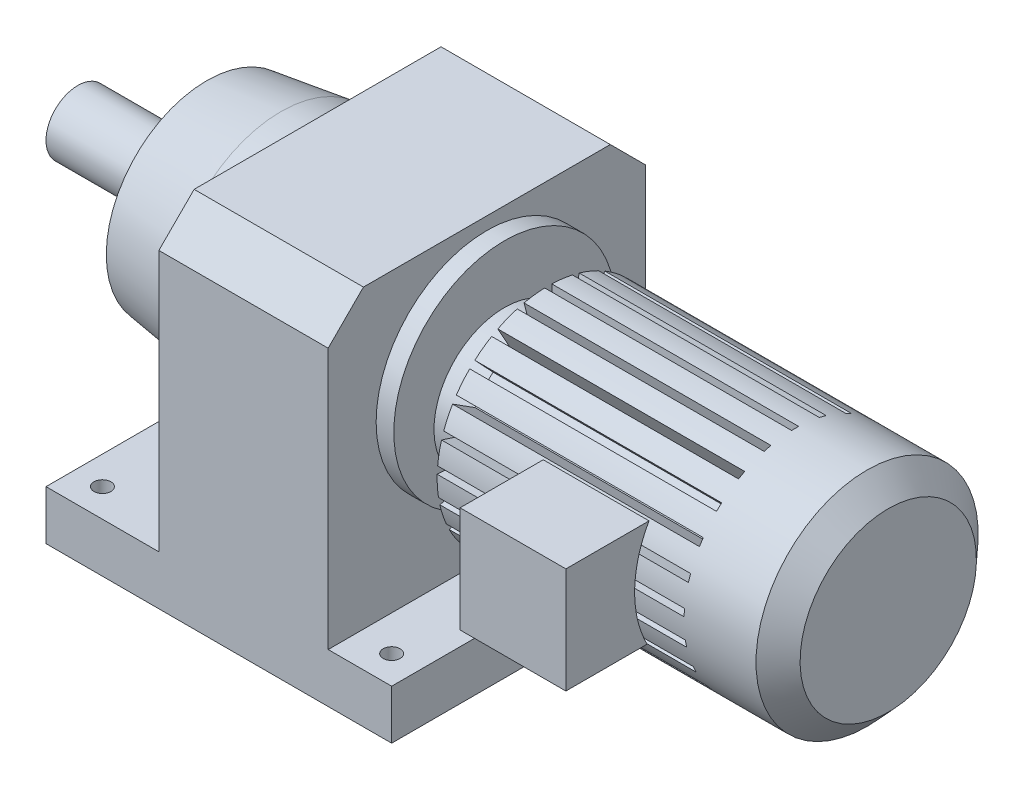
ISO-10303-21;
HEADER;
FILE_DESCRIPTION(('STEP AP214'),'2;1');
FILE_NAME('part.step','',(''),(''),'','','');
FILE_SCHEMA(('AUTOMOTIVE_DESIGN { 1 0 10303 214 1 1 1 1 }'));
ENDSEC;
DATA;
#1=APPLICATION_CONTEXT('core data for automotive mechanical design processes');
#2=APPLICATION_PROTOCOL_DEFINITION('international standard','automotive_design',2000,#1);
#3=PRODUCT_CONTEXT('',#1,'mechanical');
#4=PRODUCT('Part','Part','',(#3));
#5=PRODUCT_RELATED_PRODUCT_CATEGORY('part','',(#4));
#6=PRODUCT_DEFINITION_FORMATION('','',#4);
#7=PRODUCT_DEFINITION_CONTEXT('part definition',#1,'design');
#8=PRODUCT_DEFINITION('design','',#6,#7);
#9=PRODUCT_DEFINITION_SHAPE('','',#8);
#10=(LENGTH_UNIT() NAMED_UNIT(*) SI_UNIT(.MILLI.,.METRE.));
#11=(NAMED_UNIT(*) PLANE_ANGLE_UNIT() SI_UNIT($,.RADIAN.));
#12=(NAMED_UNIT(*) SI_UNIT($,.STERADIAN.) SOLID_ANGLE_UNIT());
#13=UNCERTAINTY_MEASURE_WITH_UNIT(LENGTH_MEASURE(1.E-05),#10,'distance_accuracy_value','');
#14=(GEOMETRIC_REPRESENTATION_CONTEXT(3) GLOBAL_UNCERTAINTY_ASSIGNED_CONTEXT((#13)) GLOBAL_UNIT_ASSIGNED_CONTEXT((#10,
#11,#12)) REPRESENTATION_CONTEXT('',''));
#15=CARTESIAN_POINT('',(0.,0.,0.));
#16=DIRECTION('',(0.,0.,1.));
#17=DIRECTION('',(1.,0.,0.));
#18=AXIS2_PLACEMENT_3D('',#15,#16,#17);
#19=CARTESIAN_POINT('',(892.78280778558,-0.959333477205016,0.));
#20=DIRECTION('',(1.,0.,0.));
#21=DIRECTION('',(0.,1.,0.));
#22=AXIS2_PLACEMENT_3D('',#19,#20,#21);
#23=CYLINDRICAL_SURFACE('',#22,157.5);
#24=CARTESIAN_POINT('',(690.78280778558,-0.959333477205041,0.));
#25=DIRECTION('',(1.,0.,0.));
#26=DIRECTION('',(0.,0.,-1.));
#27=AXIS2_PLACEMENT_3D('',#24,#25,#26);
#28=CIRCLE('',#27,157.5);
#29=CARTESIAN_POINT('',(690.78280778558,-35.3684514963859,153.69535645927));
#30=VERTEX_POINT('',#29);
#31=CARTESIAN_POINT('',(690.78280778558,-63.4616361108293,144.56732744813));
#32=VERTEX_POINT('',#31);
#33=EDGE_CURVE('E813',#30,#32,#28,.T.);
#34=ORIENTED_EDGE('',*,*,#33,.T.);
#35=DIRECTION('',(1.,0.,0.));
#36=VECTOR('',#35,1.);
#37=CARTESIAN_POINT('',(892.78280778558,-63.4616361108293,144.56732744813));
#38=LINE('',#37,#36);
#39=CARTESIAN_POINT('',(760.78280778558,-63.4616361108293,144.56732744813));
#40=VERTEX_POINT('',#39);
#41=EDGE_CURVE('E842',#32,#40,#38,.T.);
#42=ORIENTED_EDGE('',*,*,#41,.T.);
#43=CARTESIAN_POINT('',(760.78280778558,-0.959333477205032,0.));
#44=DIRECTION('',(1.,0.,0.));
#45=DIRECTION('',(0.,1.,0.));
#46=AXIS2_PLACEMENT_3D('',#43,#44,#45);
#47=CIRCLE('',#46,157.5);
#48=CARTESIAN_POINT('',(760.78280778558,-72.5099066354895,140.309534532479));
#49=VERTEX_POINT('',#48);
#50=EDGE_CURVE('E1626',#49,#40,#47,.F.);
#51=ORIENTED_EDGE('',*,*,#50,.F.);
#52=DIRECTION('',(1.,0.,0.));
#53=VECTOR('',#52,1.);
#54=CARTESIAN_POINT('',(892.78280778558,-72.5099066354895,140.309534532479));
#55=LINE('',#54,#53);
#56=CARTESIAN_POINT('',(690.78280778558,-72.5099066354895,140.309534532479));
#57=VERTEX_POINT('',#56);
#58=EDGE_CURVE('E808',#57,#49,#55,.T.);
#59=ORIENTED_EDGE('',*,*,#58,.F.);
#60=CARTESIAN_POINT('',(690.78280778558,-73.4348806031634,139.833991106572));
#61=VERTEX_POINT('',#60);
#62=EDGE_CURVE('E798',#57,#61,#28,.T.);
#63=ORIENTED_EDGE('',*,*,#62,.T.);
#64=DIRECTION('',(1.,0.,0.));
#65=VECTOR('',#64,1.);
#66=CARTESIAN_POINT('',(892.78280778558,-73.4348806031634,139.833991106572));
#67=LINE('',#66,#65);
#68=CARTESIAN_POINT('',(540.78280778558,-73.4348806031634,139.833991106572));
#69=VERTEX_POINT('',#68);
#70=EDGE_CURVE('E783',#61,#69,#67,.F.);
#71=ORIENTED_EDGE('',*,*,#70,.T.);
#72=CARTESIAN_POINT('',(540.78280778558,-0.959333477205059,0.));
#73=DIRECTION('',(-1.,0.,0.));
#74=DIRECTION('',(0.,0.,1.));
#75=AXIS2_PLACEMENT_3D('',#72,#73,#74);
#76=CIRCLE('',#75,157.5);
#77=CARTESIAN_POINT('',(540.78280778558,-72.5099066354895,140.309534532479));
#78=VERTEX_POINT('',#77);
#79=EDGE_CURVE('E1829',#69,#78,#76,.T.);
#80=ORIENTED_EDGE('',*,*,#79,.T.);
#81=CARTESIAN_POINT('',(410.78280778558,-72.5099066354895,140.309534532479));
#82=VERTEX_POINT('',#81);
#83=EDGE_CURVE('E1623',#82,#78,#55,.T.);
#84=ORIENTED_EDGE('',*,*,#83,.F.);
#85=CARTESIAN_POINT('',(410.78280778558,-0.959333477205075,0.));
#86=DIRECTION('',(1.,0.,0.));
#87=DIRECTION('',(0.,1.,0.));
#88=AXIS2_PLACEMENT_3D('',#85,#86,#87);
#89=CIRCLE('',#88,157.5);
#90=CARTESIAN_POINT('',(410.78280778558,-97.4504436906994,124.481788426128));
#91=VERTEX_POINT('',#90);
#92=EDGE_CURVE('E1858',#82,#91,#89,.T.);
#93=ORIENTED_EDGE('',*,*,#92,.T.);
#94=DIRECTION('',(1.,0.,0.));
#95=VECTOR('',#94,1.);
#96=CARTESIAN_POINT('',(892.78280778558,-97.4504436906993,124.481788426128));
#97=LINE('',#96,#95);
#98=CARTESIAN_POINT('',(760.78280778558,-97.4504436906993,124.481788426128));
#99=VERTEX_POINT('',#98);
#100=EDGE_CURVE('E1634',#91,#99,#97,.T.);
#101=ORIENTED_EDGE('',*,*,#100,.T.);
#102=CARTESIAN_POINT('',(760.78280778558,-0.959333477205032,0.));
#103=DIRECTION('',(1.,0.,0.));
#104=DIRECTION('',(0.,1.,0.));
#105=AXIS2_PLACEMENT_3D('',#102,#103,#104);
#106=CIRCLE('',#105,157.5);
#107=CARTESIAN_POINT('',(760.78280778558,-105.155576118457,118.107548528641));
#108=VERTEX_POINT('',#107);
#109=EDGE_CURVE('E1632',#108,#99,#106,.F.);
#110=ORIENTED_EDGE('',*,*,#109,.F.);
#111=DIRECTION('',(1.,0.,0.));
#112=VECTOR('',#111,1.);
#113=CARTESIAN_POINT('',(892.78280778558,-105.155576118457,118.107548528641));
#114=LINE('',#113,#112);
#115=CARTESIAN_POINT('',(410.78280778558,-105.155576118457,118.107548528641));
#116=VERTEX_POINT('',#115);
#117=EDGE_CURVE('E1630',#116,#108,#114,.T.);
#118=ORIENTED_EDGE('',*,*,#117,.F.);
#119=CARTESIAN_POINT('',(410.78280778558,-125.376359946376,96.574600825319));
#120=VERTEX_POINT('',#119);
#121=EDGE_CURVE('E1861',#116,#120,#89,.T.);
#122=ORIENTED_EDGE('',*,*,#121,.T.);
#123=DIRECTION('',(1.,0.,0.));
#124=VECTOR('',#123,1.);
#125=CARTESIAN_POINT('',(892.78280778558,-125.376359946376,96.574600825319));
#126=LINE('',#125,#124);
#127=CARTESIAN_POINT('',(760.78280778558,-125.376359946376,96.574600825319));
#128=VERTEX_POINT('',#127);
#129=EDGE_CURVE('E1641',#120,#128,#126,.T.);
#130=ORIENTED_EDGE('',*,*,#129,.T.);
#131=CARTESIAN_POINT('',(760.78280778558,-0.959333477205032,0.));
#132=DIRECTION('',(1.,0.,0.));
#133=DIRECTION('',(0.,1.,0.));
#134=AXIS2_PLACEMENT_3D('',#131,#132,#133);
#135=CIRCLE('',#134,157.5);
#136=CARTESIAN_POINT('',(760.78280778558,-131.2542124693,88.4844308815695));
#137=VERTEX_POINT('',#136);
#138=EDGE_CURVE('E1639',#137,#128,#135,.F.);
#139=ORIENTED_EDGE('',*,*,#138,.F.);
#140=DIRECTION('',(1.,0.,0.));
#141=VECTOR('',#140,1.);
#142=CARTESIAN_POINT('',(892.78280778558,-131.2542124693,88.4844308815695));
#143=LINE('',#142,#141);
#144=CARTESIAN_POINT('',(410.78280778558,-131.2542124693,88.4844308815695));
#145=VERTEX_POINT('',#144);
#146=EDGE_CURVE('E1637',#145,#137,#143,.T.);
#147=ORIENTED_EDGE('',*,*,#146,.F.);
#148=CARTESIAN_POINT('',(410.78280778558,-145.484696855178,62.5992758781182));
#149=VERTEX_POINT('',#148);
#150=EDGE_CURVE('E1865',#145,#149,#89,.T.);
#151=ORIENTED_EDGE('',*,*,#150,.T.);
#152=DIRECTION('',(1.,0.,0.));
#153=VECTOR('',#152,1.);
#154=CARTESIAN_POINT('',(892.78280778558,-145.484696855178,62.5992758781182));
#155=LINE('',#154,#153);
#156=CARTESIAN_POINT('',(760.78280778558,-145.484696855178,62.5992758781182));
#157=VERTEX_POINT('',#156);
#158=EDGE_CURVE('E1648',#149,#157,#155,.T.);
#159=ORIENTED_EDGE('',*,*,#158,.T.);
#160=CARTESIAN_POINT('',(760.78280778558,-0.959333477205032,0.));
#161=DIRECTION('',(1.,0.,0.));
#162=DIRECTION('',(0.,1.,0.));
#163=AXIS2_PLACEMENT_3D('',#160,#161,#162);
#164=CIRCLE('',#163,157.5);
#165=CARTESIAN_POINT('',(760.78280778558,-149.165942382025,53.3015110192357));
#166=VERTEX_POINT('',#165);
#167=EDGE_CURVE('E1646',#166,#157,#164,.F.);
#168=ORIENTED_EDGE('',*,*,#167,.F.);
#169=DIRECTION('',(1.,0.,0.));
#170=VECTOR('',#169,1.);
#171=CARTESIAN_POINT('',(892.78280778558,-149.165942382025,53.3015110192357));
#172=LINE('',#171,#170);
#173=CARTESIAN_POINT('',(410.78280778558,-149.165942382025,53.3015110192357));
#174=VERTEX_POINT('',#173);
#175=EDGE_CURVE('E1644',#174,#166,#172,.T.);
#176=ORIENTED_EDGE('',*,*,#175,.F.);
#177=CARTESIAN_POINT('',(410.78280778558,-156.511973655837,24.6906082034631));
#178=VERTEX_POINT('',#177);
#179=EDGE_CURVE('E1869',#174,#178,#89,.T.);
#180=ORIENTED_EDGE('',*,*,#179,.T.);
#181=DIRECTION('',(1.,0.,0.));
#182=VECTOR('',#181,1.);
#183=CARTESIAN_POINT('',(892.78280778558,-156.511973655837,24.6906082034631));
#184=LINE('',#183,#182);
#185=CARTESIAN_POINT('',(760.78280778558,-156.511973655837,24.6906082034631));
#186=VERTEX_POINT('',#185);
#187=EDGE_CURVE('E1655',#178,#186,#184,.T.);
#188=ORIENTED_EDGE('',*,*,#187,.T.);
#189=CARTESIAN_POINT('',(760.78280778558,-0.959333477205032,0.));
#190=DIRECTION('',(1.,0.,0.));
#191=DIRECTION('',(0.,1.,0.));
#192=AXIS2_PLACEMENT_3D('',#189,#190,#191);
#193=CIRCLE('',#192,157.5);
#194=CARTESIAN_POINT('',(760.78280778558,-157.76530599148,14.7694611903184));
#195=VERTEX_POINT('',#194);
#196=EDGE_CURVE('E1653',#195,#186,#193,.F.);
#197=ORIENTED_EDGE('',*,*,#196,.F.);
#198=DIRECTION('',(1.,0.,0.));
#199=VECTOR('',#198,1.);
#200=CARTESIAN_POINT('',(892.78280778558,-157.76530599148,14.7694611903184));
#201=LINE('',#200,#199);
#202=CARTESIAN_POINT('',(410.78280778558,-157.76530599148,14.7694611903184));
#203=VERTEX_POINT('',#202);
#204=EDGE_CURVE('E1651',#203,#195,#201,.T.);
#205=ORIENTED_EDGE('',*,*,#204,.F.);
#206=CARTESIAN_POINT('',(410.78280778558,-157.76530599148,-14.7694611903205));
#207=VERTEX_POINT('',#206);
#208=EDGE_CURVE('E1873',#203,#207,#89,.T.);
#209=ORIENTED_EDGE('',*,*,#208,.T.);
#210=DIRECTION('',(1.,0.,0.));
#211=VECTOR('',#210,1.);
#212=CARTESIAN_POINT('',(892.78280778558,-157.76530599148,-14.7694611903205));
#213=LINE('',#212,#211);
#214=CARTESIAN_POINT('',(760.78280778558,-157.76530599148,-14.7694611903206));
#215=VERTEX_POINT('',#214);
#216=EDGE_CURVE('E1575',#207,#215,#213,.T.);
#217=ORIENTED_EDGE('',*,*,#216,.T.);
#218=CARTESIAN_POINT('',(760.78280778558,-0.959333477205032,0.));
#219=DIRECTION('',(1.,0.,0.));
#220=DIRECTION('',(0.,1.,0.));
#221=AXIS2_PLACEMENT_3D('',#218,#219,#220);
#222=CIRCLE('',#221,157.5);
#223=CARTESIAN_POINT('',(760.78280778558,-156.511973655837,-24.6906082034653));
#224=VERTEX_POINT('',#223);
#225=EDGE_CURVE('E1573',#224,#215,#222,.F.);
#226=ORIENTED_EDGE('',*,*,#225,.F.);
#227=DIRECTION('',(1.,0.,0.));
#228=VECTOR('',#227,1.);
#229=CARTESIAN_POINT('',(892.78280778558,-156.511973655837,-24.6906082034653));
#230=LINE('',#229,#228);
#231=CARTESIAN_POINT('',(410.78280778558,-156.511973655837,-24.6906082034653));
#232=VERTEX_POINT('',#231);
#233=EDGE_CURVE('E1571',#232,#224,#230,.T.);
#234=ORIENTED_EDGE('',*,*,#233,.F.);
#235=CARTESIAN_POINT('',(410.78280778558,-149.165942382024,-53.3015110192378));
#236=VERTEX_POINT('',#235);
#237=EDGE_CURVE('E1877',#232,#236,#89,.T.);
#238=ORIENTED_EDGE('',*,*,#237,.T.);
#239=DIRECTION('',(1.,0.,0.));
#240=VECTOR('',#239,1.);
#241=CARTESIAN_POINT('',(892.78280778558,-149.165942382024,-53.3015110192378));
#242=LINE('',#241,#240);
#243=CARTESIAN_POINT('',(760.78280778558,-149.165942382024,-53.3015110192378));
#244=VERTEX_POINT('',#243);
#245=EDGE_CURVE('E1582',#236,#244,#242,.T.);
#246=ORIENTED_EDGE('',*,*,#245,.T.);
#247=CARTESIAN_POINT('',(760.78280778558,-0.959333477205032,0.));
#248=DIRECTION('',(1.,0.,0.));
#249=DIRECTION('',(0.,1.,0.));
#250=AXIS2_PLACEMENT_3D('',#247,#248,#249);
#251=CIRCLE('',#250,157.5);
#252=CARTESIAN_POINT('',(760.78280778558,-145.484696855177,-62.5992758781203));
#253=VERTEX_POINT('',#252);
#254=EDGE_CURVE('E1580',#253,#244,#251,.F.);
#255=ORIENTED_EDGE('',*,*,#254,.F.);
#256=DIRECTION('',(1.,0.,0.));
#257=VECTOR('',#256,1.);
#258=CARTESIAN_POINT('',(892.78280778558,-145.484696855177,-62.5992758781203));
#259=LINE('',#258,#257);
#260=CARTESIAN_POINT('',(410.78280778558,-145.484696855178,-62.5992758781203));
#261=VERTEX_POINT('',#260);
#262=EDGE_CURVE('E1578',#261,#253,#259,.T.);
#263=ORIENTED_EDGE('',*,*,#262,.F.);
#264=CARTESIAN_POINT('',(410.78280778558,-131.254212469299,-88.4844308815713));
#265=VERTEX_POINT('',#264);
#266=EDGE_CURVE('E1881',#261,#265,#89,.T.);
#267=ORIENTED_EDGE('',*,*,#266,.T.);
#268=DIRECTION('',(1.,0.,0.));
#269=VECTOR('',#268,1.);
#270=CARTESIAN_POINT('',(892.78280778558,-131.254212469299,-88.4844308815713));
#271=LINE('',#270,#269);
#272=CARTESIAN_POINT('',(760.78280778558,-131.254212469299,-88.4844308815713));
#273=VERTEX_POINT('',#272);
#274=EDGE_CURVE('E1589',#265,#273,#271,.T.);
#275=ORIENTED_EDGE('',*,*,#274,.T.);
#276=CARTESIAN_POINT('',(760.78280778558,-0.959333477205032,0.));
#277=DIRECTION('',(1.,0.,0.));
#278=DIRECTION('',(0.,1.,0.));
#279=AXIS2_PLACEMENT_3D('',#276,#277,#278);
#280=CIRCLE('',#279,157.5);
#281=CARTESIAN_POINT('',(760.78280778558,-125.376359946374,-96.5746008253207));
#282=VERTEX_POINT('',#281);
#283=EDGE_CURVE('E1587',#282,#273,#280,.F.);
#284=ORIENTED_EDGE('',*,*,#283,.F.);
#285=DIRECTION('',(1.,0.,0.));
#286=VECTOR('',#285,1.);
#287=CARTESIAN_POINT('',(892.78280778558,-125.376359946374,-96.5746008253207));
#288=LINE('',#287,#286);
#289=CARTESIAN_POINT('',(410.78280778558,-125.376359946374,-96.5746008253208));
#290=VERTEX_POINT('',#289);
#291=EDGE_CURVE('E1585',#290,#282,#288,.T.);
#292=ORIENTED_EDGE('',*,*,#291,.F.);
#293=CARTESIAN_POINT('',(410.78280778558,-105.155576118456,-118.107548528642));
#294=VERTEX_POINT('',#293);
#295=EDGE_CURVE('E1885',#290,#294,#89,.T.);
#296=ORIENTED_EDGE('',*,*,#295,.T.);
#297=DIRECTION('',(1.,0.,0.));
#298=VECTOR('',#297,1.);
#299=CARTESIAN_POINT('',(892.78280778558,-105.155576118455,-118.107548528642));
#300=LINE('',#299,#298);
#301=CARTESIAN_POINT('',(760.78280778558,-105.155576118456,-118.107548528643));
#302=VERTEX_POINT('',#301);
#303=EDGE_CURVE('E1596',#294,#302,#300,.T.);
#304=ORIENTED_EDGE('',*,*,#303,.T.);
#305=CARTESIAN_POINT('',(760.78280778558,-0.959333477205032,0.));
#306=DIRECTION('',(1.,0.,0.));
#307=DIRECTION('',(0.,1.,0.));
#308=AXIS2_PLACEMENT_3D('',#305,#306,#307);
#309=CIRCLE('',#308,157.5);
#310=CARTESIAN_POINT('',(760.78280778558,-97.4504436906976,-124.481788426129));
#311=VERTEX_POINT('',#310);
#312=EDGE_CURVE('E1594',#311,#302,#309,.F.);
#313=ORIENTED_EDGE('',*,*,#312,.F.);
#314=DIRECTION('',(1.,0.,0.));
#315=VECTOR('',#314,1.);
#316=CARTESIAN_POINT('',(892.78280778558,-97.4504436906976,-124.481788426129));
#317=LINE('',#316,#315);
#318=CARTESIAN_POINT('',(410.78280778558,-97.4504436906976,-124.481788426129));
#319=VERTEX_POINT('',#318);
#320=EDGE_CURVE('E1592',#319,#311,#317,.T.);
#321=ORIENTED_EDGE('',*,*,#320,.F.);
#322=CARTESIAN_POINT('',(410.78280778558,-72.5099066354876,-140.30953453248));
#323=VERTEX_POINT('',#322);
#324=EDGE_CURVE('E1889',#319,#323,#89,.T.);
#325=ORIENTED_EDGE('',*,*,#324,.T.);
#326=DIRECTION('',(1.,0.,0.));
#327=VECTOR('',#326,1.);
#328=CARTESIAN_POINT('',(892.78280778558,-72.5099066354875,-140.30953453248));
#329=LINE('',#328,#327);
#330=CARTESIAN_POINT('',(760.78280778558,-72.5099066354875,-140.30953453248));
#331=VERTEX_POINT('',#330);
#332=EDGE_CURVE('E1603',#323,#331,#329,.T.);
#333=ORIENTED_EDGE('',*,*,#332,.T.);
#334=CARTESIAN_POINT('',(760.78280778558,-0.959333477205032,0.));
#335=DIRECTION('',(1.,0.,0.));
#336=DIRECTION('',(0.,1.,0.));
#337=AXIS2_PLACEMENT_3D('',#334,#335,#336);
#338=CIRCLE('',#337,157.5);
#339=CARTESIAN_POINT('',(760.78280778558,-63.4616361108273,-144.567327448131));
#340=VERTEX_POINT('',#339);
#341=EDGE_CURVE('E1601',#340,#331,#338,.F.);
#342=ORIENTED_EDGE('',*,*,#341,.F.);
#343=DIRECTION('',(1.,0.,0.));
#344=VECTOR('',#343,1.);
#345=CARTESIAN_POINT('',(892.78280778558,-63.4616361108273,-144.567327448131));
#346=LINE('',#345,#344);
#347=CARTESIAN_POINT('',(410.78280778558,-63.4616361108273,-144.567327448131));
#348=VERTEX_POINT('',#347);
#349=EDGE_CURVE('E1599',#348,#340,#346,.T.);
#350=ORIENTED_EDGE('',*,*,#349,.F.);
#351=CARTESIAN_POINT('',(410.78280778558,-35.3684514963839,-153.69535645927));
#352=VERTEX_POINT('',#351);
#353=EDGE_CURVE('E1893',#348,#352,#89,.T.);
#354=ORIENTED_EDGE('',*,*,#353,.T.);
#355=DIRECTION('',(1.,0.,0.));
#356=VECTOR('',#355,1.);
#357=CARTESIAN_POINT('',(892.78280778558,-35.3684514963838,-153.69535645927));
#358=LINE('',#357,#356);
#359=CARTESIAN_POINT('',(760.78280778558,-35.3684514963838,-153.69535645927));
#360=VERTEX_POINT('',#359);
#361=EDGE_CURVE('E1610',#352,#360,#358,.T.);
#362=ORIENTED_EDGE('',*,*,#361,.T.);
#363=CARTESIAN_POINT('',(760.78280778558,-0.959333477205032,0.));
#364=DIRECTION('',(1.,0.,0.));
#365=DIRECTION('',(0.,1.,0.));
#366=AXIS2_PLACEMENT_3D('',#363,#364,#365);
#367=CIRCLE('',#366,157.5);
#368=CARTESIAN_POINT('',(760.78280778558,-25.5455789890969,-155.569169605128));
#369=VERTEX_POINT('',#368);
#370=EDGE_CURVE('E1608',#369,#360,#367,.F.);
#371=ORIENTED_EDGE('',*,*,#370,.F.);
#372=DIRECTION('',(1.,0.,0.));
#373=VECTOR('',#372,1.);
#374=CARTESIAN_POINT('',(892.78280778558,-25.5455789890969,-155.569169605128));
#375=LINE('',#374,#373);
#376=CARTESIAN_POINT('',(410.78280778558,-25.5455789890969,-155.569169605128));
#377=VERTEX_POINT('',#376);
#378=EDGE_CURVE('E1606',#377,#369,#375,.T.);
#379=ORIENTED_EDGE('',*,*,#378,.F.);
#380=CARTESIAN_POINT('',(410.78280778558,3.93505507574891,-157.423933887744));
#381=VERTEX_POINT('',#380);
#382=EDGE_CURVE('E1897',#377,#381,#89,.T.);
#383=ORIENTED_EDGE('',*,*,#382,.T.);
#384=DIRECTION('',(1.,0.,0.));
#385=VECTOR('',#384,1.);
#386=CARTESIAN_POINT('',(892.78280778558,3.93505507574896,-157.423933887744));
#387=LINE('',#386,#385);
#388=CARTESIAN_POINT('',(760.78280778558,3.93505507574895,-157.423933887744));
#389=VERTEX_POINT('',#388);
#390=EDGE_CURVE('E1533',#381,#389,#387,.T.);
#391=ORIENTED_EDGE('',*,*,#390,.T.);
#392=CARTESIAN_POINT('',(760.78280778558,-0.959333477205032,0.));
#393=DIRECTION('',(1.,0.,0.));
#394=DIRECTION('',(0.,0.,-1.));
#395=AXIS2_PLACEMENT_3D('',#392,#393,#394);
#396=CIRCLE('',#395,157.5);
#397=CARTESIAN_POINT('',(760.78280778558,13.9153223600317,-156.79602869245));
#398=VERTEX_POINT('',#397);
#399=EDGE_CURVE('E1531',#398,#389,#396,.F.);
#400=ORIENTED_EDGE('',*,*,#399,.F.);
#401=DIRECTION('',(1.,0.,0.));
#402=VECTOR('',#401,1.);
#403=CARTESIAN_POINT('',(892.78280778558,13.9153223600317,-156.79602869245));
#404=LINE('',#403,#402);
#405=CARTESIAN_POINT('',(410.78280778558,13.9153223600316,-156.79602869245));
#406=VERTEX_POINT('',#405);
#407=EDGE_CURVE('E1529',#406,#398,#404,.T.);
#408=ORIENTED_EDGE('',*,*,#407,.F.);
#409=CARTESIAN_POINT('',(410.78280778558,42.9310292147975,-151.26098658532));
#410=VERTEX_POINT('',#409);
#411=EDGE_CURVE('E1901',#406,#410,#89,.T.);
#412=ORIENTED_EDGE('',*,*,#411,.T.);
#413=DIRECTION('',(1.,0.,0.));
#414=VECTOR('',#413,1.);
#415=CARTESIAN_POINT('',(892.78280778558,42.9310292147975,-151.26098658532));
#416=LINE('',#415,#414);
#417=CARTESIAN_POINT('',(760.78280778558,42.9310292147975,-151.26098658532));
#418=VERTEX_POINT('',#417);
#419=EDGE_CURVE('E1540',#410,#418,#416,.T.);
#420=ORIENTED_EDGE('',*,*,#419,.T.);
#421=CARTESIAN_POINT('',(760.78280778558,-0.959333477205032,0.));
#422=DIRECTION('',(1.,0.,0.));
#423=DIRECTION('',(0.,0.,-1.));
#424=AXIS2_PLACEMENT_3D('',#421,#422,#423);
#425=CIRCLE('',#424,157.5);
#426=CARTESIAN_POINT('',(760.78280778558,52.441594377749,-148.170816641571));
#427=VERTEX_POINT('',#426);
#428=EDGE_CURVE('E1538',#427,#418,#425,.F.);
#429=ORIENTED_EDGE('',*,*,#428,.F.);
#430=DIRECTION('',(1.,0.,0.));
#431=VECTOR('',#430,1.);
#432=CARTESIAN_POINT('',(892.78280778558,52.441594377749,-148.170816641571));
#433=LINE('',#432,#431);
#434=CARTESIAN_POINT('',(410.78280778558,52.441594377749,-148.170816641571));
#435=VERTEX_POINT('',#434);
#436=EDGE_CURVE('E1536',#435,#427,#433,.T.);
#437=ORIENTED_EDGE('',*,*,#436,.F.);
#438=CARTESIAN_POINT('',(410.78280778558,79.1692104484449,-135.593755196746));
#439=VERTEX_POINT('',#438);
#440=EDGE_CURVE('E1905',#435,#439,#89,.T.);
#441=ORIENTED_EDGE('',*,*,#440,.T.);
#442=DIRECTION('',(1.,0.,0.));
#443=VECTOR('',#442,1.);
#444=CARTESIAN_POINT('',(892.78280778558,79.1692104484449,-135.593755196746));
#445=LINE('',#444,#443);
#446=CARTESIAN_POINT('',(760.78280778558,79.1692104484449,-135.593755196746));
#447=VERTEX_POINT('',#446);
#448=EDGE_CURVE('E1547',#439,#447,#445,.T.);
#449=ORIENTED_EDGE('',*,*,#448,.T.);
#450=CARTESIAN_POINT('',(760.78280778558,-0.959333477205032,0.));
#451=DIRECTION('',(1.,0.,0.));
#452=DIRECTION('',(0.,0.,-1.));
#453=AXIS2_PLACEMENT_3D('',#450,#451,#452);
#454=CIRCLE('',#453,157.5);
#455=CARTESIAN_POINT('',(760.78280778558,87.612489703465,-130.235487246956));
#456=VERTEX_POINT('',#455);
#457=EDGE_CURVE('E1545',#456,#447,#454,.F.);
#458=ORIENTED_EDGE('',*,*,#457,.F.);
#459=DIRECTION('',(1.,0.,0.));
#460=VECTOR('',#459,1.);
#461=CARTESIAN_POINT('',(892.78280778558,87.612489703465,-130.235487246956));
#462=LINE('',#461,#460);
#463=CARTESIAN_POINT('',(410.78280778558,87.612489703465,-130.235487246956));
#464=VERTEX_POINT('',#463);
#465=EDGE_CURVE('E1543',#464,#456,#462,.T.);
#466=ORIENTED_EDGE('',*,*,#465,.F.);
#467=CARTESIAN_POINT('',(410.78280778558,110.372620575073,-111.406669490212));
#468=VERTEX_POINT('',#467);
#469=EDGE_CURVE('E1909',#464,#468,#89,.T.);
#470=ORIENTED_EDGE('',*,*,#469,.T.);
#471=DIRECTION('',(1.,0.,0.));
#472=VECTOR('',#471,1.);
#473=CARTESIAN_POINT('',(892.78280778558,110.372620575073,-111.406669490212));
#474=LINE('',#473,#472);
#475=CARTESIAN_POINT('',(760.78280778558,110.372620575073,-111.406669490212));
#476=VERTEX_POINT('',#475);
#477=EDGE_CURVE('E1568',#468,#476,#474,.T.);
#478=ORIENTED_EDGE('',*,*,#477,.T.);
#479=CARTESIAN_POINT('',(760.78280778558,-0.959333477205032,0.));
#480=DIRECTION('',(1.,0.,0.));
#481=DIRECTION('',(0.,0.,-1.));
#482=AXIS2_PLACEMENT_3D('',#479,#480,#481);
#483=CIRCLE('',#482,157.5);
#484=CARTESIAN_POINT('',(760.78280778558,117.21809163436,-104.116983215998));
#485=VERTEX_POINT('',#484);
#486=EDGE_CURVE('E1566',#485,#476,#483,.F.);
#487=ORIENTED_EDGE('',*,*,#486,.F.);
#488=DIRECTION('',(1.,0.,0.));
#489=VECTOR('',#488,1.);
#490=CARTESIAN_POINT('',(892.78280778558,117.21809163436,-104.116983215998));
#491=LINE('',#490,#489);
#492=CARTESIAN_POINT('',(410.78280778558,117.21809163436,-104.116983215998));
#493=VERTEX_POINT('',#492);
#494=EDGE_CURVE('E1564',#493,#485,#491,.T.);
#495=ORIENTED_EDGE('',*,*,#494,.F.);
#496=CARTESIAN_POINT('',(410.78280778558,134.580634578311,-80.2194930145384));
#497=VERTEX_POINT('',#496);
#498=EDGE_CURVE('E1913',#493,#497,#89,.T.);
#499=ORIENTED_EDGE('',*,*,#498,.T.);
#500=DIRECTION('',(1.,0.,0.));
#501=VECTOR('',#500,1.);
#502=CARTESIAN_POINT('',(892.78280778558,134.580634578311,-80.2194930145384));
#503=LINE('',#502,#501);
#504=CARTESIAN_POINT('',(760.78280778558,134.580634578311,-80.2194930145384));
#505=VERTEX_POINT('',#504);
#506=EDGE_CURVE('E1561',#497,#505,#503,.T.);
#507=ORIENTED_EDGE('',*,*,#506,.T.);
#508=CARTESIAN_POINT('',(760.78280778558,-0.959333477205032,0.));
#509=DIRECTION('',(1.,0.,0.));
#510=DIRECTION('',(0.,0.,-1.));
#511=AXIS2_PLACEMENT_3D('',#508,#509,#510);
#512=CIRCLE('',#511,157.5);
#513=CARTESIAN_POINT('',(760.78280778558,139.398171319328,-71.4564262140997));
#514=VERTEX_POINT('',#513);
#515=EDGE_CURVE('E1559',#514,#505,#512,.F.);
#516=ORIENTED_EDGE('',*,*,#515,.F.);
#517=DIRECTION('',(1.,0.,0.));
#518=VECTOR('',#517,1.);
#519=CARTESIAN_POINT('',(892.78280778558,139.398171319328,-71.4564262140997));
#520=LINE('',#519,#518);
#521=CARTESIAN_POINT('',(410.78280778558,139.398171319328,-71.4564262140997));
#522=VERTEX_POINT('',#521);
#523=EDGE_CURVE('E1557',#522,#514,#520,.T.);
#524=ORIENTED_EDGE('',*,*,#523,.F.);
#525=CARTESIAN_POINT('',(410.78280778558,150.272173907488,-43.9918307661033));
#526=VERTEX_POINT('',#525);
#527=EDGE_CURVE('E1917',#522,#526,#89,.T.);
#528=ORIENTED_EDGE('',*,*,#527,.T.);
#529=DIRECTION('',(1.,0.,0.));
#530=VECTOR('',#529,1.);
#531=CARTESIAN_POINT('',(892.78280778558,150.272173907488,-43.9918307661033));
#532=LINE('',#531,#530);
#533=CARTESIAN_POINT('',(760.78280778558,150.272173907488,-43.9918307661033));
#534=VERTEX_POINT('',#533);
#535=EDGE_CURVE('E1554',#526,#534,#532,.T.);
#536=ORIENTED_EDGE('',*,*,#535,.T.);
#537=CARTESIAN_POINT('',(760.78280778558,-0.959333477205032,0.));
#538=DIRECTION('',(1.,0.,0.));
#539=DIRECTION('',(0.,0.,-1.));
#540=AXIS2_PLACEMENT_3D('',#537,#538,#539);
#541=CIRCLE('',#540,157.5);
#542=CARTESIAN_POINT('',(760.78280778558,152.759072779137,-34.3059991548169));
#543=VERTEX_POINT('',#542);
#544=EDGE_CURVE('E1552',#543,#534,#541,.F.);
#545=ORIENTED_EDGE('',*,*,#544,.F.);
#546=DIRECTION('',(1.,0.,0.));
#547=VECTOR('',#546,1.);
#548=CARTESIAN_POINT('',(892.78280778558,152.759072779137,-34.305999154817));
#549=LINE('',#548,#547);
#550=CARTESIAN_POINT('',(410.78280778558,152.759072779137,-34.305999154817));
#551=VERTEX_POINT('',#550);
#552=EDGE_CURVE('E1550',#551,#543,#549,.T.);
#553=ORIENTED_EDGE('',*,*,#552,.F.);
#554=CARTESIAN_POINT('',(410.78280778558,156.461281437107,-5.));
#555=VERTEX_POINT('',#554);
#556=EDGE_CURVE('E1479',#551,#555,#89,.T.);
#557=ORIENTED_EDGE('',*,*,#556,.T.);
#558=DIRECTION('',(1.,0.,0.));
#559=VECTOR('',#558,1.);
#560=CARTESIAN_POINT('',(892.78280778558,156.461281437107,-5.));
#561=LINE('',#560,#559);
#562=CARTESIAN_POINT('',(760.78280778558,156.461281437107,-5.));
#563=VERTEX_POINT('',#562);
#564=EDGE_CURVE('E1519',#555,#563,#561,.T.);
#565=ORIENTED_EDGE('',*,*,#564,.T.);
#566=CARTESIAN_POINT('',(760.78280778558,-0.959333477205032,0.));
#567=DIRECTION('',(1.,0.,0.));
#568=DIRECTION('',(0.,0.,-1.));
#569=AXIS2_PLACEMENT_3D('',#566,#567,#568);
#570=CIRCLE('',#569,157.5);
#571=CARTESIAN_POINT('',(760.78280778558,156.461281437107,5.));
#572=VERTEX_POINT('',#571);
#573=EDGE_CURVE('E1517',#572,#563,#570,.F.);
#574=ORIENTED_EDGE('',*,*,#573,.F.);
#575=DIRECTION('',(1.,0.,0.));
#576=VECTOR('',#575,1.);
#577=CARTESIAN_POINT('',(892.78280778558,156.461281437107,5.));
#578=LINE('',#577,#576);
#579=CARTESIAN_POINT('',(410.78280778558,156.461281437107,5.));
#580=VERTEX_POINT('',#579);
#581=EDGE_CURVE('E1511',#580,#572,#578,.T.);
#582=ORIENTED_EDGE('',*,*,#581,.F.);
#583=CARTESIAN_POINT('',(410.78280778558,152.759072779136,34.3059991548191));
#584=VERTEX_POINT('',#583);
#585=EDGE_CURVE('E1480',#580,#584,#89,.T.);
#586=ORIENTED_EDGE('',*,*,#585,.T.);
#587=DIRECTION('',(1.,0.,0.));
#588=VECTOR('',#587,1.);
#589=CARTESIAN_POINT('',(892.78280778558,152.759072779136,34.3059991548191));
#590=LINE('',#589,#588);
#591=CARTESIAN_POINT('',(760.78280778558,152.759072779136,34.3059991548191));
#592=VERTEX_POINT('',#591);
#593=EDGE_CURVE('E1526',#584,#592,#590,.T.);
#594=ORIENTED_EDGE('',*,*,#593,.T.);
#595=CARTESIAN_POINT('',(760.78280778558,-0.959333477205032,0.));
#596=DIRECTION('',(1.,0.,0.));
#597=DIRECTION('',(0.,0.,-1.));
#598=AXIS2_PLACEMENT_3D('',#595,#596,#597);
#599=CIRCLE('',#598,157.5);
#600=CARTESIAN_POINT('',(760.78280778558,150.272173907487,43.9918307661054));
#601=VERTEX_POINT('',#600);
#602=EDGE_CURVE('E1524',#601,#592,#599,.F.);
#603=ORIENTED_EDGE('',*,*,#602,.F.);
#604=DIRECTION('',(1.,0.,0.));
#605=VECTOR('',#604,1.);
#606=CARTESIAN_POINT('',(892.78280778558,150.272173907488,43.9918307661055));
#607=LINE('',#606,#605);
#608=CARTESIAN_POINT('',(410.78280778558,150.272173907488,43.9918307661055));
#609=VERTEX_POINT('',#608);
#610=EDGE_CURVE('E1522',#609,#601,#607,.T.);
#611=ORIENTED_EDGE('',*,*,#610,.F.);
#612=CARTESIAN_POINT('',(410.78280778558,139.398171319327,71.4564262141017));
#613=VERTEX_POINT('',#612);
#614=EDGE_CURVE('E1484',#609,#613,#89,.T.);
#615=ORIENTED_EDGE('',*,*,#614,.T.);
#616=DIRECTION('',(1.,0.,0.));
#617=VECTOR('',#616,1.);
#618=CARTESIAN_POINT('',(892.78280778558,139.398171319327,71.4564262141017));
#619=LINE('',#618,#617);
#620=CARTESIAN_POINT('',(760.78280778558,139.398171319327,71.4564262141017));
#621=VERTEX_POINT('',#620);
#622=EDGE_CURVE('E1669',#613,#621,#619,.T.);
#623=ORIENTED_EDGE('',*,*,#622,.T.);
#624=CARTESIAN_POINT('',(760.78280778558,-0.959333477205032,0.));
#625=DIRECTION('',(1.,0.,0.));
#626=DIRECTION('',(0.,0.,-1.));
#627=AXIS2_PLACEMENT_3D('',#624,#625,#626);
#628=CIRCLE('',#627,157.5);
#629=CARTESIAN_POINT('',(760.78280778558,134.58063457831,80.2194930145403));
#630=VERTEX_POINT('',#629);
#631=EDGE_CURVE('E1667',#630,#621,#628,.F.);
#632=ORIENTED_EDGE('',*,*,#631,.F.);
#633=DIRECTION('',(1.,0.,0.));
#634=VECTOR('',#633,1.);
#635=CARTESIAN_POINT('',(892.78280778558,134.58063457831,80.2194930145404));
#636=LINE('',#635,#634);
#637=CARTESIAN_POINT('',(410.78280778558,134.58063457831,80.2194930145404));
#638=VERTEX_POINT('',#637);
#639=EDGE_CURVE('E1665',#638,#630,#636,.T.);
#640=ORIENTED_EDGE('',*,*,#639,.F.);
#641=CARTESIAN_POINT('',(410.78280778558,117.218091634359,104.116983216));
#642=VERTEX_POINT('',#641);
#643=EDGE_CURVE('E1963',#638,#642,#89,.T.);
#644=ORIENTED_EDGE('',*,*,#643,.T.);
#645=DIRECTION('',(1.,0.,0.));
#646=VECTOR('',#645,1.);
#647=CARTESIAN_POINT('',(892.78280778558,117.218091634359,104.116983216));
#648=LINE('',#647,#646);
#649=CARTESIAN_POINT('',(760.78280778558,117.218091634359,104.116983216));
#650=VERTEX_POINT('',#649);
#651=EDGE_CURVE('E1662',#642,#650,#648,.T.);
#652=ORIENTED_EDGE('',*,*,#651,.T.);
#653=CARTESIAN_POINT('',(760.78280778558,-0.959333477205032,0.));
#654=DIRECTION('',(1.,0.,0.));
#655=DIRECTION('',(0.,0.,-1.));
#656=AXIS2_PLACEMENT_3D('',#653,#654,#655);
#657=CIRCLE('',#656,157.5);
#658=CARTESIAN_POINT('',(760.78280778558,110.372620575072,111.406669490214));
#659=VERTEX_POINT('',#658);
#660=EDGE_CURVE('E1660',#659,#650,#657,.F.);
#661=ORIENTED_EDGE('',*,*,#660,.F.);
#662=DIRECTION('',(1.,0.,0.));
#663=VECTOR('',#662,1.);
#664=CARTESIAN_POINT('',(892.78280778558,110.372620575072,111.406669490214));
#665=LINE('',#664,#663);
#666=CARTESIAN_POINT('',(410.78280778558,110.372620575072,111.406669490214));
#667=VERTEX_POINT('',#666);
#668=EDGE_CURVE('E1658',#667,#659,#665,.T.);
#669=ORIENTED_EDGE('',*,*,#668,.F.);
#670=CARTESIAN_POINT('',(410.78280778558,87.6124897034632,130.235487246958));
#671=VERTEX_POINT('',#670);
#672=EDGE_CURVE('E1965',#667,#671,#89,.T.);
#673=ORIENTED_EDGE('',*,*,#672,.T.);
#674=DIRECTION('',(1.,0.,0.));
#675=VECTOR('',#674,1.);
#676=CARTESIAN_POINT('',(892.78280778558,87.6124897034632,130.235487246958));
#677=LINE('',#676,#675);
#678=CARTESIAN_POINT('',(760.78280778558,87.6124897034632,130.235487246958));
#679=VERTEX_POINT('',#678);
#680=EDGE_CURVE('E1676',#671,#679,#677,.T.);
#681=ORIENTED_EDGE('',*,*,#680,.T.);
#682=CARTESIAN_POINT('',(760.78280778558,-0.959333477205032,0.));
#683=DIRECTION('',(1.,0.,0.));
#684=DIRECTION('',(0.,0.,-1.));
#685=AXIS2_PLACEMENT_3D('',#682,#683,#684);
#686=CIRCLE('',#685,157.5);
#687=CARTESIAN_POINT('',(760.78280778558,79.169210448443,135.593755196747));
#688=VERTEX_POINT('',#687);
#689=EDGE_CURVE('E1674',#688,#679,#686,.F.);
#690=ORIENTED_EDGE('',*,*,#689,.F.);
#691=DIRECTION('',(1.,0.,0.));
#692=VECTOR('',#691,1.);
#693=CARTESIAN_POINT('',(892.78280778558,79.169210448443,135.593755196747));
#694=LINE('',#693,#692);
#695=CARTESIAN_POINT('',(410.78280778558,79.169210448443,135.593755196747));
#696=VERTEX_POINT('',#695);
#697=EDGE_CURVE('E1672',#696,#688,#694,.T.);
#698=ORIENTED_EDGE('',*,*,#697,.F.);
#699=CARTESIAN_POINT('',(410.78280778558,52.4415943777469,148.170816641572));
#700=VERTEX_POINT('',#699);
#701=EDGE_CURVE('E1969',#696,#700,#89,.T.);
#702=ORIENTED_EDGE('',*,*,#701,.T.);
#703=DIRECTION('',(1.,0.,0.));
#704=VECTOR('',#703,1.);
#705=CARTESIAN_POINT('',(892.78280778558,52.4415943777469,148.170816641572));
#706=LINE('',#705,#704);
#707=CARTESIAN_POINT('',(540.78280778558,52.4415943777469,148.170816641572));
#708=VERTEX_POINT('',#707);
#709=EDGE_CURVE('E1687',#700,#708,#706,.T.);
#710=ORIENTED_EDGE('',*,*,#709,.T.);
#711=CARTESIAN_POINT('',(540.78280778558,76.5651193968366,137.099267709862));
#712=VERTEX_POINT('',#711);
#713=EDGE_CURVE('E53',#708,#712,#76,.T.);
#714=ORIENTED_EDGE('',*,*,#713,.T.);
#715=DIRECTION('',(1.,0.,0.));
#716=VECTOR('',#715,1.);
#717=CARTESIAN_POINT('',(892.78280778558,76.5651193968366,137.099267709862));
#718=LINE('',#717,#716);
#719=CARTESIAN_POINT('',(690.78280778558,76.5651193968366,137.099267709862));
#720=VERTEX_POINT('',#719);
#721=EDGE_CURVE('E48',#712,#720,#718,.T.);
#722=ORIENTED_EDGE('',*,*,#721,.T.);
#723=CARTESIAN_POINT('',(690.78280778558,52.4415943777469,148.170816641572));
#724=VERTEX_POINT('',#723);
#725=EDGE_CURVE('E792',#720,#724,#28,.T.);
#726=ORIENTED_EDGE('',*,*,#725,.T.);
#727=CARTESIAN_POINT('',(760.78280778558,52.4415943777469,148.170816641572));
#728=VERTEX_POINT('',#727);
#729=EDGE_CURVE('E1686',#724,#728,#706,.T.);
#730=ORIENTED_EDGE('',*,*,#729,.T.);
#731=CARTESIAN_POINT('',(760.78280778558,-0.959333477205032,0.));
#732=DIRECTION('',(1.,0.,0.));
#733=DIRECTION('',(0.,0.,-1.));
#734=AXIS2_PLACEMENT_3D('',#731,#732,#733);
#735=CIRCLE('',#734,157.5);
#736=CARTESIAN_POINT('',(760.78280778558,42.9310292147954,151.260986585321));
#737=VERTEX_POINT('',#736);
#738=EDGE_CURVE('E1683',#737,#728,#735,.F.);
#739=ORIENTED_EDGE('',*,*,#738,.F.);
#740=DIRECTION('',(1.,0.,0.));
#741=VECTOR('',#740,1.);
#742=CARTESIAN_POINT('',(892.78280778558,42.9310292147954,151.260986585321));
#743=LINE('',#742,#741);
#744=CARTESIAN_POINT('',(690.78280778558,42.9310292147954,151.260986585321));
#745=VERTEX_POINT('',#744);
#746=EDGE_CURVE('E1679',#745,#737,#743,.T.);
#747=ORIENTED_EDGE('',*,*,#746,.F.);
#748=CARTESIAN_POINT('',(690.78280778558,13.9153223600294,156.796028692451));
#749=VERTEX_POINT('',#748);
#750=EDGE_CURVE('E820',#745,#749,#28,.T.);
#751=ORIENTED_EDGE('',*,*,#750,.T.);
#752=DIRECTION('',(1.,0.,0.));
#753=VECTOR('',#752,1.);
#754=CARTESIAN_POINT('',(892.78280778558,13.9153223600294,156.796028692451));
#755=LINE('',#754,#753);
#756=CARTESIAN_POINT('',(760.78280778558,13.9153223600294,156.796028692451));
#757=VERTEX_POINT('',#756);
#758=EDGE_CURVE('E1697',#749,#757,#755,.T.);
#759=ORIENTED_EDGE('',*,*,#758,.T.);
#760=CARTESIAN_POINT('',(760.78280778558,-0.959333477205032,0.));
#761=DIRECTION('',(1.,0.,0.));
#762=DIRECTION('',(0.,0.,-1.));
#763=AXIS2_PLACEMENT_3D('',#760,#761,#762);
#764=CIRCLE('',#763,157.5);
#765=CARTESIAN_POINT('',(760.78280778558,3.93505507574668,157.423933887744));
#766=VERTEX_POINT('',#765);
#767=EDGE_CURVE('E1693',#766,#757,#764,.F.);
#768=ORIENTED_EDGE('',*,*,#767,.F.);
#769=DIRECTION('',(1.,0.,0.));
#770=VECTOR('',#769,1.);
#771=CARTESIAN_POINT('',(892.78280778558,3.93505507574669,157.423933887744));
#772=LINE('',#771,#770);
#773=CARTESIAN_POINT('',(690.78280778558,3.93505507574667,157.423933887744));
#774=VERTEX_POINT('',#773);
#775=EDGE_CURVE('E1689',#774,#766,#772,.T.);
#776=ORIENTED_EDGE('',*,*,#775,.F.);
#777=CARTESIAN_POINT('',(690.78280778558,-25.5455789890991,155.569169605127));
#778=VERTEX_POINT('',#777);
#779=EDGE_CURVE('E828',#774,#778,#28,.T.);
#780=ORIENTED_EDGE('',*,*,#779,.T.);
#781=DIRECTION('',(1.,0.,0.));
#782=VECTOR('',#781,1.);
#783=CARTESIAN_POINT('',(892.78280778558,-25.545578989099,155.569169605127));
#784=LINE('',#783,#782);
#785=CARTESIAN_POINT('',(760.78280778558,-25.545578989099,155.569169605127));
#786=VERTEX_POINT('',#785);
#787=EDGE_CURVE('E1619',#778,#786,#784,.T.);
#788=ORIENTED_EDGE('',*,*,#787,.T.);
#789=CARTESIAN_POINT('',(760.78280778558,-0.959333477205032,0.));
#790=DIRECTION('',(1.,0.,0.));
#791=DIRECTION('',(0.,1.,0.));
#792=AXIS2_PLACEMENT_3D('',#789,#790,#791);
#793=CIRCLE('',#792,157.5);
#794=CARTESIAN_POINT('',(760.78280778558,-35.3684514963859,153.69535645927));
#795=VERTEX_POINT('',#794);
#796=EDGE_CURVE('E1616',#795,#786,#793,.F.);
#797=ORIENTED_EDGE('',*,*,#796,.F.);
#798=DIRECTION('',(1.,0.,0.));
#799=VECTOR('',#798,1.);
#800=CARTESIAN_POINT('',(892.78280778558,-35.3684514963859,153.69535645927));
#801=LINE('',#800,#799);
#802=EDGE_CURVE('E845',#30,#795,#801,.T.);
#803=ORIENTED_EDGE('',*,*,#802,.F.);
#804=EDGE_LOOP('',(#34,#42,#51,#59,#63,#71,#80,#84,#93,#101,#110,#118,#122,#130,#139,#147,#151,
#159,#168,#176,#180,#188,#197,#205,#209,#217,#226,#234,#238,#246,#255,#263,#267,#275,#284,#292,
#296,#304,#313,#321,#325,#333,#342,#350,#354,#362,#371,#379,#383,#391,#400,#408,#412,#420,#429,
#437,#441,#449,#458,#466,#470,#478,#487,#495,#499,#507,#516,#524,#528,#536,#545,#553,#557,#565,
#574,#582,#586,#594,#603,#611,#615,#623,#632,#640,#644,#652,#661,#669,#673,#681,#690,#698,#702,
#710,#714,#722,#726,#730,#739,#747,#751,#759,#768,#776,#780,#788,#797,#803));
#805=FACE_BOUND('',#804,.T.);
#806=CARTESIAN_POINT('',(862.78280778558,-0.95933347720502,0.));
#807=DIRECTION('',(1.,0.,0.));
#808=DIRECTION('',(0.,1.,0.));
#809=AXIS2_PLACEMENT_3D('',#806,#807,#808);
#810=CIRCLE('',#809,157.5);
#811=CARTESIAN_POINT('',(862.78280778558,156.540666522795,0.));
#812=VERTEX_POINT('',#811);
#813=EDGE_CURVE('E1475',#812,#812,#810,.T.);
#814=ORIENTED_EDGE('',*,*,#813,.F.);
#815=EDGE_LOOP('',(#814));
#816=FACE_BOUND('',#815,.T.);
#817=ADVANCED_FACE('F33',(#805,#816),#23,.T.);
#818=CARTESIAN_POINT('',(540.78280778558,-63.4616361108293,144.56732744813));
#819=VERTEX_POINT('',#818);
#820=CARTESIAN_POINT('',(540.78280778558,-35.368451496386,153.69535645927));
#821=VERTEX_POINT('',#820);
#822=EDGE_CURVE('E2002',#819,#821,#76,.T.);
#823=ORIENTED_EDGE('',*,*,#822,.T.);
#824=CARTESIAN_POINT('',(410.78280778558,-35.3684514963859,153.69535645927));
#825=VERTEX_POINT('',#824);
#826=EDGE_CURVE('E1613',#825,#821,#801,.T.);
#827=ORIENTED_EDGE('',*,*,#826,.F.);
#828=CARTESIAN_POINT('',(410.78280778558,-63.4616361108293,144.56732744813));
#829=VERTEX_POINT('',#828);
#830=EDGE_CURVE('E1860',#825,#829,#89,.T.);
#831=ORIENTED_EDGE('',*,*,#830,.T.);
#832=EDGE_CURVE('E1628',#829,#819,#38,.T.);
#833=ORIENTED_EDGE('',*,*,#832,.T.);
#834=EDGE_LOOP('',(#823,#827,#831,#833));
#835=FACE_BOUND('',#834,.T.);
#836=ADVANCED_FACE('F1774',(#835),#23,.T.);
#837=CARTESIAN_POINT('',(540.78280778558,13.9153223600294,156.796028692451));
#838=VERTEX_POINT('',#837);
#839=CARTESIAN_POINT('',(540.78280778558,42.9310292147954,151.260986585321));
#840=VERTEX_POINT('',#839);
#841=EDGE_CURVE('E1809',#838,#840,#76,.T.);
#842=ORIENTED_EDGE('',*,*,#841,.T.);
#843=CARTESIAN_POINT('',(410.78280778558,42.9310292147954,151.260986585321));
#844=VERTEX_POINT('',#843);
#845=EDGE_CURVE('E1680',#844,#840,#743,.T.);
#846=ORIENTED_EDGE('',*,*,#845,.F.);
#847=CARTESIAN_POINT('',(410.78280778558,13.9153223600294,156.796028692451));
#848=VERTEX_POINT('',#847);
#849=EDGE_CURVE('E1973',#844,#848,#89,.T.);
#850=ORIENTED_EDGE('',*,*,#849,.T.);
#851=EDGE_CURVE('E1698',#848,#838,#755,.T.);
#852=ORIENTED_EDGE('',*,*,#851,.T.);
#853=EDGE_LOOP('',(#842,#846,#850,#852));
#854=FACE_BOUND('',#853,.T.);
#855=ADVANCED_FACE('F1781',(#854),#23,.T.);
#856=CARTESIAN_POINT('',(410.78280778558,99.0406665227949,0.));
#857=DIRECTION('',(-1.,0.,0.));
#858=DIRECTION('',(0.,-1.,0.));
#859=AXIS2_PLACEMENT_3D('',#856,#857,#858);
#860=PLANE('',#859);
#861=CARTESIAN_POINT('',(410.78280778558,-0.959333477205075,0.));
#862=DIRECTION('',(1.,0.,0.));
#863=DIRECTION('',(0.,1.,0.));
#864=AXIS2_PLACEMENT_3D('',#861,#862,#863);
#865=CIRCLE('',#864,100.);
#866=CARTESIAN_POINT('',(410.78280778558,99.0406665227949,0.));
#867=VERTEX_POINT('',#866);
#868=EDGE_CURVE('E1483',#867,#867,#865,.T.);
#869=ORIENTED_EDGE('',*,*,#868,.T.);
#870=EDGE_LOOP('',(#869));
#871=FACE_BOUND('',#870,.T.);
#872=DIRECTION('',(0.,-0.998026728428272,0.06279051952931));
#873=VECTOR('',#872,1.);
#874=CARTESIAN_POINT('',(410.78280778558,11.5453866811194,119.126979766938));
#875=LINE('',#874,#873);
#876=CARTESIAN_POINT('',(410.78280778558,11.5453866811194,119.126979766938));
#877=VERTEX_POINT('',#876);
#878=CARTESIAN_POINT('',(410.78280778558,1.56511939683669,119.754884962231));
#879=VERTEX_POINT('',#878);
#880=EDGE_CURVE('E944',#877,#879,#875,.T.);
#881=ORIENTED_EDGE('',*,*,#880,.F.);
#882=DIRECTION('',(0.,-0.06279051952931,-0.998026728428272));
#883=VECTOR('',#882,1.);
#884=CARTESIAN_POINT('',(410.78280778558,13.9203069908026,156.875257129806));
#885=LINE('',#884,#883);
#886=EDGE_CURVE('E935',#848,#877,#885,.T.);
#887=ORIENTED_EDGE('',*,*,#886,.F.);
#888=ORIENTED_EDGE('',*,*,#849,.F.);
#889=DIRECTION('',(0.,-0.309016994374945,-0.951056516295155));
#890=VECTOR('',#889,1.);
#891=CARTESIAN_POINT('',(410.78280778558,42.955560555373,151.336486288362));
#892=LINE('',#891,#890);
#893=CARTESIAN_POINT('',(410.78280778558,31.2676378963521,115.364759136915));
#894=VERTEX_POINT('',#893);
#895=EDGE_CURVE('E924',#844,#894,#892,.T.);
#896=ORIENTED_EDGE('',*,*,#895,.T.);
#897=DIRECTION('',(0.,-0.951056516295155,0.309016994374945));
#898=VECTOR('',#897,1.);
#899=CARTESIAN_POINT('',(410.78280778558,40.7782030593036,112.274589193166));
#900=LINE('',#899,#898);
#901=CARTESIAN_POINT('',(410.78280778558,40.7782030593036,112.274589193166));
#902=VERTEX_POINT('',#901);
#903=EDGE_CURVE('E923',#902,#894,#900,.T.);
#904=ORIENTED_EDGE('',*,*,#903,.F.);
#905=DIRECTION('',(0.,-0.309016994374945,-0.951056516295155));
#906=VECTOR('',#905,1.);
#907=CARTESIAN_POINT('',(410.78280778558,52.4661257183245,148.246316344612));
#908=LINE('',#907,#906);
#909=EDGE_CURVE('E914',#700,#902,#908,.T.);
#910=ORIENTED_EDGE('',*,*,#909,.F.);
#911=ORIENTED_EDGE('',*,*,#701,.F.);
#912=DIRECTION('',(0.,-0.535826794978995,-0.844327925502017));
#913=VECTOR('',#912,1.);
#914=CARTESIAN_POINT('',(410.78280778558,79.2117471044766,135.660782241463));
#915=LINE('',#914,#913);
#916=CARTESIAN_POINT('',(410.78280778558,58.9452172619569,103.725841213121));
#917=VERTEX_POINT('',#916);
#918=EDGE_CURVE('E901',#696,#917,#915,.T.);
#919=ORIENTED_EDGE('',*,*,#918,.T.);
#920=DIRECTION('',(0.,-0.844327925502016,0.535826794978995));
#921=VECTOR('',#920,1.);
#922=CARTESIAN_POINT('',(410.78280778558,67.3884965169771,98.3675732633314));
#923=LINE('',#922,#921);
#924=CARTESIAN_POINT('',(410.78280778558,67.3884965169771,98.3675732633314));
#925=VERTEX_POINT('',#924);
#926=EDGE_CURVE('E900',#925,#917,#923,.T.);
#927=ORIENTED_EDGE('',*,*,#926,.F.);
#928=DIRECTION('',(0.,-0.535826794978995,-0.844327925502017));
#929=VECTOR('',#928,1.);
#930=CARTESIAN_POINT('',(410.78280778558,87.6550263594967,130.302514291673));
#931=LINE('',#930,#929);
#932=EDGE_CURVE('E891',#671,#925,#931,.T.);
#933=ORIENTED_EDGE('',*,*,#932,.F.);
#934=ORIENTED_EDGE('',*,*,#672,.F.);
#935=DIRECTION('',(0.,-0.72896862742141,-0.68454710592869));
#936=VECTOR('',#935,1.);
#937=CARTESIAN_POINT('',(410.78280778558,110.430489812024,111.461012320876));
#938=LINE('',#937,#936);
#939=CARTESIAN_POINT('',(410.78280778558,82.8587733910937,85.5694472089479));
#940=VERTEX_POINT('',#939);
#941=EDGE_CURVE('E912',#667,#940,#938,.T.);
#942=ORIENTED_EDGE('',*,*,#941,.T.);
#943=DIRECTION('',(0.,-0.68454710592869,0.72896862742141));
#944=VECTOR('',#943,1.);
#945=CARTESIAN_POINT('',(410.78280778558,89.7042444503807,78.2797609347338));
#946=LINE('',#945,#944);
#947=CARTESIAN_POINT('',(410.78280778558,89.7042444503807,78.2797609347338));
#948=VERTEX_POINT('',#947);
#949=EDGE_CURVE('E965',#948,#940,#946,.T.);
#950=ORIENTED_EDGE('',*,*,#949,.F.);
#951=DIRECTION('',(0.,-0.72896862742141,-0.68454710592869));
#952=VECTOR('',#951,1.);
#953=CARTESIAN_POINT('',(410.78280778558,117.275960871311,104.171326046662));
#954=LINE('',#953,#952);
#955=EDGE_CURVE('E956',#642,#948,#954,.T.);
#956=ORIENTED_EDGE('',*,*,#955,.F.);
#957=ORIENTED_EDGE('',*,*,#643,.F.);
#958=DIRECTION('',(0.,-0.876306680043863,-0.481753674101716));
#959=VECTOR('',#958,1.);
#960=CARTESIAN_POINT('',(410.78280778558,134.650200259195,80.2577370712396));
#961=LINE('',#960,#959);
#962=CARTESIAN_POINT('',(410.78280778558,101.505729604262,62.0364101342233));
#963=VERTEX_POINT('',#962);
#964=EDGE_CURVE('E975',#638,#963,#961,.T.);
#965=ORIENTED_EDGE('',*,*,#964,.T.);
#966=DIRECTION('',(0.,-0.481753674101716,0.876306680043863));
#967=VECTOR('',#966,1.);
#968=CARTESIAN_POINT('',(410.78280778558,106.323266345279,53.2733433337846));
#969=LINE('',#968,#967);
#970=CARTESIAN_POINT('',(410.78280778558,106.323266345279,53.2733433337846));
#971=VERTEX_POINT('',#970);
#972=EDGE_CURVE('E986',#971,#963,#969,.T.);
#973=ORIENTED_EDGE('',*,*,#972,.F.);
#974=DIRECTION('',(0.,-0.876306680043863,-0.481753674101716));
#975=VECTOR('',#974,1.);
#976=CARTESIAN_POINT('',(410.78280778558,139.467737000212,71.494670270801));
#977=LINE('',#976,#975);
#978=EDGE_CURVE('E977',#613,#971,#977,.T.);
#979=ORIENTED_EDGE('',*,*,#978,.F.);
#980=ORIENTED_EDGE('',*,*,#614,.F.);
#981=DIRECTION('',(0.,-0.968583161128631,-0.248689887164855));
#982=VECTOR('',#981,1.);
#983=CARTESIAN_POINT('',(410.78280778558,150.34906496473,44.0115730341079));
#984=LINE('',#983,#982);
#985=CARTESIAN_POINT('',(410.78280778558,113.714429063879,34.6053972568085));
#986=VERTEX_POINT('',#985);
#987=EDGE_CURVE('E996',#609,#986,#984,.T.);
#988=ORIENTED_EDGE('',*,*,#987,.T.);
#989=DIRECTION('',(0.,-0.248689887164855,0.968583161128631));
#990=VECTOR('',#989,1.);
#991=CARTESIAN_POINT('',(410.78280778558,116.201327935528,24.9195656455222));
#992=LINE('',#991,#990);
#993=CARTESIAN_POINT('',(410.78280778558,116.201327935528,24.9195656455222));
#994=VERTEX_POINT('',#993);
#995=EDGE_CURVE('E1383',#994,#986,#992,.T.);
#996=ORIENTED_EDGE('',*,*,#995,.F.);
#997=DIRECTION('',(0.,-0.968583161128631,-0.248689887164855));
#998=VECTOR('',#997,1.);
#999=CARTESIAN_POINT('',(410.78280778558,152.835963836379,34.3257414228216));
#1000=LINE('',#999,#998);
#1001=EDGE_CURVE('E1374',#584,#994,#1000,.T.);
#1002=ORIENTED_EDGE('',*,*,#1001,.F.);
#1003=ORIENTED_EDGE('',*,*,#585,.F.);
#1004=DIRECTION('',(0.,-1.,0.));
#1005=VECTOR('',#1004,1.);
#1006=CARTESIAN_POINT('',(410.78280778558,156.540666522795,5.));
#1007=LINE('',#1006,#1005);
#1008=CARTESIAN_POINT('',(410.78280778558,118.717754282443,5.));
#1009=VERTEX_POINT('',#1008);
#1010=EDGE_CURVE('E1393',#580,#1009,#1007,.T.);
#1011=ORIENTED_EDGE('',*,*,#1010,.T.);
#1012=DIRECTION('',(0.,0.,1.));
#1013=VECTOR('',#1012,1.);
#1014=CARTESIAN_POINT('',(410.78280778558,118.717754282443,-5.));
#1015=LINE('',#1014,#1013);
#1016=CARTESIAN_POINT('',(410.78280778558,118.717754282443,-5.));
#1017=VERTEX_POINT('',#1016);
#1018=EDGE_CURVE('E1404',#1017,#1009,#1015,.T.);
#1019=ORIENTED_EDGE('',*,*,#1018,.F.);
#1020=DIRECTION('',(0.,-1.,0.));
#1021=VECTOR('',#1020,1.);
#1022=CARTESIAN_POINT('',(410.78280778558,156.540666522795,-5.));
#1023=LINE('',#1022,#1021);
#1024=EDGE_CURVE('E1395',#555,#1017,#1023,.T.);
#1025=ORIENTED_EDGE('',*,*,#1024,.F.);
#1026=ORIENTED_EDGE('',*,*,#556,.F.);
#1027=DIRECTION('',(0.,-0.968583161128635,0.248689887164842));
#1028=VECTOR('',#1027,1.);
#1029=CARTESIAN_POINT('',(410.78280778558,152.835963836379,-34.3257414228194));
#1030=LINE('',#1029,#1028);
#1031=CARTESIAN_POINT('',(410.78280778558,116.201327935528,-24.9195656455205));
#1032=VERTEX_POINT('',#1031);
#1033=EDGE_CURVE('E888',#551,#1032,#1030,.T.);
#1034=ORIENTED_EDGE('',*,*,#1033,.T.);
#1035=DIRECTION('',(0.,0.248689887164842,0.968583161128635));
#1036=VECTOR('',#1035,1.);
#1037=CARTESIAN_POINT('',(410.78280778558,113.71442906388,-34.6053972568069));
#1038=LINE('',#1037,#1036);
#1039=CARTESIAN_POINT('',(410.78280778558,113.71442906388,-34.6053972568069));
#1040=VERTEX_POINT('',#1039);
#1041=EDGE_CURVE('E1282',#1040,#1032,#1038,.T.);
#1042=ORIENTED_EDGE('',*,*,#1041,.F.);
#1043=DIRECTION('',(0.,-0.968583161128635,0.248689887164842));
#1044=VECTOR('',#1043,1.);
#1045=CARTESIAN_POINT('',(410.78280778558,150.349064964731,-44.0115730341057));
#1046=LINE('',#1045,#1044);
#1047=EDGE_CURVE('E1273',#526,#1040,#1046,.T.);
#1048=ORIENTED_EDGE('',*,*,#1047,.F.);
#1049=ORIENTED_EDGE('',*,*,#527,.F.);
#1050=DIRECTION('',(0.,-0.87630668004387,0.481753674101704));
#1051=VECTOR('',#1050,1.);
#1052=CARTESIAN_POINT('',(410.78280778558,139.467737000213,-71.494670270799));
#1053=LINE('',#1052,#1051);
#1054=CARTESIAN_POINT('',(410.78280778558,106.323266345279,-53.2733433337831));
#1055=VERTEX_POINT('',#1054);
#1056=EDGE_CURVE('E1260',#522,#1055,#1053,.T.);
#1057=ORIENTED_EDGE('',*,*,#1056,.T.);
#1058=DIRECTION('',(0.,0.481753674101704,0.87630668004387));
#1059=VECTOR('',#1058,1.);
#1060=CARTESIAN_POINT('',(410.78280778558,101.505729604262,-62.0364101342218));
#1061=LINE('',#1060,#1059);
#1062=CARTESIAN_POINT('',(410.78280778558,101.505729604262,-62.0364101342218));
#1063=VERTEX_POINT('',#1062);
#1064=EDGE_CURVE('E1259',#1063,#1055,#1061,.T.);
#1065=ORIENTED_EDGE('',*,*,#1064,.F.);
#1066=DIRECTION('',(0.,-0.87630668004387,0.481753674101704));
#1067=VECTOR('',#1066,1.);
#1068=CARTESIAN_POINT('',(410.78280778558,134.650200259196,-80.2577370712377));
#1069=LINE('',#1068,#1067);
#1070=EDGE_CURVE('E1250',#497,#1063,#1069,.T.);
#1071=ORIENTED_EDGE('',*,*,#1070,.F.);
#1072=ORIENTED_EDGE('',*,*,#498,.F.);
#1073=DIRECTION('',(0.,-0.72896862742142,0.684547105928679));
#1074=VECTOR('',#1073,1.);
#1075=CARTESIAN_POINT('',(410.78280778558,117.275960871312,-104.17132604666));
#1076=LINE('',#1075,#1074);
#1077=CARTESIAN_POINT('',(410.78280778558,89.7042444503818,-78.2797609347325));
#1078=VERTEX_POINT('',#1077);
#1079=EDGE_CURVE('E1271',#493,#1078,#1076,.T.);
#1080=ORIENTED_EDGE('',*,*,#1079,.T.);
#1081=DIRECTION('',(0.,0.684547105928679,0.72896862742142));
#1082=VECTOR('',#1081,1.);
#1083=CARTESIAN_POINT('',(410.78280778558,82.858773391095,-85.5694472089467));
#1084=LINE('',#1083,#1082);
#1085=CARTESIAN_POINT('',(410.78280778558,82.858773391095,-85.5694472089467));
#1086=VERTEX_POINT('',#1085);
#1087=EDGE_CURVE('E1301',#1086,#1078,#1084,.T.);
#1088=ORIENTED_EDGE('',*,*,#1087,.F.);
#1089=DIRECTION('',(0.,-0.72896862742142,0.684547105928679));
#1090=VECTOR('',#1089,1.);
#1091=CARTESIAN_POINT('',(410.78280778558,110.430489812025,-111.461012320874));
#1092=LINE('',#1091,#1090);
#1093=EDGE_CURVE('E1292',#468,#1086,#1092,.T.);
#1094=ORIENTED_EDGE('',*,*,#1093,.F.);
#1095=ORIENTED_EDGE('',*,*,#469,.F.);
#1096=DIRECTION('',(0.,-0.535826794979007,0.844327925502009));
#1097=VECTOR('',#1096,1.);
#1098=CARTESIAN_POINT('',(410.78280778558,87.6550263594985,-130.302514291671));
#1099=LINE('',#1098,#1097);
#1100=CARTESIAN_POINT('',(410.78280778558,67.3884965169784,-98.3675732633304));
#1101=VERTEX_POINT('',#1100);
#1102=EDGE_CURVE('E1311',#464,#1101,#1099,.T.);
#1103=ORIENTED_EDGE('',*,*,#1102,.T.);
#1104=DIRECTION('',(0.,0.844327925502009,0.535826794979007));
#1105=VECTOR('',#1104,1.);
#1106=CARTESIAN_POINT('',(410.78280778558,58.9452172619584,-103.72584121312));
#1107=LINE('',#1106,#1105);
#1108=CARTESIAN_POINT('',(410.78280778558,58.9452172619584,-103.72584121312));
#1109=VERTEX_POINT('',#1108);
#1110=EDGE_CURVE('E1364',#1109,#1101,#1107,.T.);
#1111=ORIENTED_EDGE('',*,*,#1110,.F.);
#1112=DIRECTION('',(0.,-0.535826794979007,0.844327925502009));
#1113=VECTOR('',#1112,1.);
#1114=CARTESIAN_POINT('',(410.78280778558,79.2117471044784,-135.660782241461));
#1115=LINE('',#1114,#1113);
#1116=EDGE_CURVE('E1355',#439,#1109,#1115,.T.);
#1117=ORIENTED_EDGE('',*,*,#1116,.F.);
#1118=ORIENTED_EDGE('',*,*,#440,.F.);
#1119=DIRECTION('',(0.,-0.309016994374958,0.95105651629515));
#1120=VECTOR('',#1119,1.);
#1121=CARTESIAN_POINT('',(410.78280778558,52.4661257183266,-148.246316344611));
#1122=LINE('',#1121,#1120);
#1123=CARTESIAN_POINT('',(410.78280778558,40.7782030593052,-112.274589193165));
#1124=VERTEX_POINT('',#1123);
#1125=EDGE_CURVE('E1344',#435,#1124,#1122,.T.);
#1126=ORIENTED_EDGE('',*,*,#1125,.T.);
#1127=DIRECTION('',(0.,0.95105651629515,0.309016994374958));
#1128=VECTOR('',#1127,1.);
#1129=CARTESIAN_POINT('',(410.78280778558,31.2676378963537,-115.364759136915));
#1130=LINE('',#1129,#1128);
#1131=CARTESIAN_POINT('',(410.78280778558,31.2676378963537,-115.364759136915));
#1132=VERTEX_POINT('',#1131);
#1133=EDGE_CURVE('E1343',#1132,#1124,#1130,.T.);
#1134=ORIENTED_EDGE('',*,*,#1133,.F.);
#1135=DIRECTION('',(0.,-0.309016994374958,0.95105651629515));
#1136=VECTOR('',#1135,1.);
#1137=CARTESIAN_POINT('',(410.78280778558,42.9555605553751,-151.336486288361));
#1138=LINE('',#1137,#1136);
#1139=EDGE_CURVE('E1334',#410,#1132,#1138,.T.);
#1140=ORIENTED_EDGE('',*,*,#1139,.F.);
#1141=ORIENTED_EDGE('',*,*,#411,.F.);
#1142=DIRECTION('',(0.,-0.0627905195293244,0.998026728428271));
#1143=VECTOR('',#1142,1.);
#1144=CARTESIAN_POINT('',(410.78280778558,13.9203069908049,-156.875257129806));
#1145=LINE('',#1144,#1143);
#1146=CARTESIAN_POINT('',(410.78280778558,11.5453866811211,-119.126979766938));
#1147=VERTEX_POINT('',#1146);
#1148=EDGE_CURVE('E1323',#406,#1147,#1145,.T.);
#1149=ORIENTED_EDGE('',*,*,#1148,.T.);
#1150=DIRECTION('',(0.,0.998026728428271,0.0627905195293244));
#1151=VECTOR('',#1150,1.);
#1152=CARTESIAN_POINT('',(410.78280778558,1.56511939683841,-119.754884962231));
#1153=LINE('',#1152,#1151);
#1154=CARTESIAN_POINT('',(410.78280778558,1.56511939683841,-119.754884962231));
#1155=VERTEX_POINT('',#1154);
#1156=EDGE_CURVE('E1322',#1155,#1147,#1153,.T.);
#1157=ORIENTED_EDGE('',*,*,#1156,.F.);
#1158=DIRECTION('',(0.,-0.0627905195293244,0.998026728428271));
#1159=VECTOR('',#1158,1.);
#1160=CARTESIAN_POINT('',(410.78280778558,3.94003970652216,-157.503162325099));
#1161=LINE('',#1160,#1159);
#1162=EDGE_CURVE('E1313',#381,#1155,#1161,.T.);
#1163=ORIENTED_EDGE('',*,*,#1162,.F.);
#1164=ORIENTED_EDGE('',*,*,#382,.F.);
#1165=DIRECTION('',(0.,0.187381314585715,0.982287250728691));
#1166=VECTOR('',#1165,1.);
#1167=CARTESIAN_POINT('',(410.78280778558,-25.5604542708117,-155.647148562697));
#1168=LINE('',#1167,#1166);
#1169=CARTESIAN_POINT('',(410.78280778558,-18.4731472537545,-118.494184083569));
#1170=VERTEX_POINT('',#1169);
#1171=EDGE_CURVE('E1178',#377,#1170,#1168,.T.);
#1172=ORIENTED_EDGE('',*,*,#1171,.T.);
#1173=DIRECTION('',(0.,0.98228725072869,-0.187381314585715));
#1174=VECTOR('',#1173,1.);
#1175=CARTESIAN_POINT('',(410.78280778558,-28.2960197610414,-116.620370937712));
#1176=LINE('',#1175,#1174);
#1177=CARTESIAN_POINT('',(410.78280778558,-28.2960197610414,-116.620370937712));
#1178=VERTEX_POINT('',#1177);
#1179=EDGE_CURVE('E1177',#1178,#1170,#1176,.T.);
#1180=ORIENTED_EDGE('',*,*,#1179,.F.);
#1181=DIRECTION('',(0.,0.187381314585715,0.982287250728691));
#1182=VECTOR('',#1181,1.);
#1183=CARTESIAN_POINT('',(410.78280778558,-35.3833267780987,-153.77333541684));
#1184=LINE('',#1183,#1182);
#1185=EDGE_CURVE('E1168',#352,#1178,#1184,.T.);
#1186=ORIENTED_EDGE('',*,*,#1185,.F.);
#1187=ORIENTED_EDGE('',*,*,#353,.F.);
#1188=DIRECTION('',(0.,0.425779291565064,0.904827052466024));
#1189=VECTOR('',#1188,1.);
#1190=CARTESIAN_POINT('',(410.78280778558,-63.4954366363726,-144.639157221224));
#1191=LINE('',#1190,#1189);
#1192=CARTESIAN_POINT('',(410.78280778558,-47.3912238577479,-110.415963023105));
#1193=VERTEX_POINT('',#1192);
#1194=EDGE_CURVE('E1157',#348,#1193,#1191,.T.);
#1195=ORIENTED_EDGE('',*,*,#1194,.T.);
#1196=DIRECTION('',(0.,0.904827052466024,-0.425779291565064));
#1197=VECTOR('',#1196,1.);
#1198=CARTESIAN_POINT('',(410.78280778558,-56.4394943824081,-106.158170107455));
#1199=LINE('',#1198,#1197);
#1200=CARTESIAN_POINT('',(410.78280778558,-56.4394943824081,-106.158170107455));
#1201=VERTEX_POINT('',#1200);
#1202=EDGE_CURVE('E1156',#1201,#1193,#1199,.T.);
#1203=ORIENTED_EDGE('',*,*,#1202,.F.);
#1204=DIRECTION('',(0.,0.425779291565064,0.904827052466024));
#1205=VECTOR('',#1204,1.);
#1206=CARTESIAN_POINT('',(410.78280778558,-72.5437071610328,-140.381364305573));
#1207=LINE('',#1206,#1205);
#1208=EDGE_CURVE('E1147',#323,#1201,#1207,.T.);
#1209=ORIENTED_EDGE('',*,*,#1208,.F.);
#1210=ORIENTED_EDGE('',*,*,#324,.F.);
#1211=DIRECTION('',(0.,0.637423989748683,0.770513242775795));
#1212=VECTOR('',#1211,1.);
#1213=CARTESIAN_POINT('',(410.78280778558,-97.5010456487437,-124.542955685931));
#1214=LINE('',#1213,#1212);
#1215=CARTESIAN_POINT('',(410.78280778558,-73.3918140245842,-95.3999009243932));
#1216=VERTEX_POINT('',#1215);
#1217=EDGE_CURVE('E1134',#319,#1216,#1214,.T.);
#1218=ORIENTED_EDGE('',*,*,#1217,.T.);
#1219=DIRECTION('',(0.,0.770513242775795,-0.637423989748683));
#1220=VECTOR('',#1219,1.);
#1221=CARTESIAN_POINT('',(410.78280778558,-81.0969464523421,-89.0256610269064));
#1222=LINE('',#1221,#1220);
#1223=CARTESIAN_POINT('',(410.78280778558,-81.0969464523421,-89.0256610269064));
#1224=VERTEX_POINT('',#1223);
#1225=EDGE_CURVE('E1133',#1224,#1216,#1222,.T.);
#1226=ORIENTED_EDGE('',*,*,#1225,.F.);
#1227=DIRECTION('',(0.,0.637423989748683,0.770513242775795));
#1228=VECTOR('',#1227,1.);
#1229=CARTESIAN_POINT('',(410.78280778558,-105.206178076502,-118.168715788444));
#1230=LINE('',#1229,#1228);
#1231=EDGE_CURVE('E1124',#294,#1224,#1230,.T.);
#1232=ORIENTED_EDGE('',*,*,#1231,.F.);
#1233=ORIENTED_EDGE('',*,*,#295,.F.);
#1234=DIRECTION('',(0.,0.809016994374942,0.58778525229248));
#1235=VECTOR('',#1234,1.);
#1236=CARTESIAN_POINT('',(410.78280778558,-125.440583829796,-96.6212622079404));
#1237=LINE('',#1236,#1235);
#1238=CARTESIAN_POINT('',(410.78280778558,-94.8412050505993,-74.3895121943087));
#1239=VERTEX_POINT('',#1238);
#1240=EDGE_CURVE('E1145',#290,#1239,#1237,.T.);
#1241=ORIENTED_EDGE('',*,*,#1240,.T.);
#1242=DIRECTION('',(0.,0.58778525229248,-0.809016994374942));
#1243=VECTOR('',#1242,1.);
#1244=CARTESIAN_POINT('',(410.78280778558,-100.719057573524,-66.2993422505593));
#1245=LINE('',#1244,#1243);
#1246=CARTESIAN_POINT('',(410.78280778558,-100.719057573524,-66.2993422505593));
#1247=VERTEX_POINT('',#1246);
#1248=EDGE_CURVE('E1240',#1247,#1239,#1245,.T.);
#1249=ORIENTED_EDGE('',*,*,#1248,.F.);
#1250=DIRECTION('',(0.,0.809016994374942,0.58778525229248));
#1251=VECTOR('',#1250,1.);
#1252=CARTESIAN_POINT('',(410.78280778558,-131.318436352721,-88.5310922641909));
#1253=LINE('',#1252,#1251);
#1254=EDGE_CURVE('E1231',#265,#1247,#1253,.T.);
#1255=ORIENTED_EDGE('',*,*,#1254,.F.);
#1256=ORIENTED_EDGE('',*,*,#266,.F.);
#1257=DIRECTION('',(0.,0.929776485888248,0.368124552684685));
#1258=VECTOR('',#1257,1.);
#1259=CARTESIAN_POINT('',(410.78280778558,-145.558507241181,-62.6284994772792));
#1260=LINE('',#1259,#1258);
#1261=CARTESIAN_POINT('',(410.78280778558,-110.391652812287,-48.7049568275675));
#1262=VERTEX_POINT('',#1261);
#1263=EDGE_CURVE('E1220',#261,#1262,#1260,.T.);
#1264=ORIENTED_EDGE('',*,*,#1263,.T.);
#1265=DIRECTION('',(0.,0.368124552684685,-0.929776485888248));
#1266=VECTOR('',#1265,1.);
#1267=CARTESIAN_POINT('',(410.78280778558,-114.072898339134,-39.407191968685));
#1268=LINE('',#1267,#1266);
#1269=CARTESIAN_POINT('',(410.78280778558,-114.072898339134,-39.407191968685));
#1270=VERTEX_POINT('',#1269);
#1271=EDGE_CURVE('E1219',#1270,#1262,#1268,.T.);
#1272=ORIENTED_EDGE('',*,*,#1271,.F.);
#1273=DIRECTION('',(0.,0.929776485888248,0.368124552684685));
#1274=VECTOR('',#1273,1.);
#1275=CARTESIAN_POINT('',(410.78280778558,-149.239752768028,-53.3307346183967));
#1276=LINE('',#1275,#1274);
#1277=EDGE_CURVE('E1210',#236,#1270,#1276,.T.);
#1278=ORIENTED_EDGE('',*,*,#1277,.F.);
#1279=ORIENTED_EDGE('',*,*,#237,.F.);
#1280=DIRECTION('',(0.,0.992114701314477,0.125333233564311));
#1281=VECTOR('',#1280,1.);
#1282=CARTESIAN_POINT('',(410.78280778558,-156.590732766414,-24.7005577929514));
#1283=LINE('',#1282,#1281);
#1284=CARTESIAN_POINT('',(410.78280778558,-119.066065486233,-19.9600898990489));
#1285=VERTEX_POINT('',#1284);
#1286=EDGE_CURVE('E1199',#232,#1285,#1283,.T.);
#1287=ORIENTED_EDGE('',*,*,#1286,.T.);
#1288=DIRECTION('',(0.,0.125333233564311,-0.992114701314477));
#1289=VECTOR('',#1288,1.);
#1290=CARTESIAN_POINT('',(410.78280778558,-120.319397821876,-10.0389428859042));
#1291=LINE('',#1290,#1289);
#1292=CARTESIAN_POINT('',(410.78280778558,-120.319397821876,-10.0389428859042));
#1293=VERTEX_POINT('',#1292);
#1294=EDGE_CURVE('E1198',#1293,#1285,#1291,.T.);
#1295=ORIENTED_EDGE('',*,*,#1294,.F.);
#1296=DIRECTION('',(0.,0.992114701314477,0.125333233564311));
#1297=VECTOR('',#1296,1.);
#1298=CARTESIAN_POINT('',(410.78280778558,-157.844065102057,-14.7794107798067));
#1299=LINE('',#1298,#1297);
#1300=EDGE_CURVE('E1189',#207,#1293,#1299,.T.);
#1301=ORIENTED_EDGE('',*,*,#1300,.F.);
#1302=ORIENTED_EDGE('',*,*,#208,.F.);
#1303=DIRECTION('',(0.,0.992114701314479,-0.125333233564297));
#1304=VECTOR('',#1303,1.);
#1305=CARTESIAN_POINT('',(410.78280778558,-157.844065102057,14.7794107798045));
#1306=LINE('',#1305,#1304);
#1307=CARTESIAN_POINT('',(410.78280778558,-120.319397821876,10.0389428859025));
#1308=VERTEX_POINT('',#1307);
#1309=EDGE_CURVE('E1052',#203,#1308,#1306,.T.);
#1310=ORIENTED_EDGE('',*,*,#1309,.T.);
#1311=DIRECTION('',(0.,-0.125333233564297,-0.992114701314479));
#1312=VECTOR('',#1311,1.);
#1313=CARTESIAN_POINT('',(410.78280778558,-119.066065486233,19.9600898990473));
#1314=LINE('',#1313,#1312);
#1315=CARTESIAN_POINT('',(410.78280778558,-119.066065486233,19.9600898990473));
#1316=VERTEX_POINT('',#1315);
#1317=EDGE_CURVE('E1051',#1316,#1308,#1314,.T.);
#1318=ORIENTED_EDGE('',*,*,#1317,.F.);
#1319=DIRECTION('',(0.,0.992114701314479,-0.125333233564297));
#1320=VECTOR('',#1319,1.);
#1321=CARTESIAN_POINT('',(410.78280778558,-156.590732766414,24.7005577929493));
#1322=LINE('',#1321,#1320);
#1323=EDGE_CURVE('E1042',#178,#1316,#1322,.T.);
#1324=ORIENTED_EDGE('',*,*,#1323,.F.);
#1325=ORIENTED_EDGE('',*,*,#179,.F.);
#1326=DIRECTION('',(0.,0.929776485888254,-0.368124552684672));
#1327=VECTOR('',#1326,1.);
#1328=CARTESIAN_POINT('',(410.78280778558,-149.239752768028,53.3307346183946));
#1329=LINE('',#1328,#1327);
#1330=CARTESIAN_POINT('',(410.78280778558,-114.072898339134,39.4071919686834));
#1331=VERTEX_POINT('',#1330);
#1332=EDGE_CURVE('E1031',#174,#1331,#1329,.T.);
#1333=ORIENTED_EDGE('',*,*,#1332,.T.);
#1334=DIRECTION('',(0.,-0.368124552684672,-0.929776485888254));
#1335=VECTOR('',#1334,1.);
#1336=CARTESIAN_POINT('',(410.78280778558,-110.391652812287,48.7049568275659));
#1337=LINE('',#1336,#1335);
#1338=CARTESIAN_POINT('',(410.78280778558,-110.391652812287,48.7049568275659));
#1339=VERTEX_POINT('',#1338);
#1340=EDGE_CURVE('E1030',#1339,#1331,#1337,.T.);
#1341=ORIENTED_EDGE('',*,*,#1340,.F.);
#1342=DIRECTION('',(0.,0.929776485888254,-0.368124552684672));
#1343=VECTOR('',#1342,1.);
#1344=CARTESIAN_POINT('',(410.78280778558,-145.558507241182,62.6284994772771));
#1345=LINE('',#1344,#1343);
#1346=EDGE_CURVE('E1021',#149,#1339,#1345,.T.);
#1347=ORIENTED_EDGE('',*,*,#1346,.F.);
#1348=ORIENTED_EDGE('',*,*,#150,.F.);
#1349=DIRECTION('',(0.,0.809016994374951,-0.587785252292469));
#1350=VECTOR('',#1349,1.);
#1351=CARTESIAN_POINT('',(410.78280778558,-131.318436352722,88.5310922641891));
#1352=LINE('',#1351,#1350);
#1353=CARTESIAN_POINT('',(410.78280778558,-100.719057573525,66.2993422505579));
#1354=VERTEX_POINT('',#1353);
#1355=EDGE_CURVE('E1008',#145,#1354,#1352,.T.);
#1356=ORIENTED_EDGE('',*,*,#1355,.T.);
#1357=DIRECTION('',(0.,-0.587785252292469,-0.809016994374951));
#1358=VECTOR('',#1357,1.);
#1359=CARTESIAN_POINT('',(410.78280778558,-94.8412050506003,74.3895121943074));
#1360=LINE('',#1359,#1358);
#1361=CARTESIAN_POINT('',(410.78280778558,-94.8412050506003,74.3895121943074));
#1362=VERTEX_POINT('',#1361);
#1363=EDGE_CURVE('E1007',#1362,#1354,#1360,.T.);
#1364=ORIENTED_EDGE('',*,*,#1363,.F.);
#1365=DIRECTION('',(0.,0.809016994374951,-0.587785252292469));
#1366=VECTOR('',#1365,1.);
#1367=CARTESIAN_POINT('',(410.78280778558,-125.440583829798,96.6212622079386));
#1368=LINE('',#1367,#1366);
#1369=EDGE_CURVE('E998',#120,#1362,#1368,.T.);
#1370=ORIENTED_EDGE('',*,*,#1369,.F.);
#1371=ORIENTED_EDGE('',*,*,#121,.F.);
#1372=DIRECTION('',(0.,0.637423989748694,-0.770513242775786));
#1373=VECTOR('',#1372,1.);
#1374=CARTESIAN_POINT('',(410.78280778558,-105.206178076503,118.168715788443));
#1375=LINE('',#1374,#1373);
#1376=CARTESIAN_POINT('',(410.78280778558,-81.0969464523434,89.0256610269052));
#1377=VERTEX_POINT('',#1376);
#1378=EDGE_CURVE('E1019',#116,#1377,#1375,.T.);
#1379=ORIENTED_EDGE('',*,*,#1378,.T.);
#1380=DIRECTION('',(0.,-0.770513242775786,-0.637423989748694));
#1381=VECTOR('',#1380,1.);
#1382=CARTESIAN_POINT('',(410.78280778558,-73.3918140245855,95.3999009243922));
#1383=LINE('',#1382,#1381);
#1384=CARTESIAN_POINT('',(410.78280778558,-73.3918140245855,95.3999009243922));
#1385=VERTEX_POINT('',#1384);
#1386=EDGE_CURVE('E1114',#1385,#1377,#1383,.T.);
#1387=ORIENTED_EDGE('',*,*,#1386,.F.);
#1388=DIRECTION('',(0.,0.637423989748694,-0.770513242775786));
#1389=VECTOR('',#1388,1.);
#1390=CARTESIAN_POINT('',(410.78280778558,-97.5010456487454,124.54295568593));
#1391=LINE('',#1390,#1389);
#1392=EDGE_CURVE('E1105',#91,#1385,#1391,.T.);
#1393=ORIENTED_EDGE('',*,*,#1392,.F.);
#1394=ORIENTED_EDGE('',*,*,#92,.F.);
#1395=DIRECTION('',(0.,0.425779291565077,-0.904827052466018));
#1396=VECTOR('',#1395,1.);
#1397=CARTESIAN_POINT('',(410.78280778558,-72.5437071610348,140.381364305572));
#1398=LINE('',#1397,#1396);
#1399=CARTESIAN_POINT('',(410.78280778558,-56.4394943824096,106.158170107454));
#1400=VERTEX_POINT('',#1399);
#1401=EDGE_CURVE('E1094',#82,#1400,#1398,.T.);
#1402=ORIENTED_EDGE('',*,*,#1401,.T.);
#1403=DIRECTION('',(0.,-0.904827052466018,-0.425779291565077));
#1404=VECTOR('',#1403,1.);
#1405=CARTESIAN_POINT('',(410.78280778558,-47.3912238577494,110.415963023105));
#1406=LINE('',#1405,#1404);
#1407=CARTESIAN_POINT('',(410.78280778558,-47.3912238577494,110.415963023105));
#1408=VERTEX_POINT('',#1407);
#1409=EDGE_CURVE('E1093',#1408,#1400,#1406,.T.);
#1410=ORIENTED_EDGE('',*,*,#1409,.F.);
#1411=DIRECTION('',(0.,0.425779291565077,-0.904827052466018));
#1412=VECTOR('',#1411,1.);
#1413=CARTESIAN_POINT('',(410.78280778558,-63.4954366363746,144.639157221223));
#1414=LINE('',#1413,#1412);
#1415=EDGE_CURVE('E1084',#829,#1408,#1414,.T.);
#1416=ORIENTED_EDGE('',*,*,#1415,.F.);
#1417=ORIENTED_EDGE('',*,*,#830,.F.);
#1418=DIRECTION('',(0.,0.187381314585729,-0.982287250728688));
#1419=VECTOR('',#1418,1.);
#1420=CARTESIAN_POINT('',(410.78280778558,-35.3833267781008,153.77333541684));
#1421=LINE('',#1420,#1419);
#1422=CARTESIAN_POINT('',(410.78280778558,-28.296019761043,116.620370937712));
#1423=VERTEX_POINT('',#1422);
#1424=EDGE_CURVE('E1073',#825,#1423,#1421,.T.);
#1425=ORIENTED_EDGE('',*,*,#1424,.T.);
#1426=DIRECTION('',(0.,-0.982287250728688,-0.187381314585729));
#1427=VECTOR('',#1426,1.);
#1428=CARTESIAN_POINT('',(410.78280778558,-18.4731472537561,118.494184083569));
#1429=LINE('',#1428,#1427);
#1430=CARTESIAN_POINT('',(410.78280778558,-18.4731472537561,118.494184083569));
#1431=VERTEX_POINT('',#1430);
#1432=EDGE_CURVE('E1072',#1431,#1423,#1429,.T.);
#1433=ORIENTED_EDGE('',*,*,#1432,.F.);
#1434=DIRECTION('',(0.,0.187381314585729,-0.982287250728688));
#1435=VECTOR('',#1434,1.);
#1436=CARTESIAN_POINT('',(410.78280778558,-25.5604542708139,155.647148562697));
#1437=LINE('',#1436,#1435);
#1438=CARTESIAN_POINT('',(410.78280778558,-25.5455789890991,155.569169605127));
#1439=VERTEX_POINT('',#1438);
#1440=EDGE_CURVE('E1063',#1439,#1431,#1437,.T.);
#1441=ORIENTED_EDGE('',*,*,#1440,.F.);
#1442=CARTESIAN_POINT('',(410.78280778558,3.93505507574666,157.423933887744));
#1443=VERTEX_POINT('',#1442);
#1444=EDGE_CURVE('E1863',#1443,#1439,#89,.T.);
#1445=ORIENTED_EDGE('',*,*,#1444,.F.);
#1446=DIRECTION('',(0.,-0.06279051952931,-0.998026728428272));
#1447=VECTOR('',#1446,1.);
#1448=CARTESIAN_POINT('',(410.78280778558,3.94003970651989,157.503162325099));
#1449=LINE('',#1448,#1447);
#1450=EDGE_CURVE('E945',#1443,#879,#1449,.T.);
#1451=ORIENTED_EDGE('',*,*,#1450,.T.);
#1452=EDGE_LOOP('',(#881,#887,#888,#896,#904,#910,#911,#919,#927,#933,#934,#942,#950,#956,#957,
#965,#973,#979,#980,#988,#996,#1002,#1003,#1011,#1019,#1025,#1026,#1034,#1042,#1048,#1049,#1057,
#1065,#1071,#1072,#1080,#1088,#1094,#1095,#1103,#1111,#1117,#1118,#1126,#1134,#1140,#1141,#1149,
#1157,#1163,#1164,#1172,#1180,#1186,#1187,#1195,#1203,#1209,#1210,#1218,#1226,#1232,#1233,#1241,
#1249,#1255,#1256,#1264,#1272,#1278,#1279,#1287,#1295,#1301,#1302,#1310,#1318,#1324,#1325,#1333,
#1341,#1347,#1348,#1356,#1364,#1370,#1371,#1379,#1387,#1393,#1394,#1402,#1410,#1416,#1417,#1425,
#1433,#1441,#1445,#1451));
#1453=FACE_BOUND('',#1452,.T.);
#1454=ADVANCED_FACE('F1800',(#871,#1453),#860,.T.);
#1455=CARTESIAN_POINT('',(348.78280778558,24.040666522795,0.));
#1456=DIRECTION('',(1.,0.,0.));
#1457=DIRECTION('',(0.,1.,0.));
#1458=AXIS2_PLACEMENT_3D('',#1455,#1456,#1457);
#1459=CYLINDRICAL_SURFACE('',#1458,157.);
#1460=CARTESIAN_POINT('',(348.78280778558,24.040666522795,0.));
#1461=DIRECTION('',(1.,0.,0.));
#1462=DIRECTION('',(0.,1.,0.));
#1463=AXIS2_PLACEMENT_3D('',#1460,#1461,#1462);
#1464=CIRCLE('',#1463,157.);
#1465=CARTESIAN_POINT('',(348.78280778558,181.040666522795,0.));
#1466=VERTEX_POINT('',#1465);
#1467=EDGE_CURVE('E1487',#1466,#1466,#1464,.T.);
#1468=ORIENTED_EDGE('',*,*,#1467,.F.);
#1469=EDGE_LOOP('',(#1468));
#1470=FACE_BOUND('',#1469,.T.);
#1471=CARTESIAN_POINT('',(323.78280778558,24.040666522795,0.));
#1472=DIRECTION('',(-1.,0.,0.));
#1473=DIRECTION('',(0.,0.,1.));
#1474=AXIS2_PLACEMENT_3D('',#1471,#1472,#1473);
#1475=CIRCLE('',#1474,157.);
#1476=CARTESIAN_POINT('',(323.78280778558,24.040666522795,157.));
#1477=VERTEX_POINT('',#1476);
#1478=EDGE_CURVE('E1476',#1477,#1477,#1475,.F.);
#1479=ORIENTED_EDGE('',*,*,#1478,.T.);
#1480=EDGE_LOOP('',(#1479));
#1481=FACE_BOUND('',#1480,.T.);
#1482=ADVANCED_FACE('F1805',(#1470,#1481),#1459,.T.);
#1483=CARTESIAN_POINT('',(348.78280778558,181.040666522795,0.));
#1484=DIRECTION('',(1.,0.,0.));
#1485=DIRECTION('',(0.,1.,0.));
#1486=AXIS2_PLACEMENT_3D('',#1483,#1484,#1485);
#1487=PLANE('',#1486);
#1488=CARTESIAN_POINT('',(348.78280778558,-0.959333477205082,0.));
#1489=DIRECTION('',(1.,0.,0.));
#1490=DIRECTION('',(0.,1.,0.));
#1491=AXIS2_PLACEMENT_3D('',#1488,#1489,#1490);
#1492=CIRCLE('',#1491,100.);
#1493=CARTESIAN_POINT('',(348.78280778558,99.0406665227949,0.));
#1494=VERTEX_POINT('',#1493);
#1495=EDGE_CURVE('E1508',#1494,#1494,#1492,.T.);
#1496=ORIENTED_EDGE('',*,*,#1495,.F.);
#1497=EDGE_LOOP('',(#1496));
#1498=FACE_BOUND('',#1497,.T.);
#1499=ORIENTED_EDGE('',*,*,#1467,.T.);
#1500=EDGE_LOOP('',(#1499));
#1501=FACE_BOUND('',#1500,.T.);
#1502=ADVANCED_FACE('F1796',(#1498,#1501),#1487,.T.);
#1503=CARTESIAN_POINT('',(892.78280778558,-0.959333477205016,0.));
#1504=DIRECTION('',(1.,0.,0.));
#1505=DIRECTION('',(0.,1.,0.));
#1506=AXIS2_PLACEMENT_3D('',#1503,#1504,#1505);
#1507=CYLINDRICAL_SURFACE('',#1506,100.);
#1508=ORIENTED_EDGE('',*,*,#1495,.T.);
#1509=EDGE_LOOP('',(#1508));
#1510=FACE_BOUND('',#1509,.T.);
#1511=ORIENTED_EDGE('',*,*,#868,.F.);
#1512=EDGE_LOOP('',(#1511));
#1513=FACE_BOUND('',#1512,.T.);
#1514=ADVANCED_FACE('F1787',(#1510,#1513),#1507,.T.);
#1515=CARTESIAN_POINT('',(540.78280778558,-25.5455789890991,155.569169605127));
#1516=VERTEX_POINT('',#1515);
#1517=CARTESIAN_POINT('',(540.78280778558,3.93505507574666,157.423933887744));
#1518=VERTEX_POINT('',#1517);
#1519=EDGE_CURVE('E2001',#1516,#1518,#76,.T.);
#1520=ORIENTED_EDGE('',*,*,#1519,.T.);
#1521=EDGE_CURVE('E1690',#1443,#1518,#772,.T.);
#1522=ORIENTED_EDGE('',*,*,#1521,.F.);
#1523=ORIENTED_EDGE('',*,*,#1444,.T.);
#1524=EDGE_CURVE('E1620',#1439,#1516,#784,.T.);
#1525=ORIENTED_EDGE('',*,*,#1524,.T.);
#1526=EDGE_LOOP('',(#1520,#1522,#1523,#1525));
#1527=FACE_BOUND('',#1526,.T.);
#1528=ADVANCED_FACE('F1776',(#1527),#23,.T.);
#1529=CARTESIAN_POINT('',(892.78280778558,-0.959333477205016,0.));
#1530=DIRECTION('',(-1.,0.,0.));
#1531=DIRECTION('',(0.,-1.,0.));
#1532=AXIS2_PLACEMENT_3D('',#1529,#1530,#1531);
#1533=CONICAL_SURFACE('',#1532,125.,0.825376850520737);
#1534=ORIENTED_EDGE('',*,*,#813,.T.);
#1535=EDGE_LOOP('',(#1534));
#1536=FACE_BOUND('',#1535,.T.);
#1537=CARTESIAN_POINT('',(892.78280778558,-0.959333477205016,0.));
#1538=DIRECTION('',(1.,0.,0.));
#1539=DIRECTION('',(0.,1.,0.));
#1540=AXIS2_PLACEMENT_3D('',#1537,#1538,#1539);
#1541=CIRCLE('',#1540,125.);
#1542=CARTESIAN_POINT('',(892.78280778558,124.040666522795,0.));
#1543=VERTEX_POINT('',#1542);
#1544=EDGE_CURVE('E1472',#1543,#1543,#1541,.T.);
#1545=ORIENTED_EDGE('',*,*,#1544,.F.);
#1546=EDGE_LOOP('',(#1545));
#1547=FACE_BOUND('',#1546,.T.);
#1548=ADVANCED_FACE('F1786',(#1536,#1547),#1533,.T.);
#1549=CARTESIAN_POINT('',(892.78280778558,124.040666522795,0.));
#1550=DIRECTION('',(1.,0.,0.));
#1551=DIRECTION('',(0.,1.,0.));
#1552=AXIS2_PLACEMENT_3D('',#1549,#1550,#1551);
#1553=PLANE('',#1552);
#1554=ORIENTED_EDGE('',*,*,#1544,.T.);
#1555=EDGE_LOOP('',(#1554));
#1556=FACE_BOUND('',#1555,.T.);
#1557=ADVANCED_FACE('F1770',(#1556),#1553,.T.);
#1558=CARTESIAN_POINT('',(-76.21719221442,-290.959333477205,225.));
#1559=DIRECTION('',(1.,0.,0.));
#1560=DIRECTION('',(0.,0.,-1.));
#1561=AXIS2_PLACEMENT_3D('',#1558,#1559,#1560);
#1562=PLANE('',#1561);
#1563=DIRECTION('',(0.,-1.,0.));
#1564=VECTOR('',#1563,1.);
#1565=CARTESIAN_POINT('',(-76.21719221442,-290.959333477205,-225.));
#1566=LINE('',#1565,#1564);
#1567=CARTESIAN_POINT('',(-76.21719221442,-220.959333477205,-225.));
#1568=VERTEX_POINT('',#1567);
#1569=CARTESIAN_POINT('',(-76.21719221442,-290.959333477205,-225.));
#1570=VERTEX_POINT('',#1569);
#1571=EDGE_CURVE('E1414',#1568,#1570,#1566,.T.);
#1572=ORIENTED_EDGE('',*,*,#1571,.T.);
#1573=DIRECTION('',(0.,0.,-1.));
#1574=VECTOR('',#1573,1.);
#1575=CARTESIAN_POINT('',(-76.21719221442,-290.959333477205,225.));
#1576=LINE('',#1575,#1574);
#1577=CARTESIAN_POINT('',(-76.21719221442,-290.959333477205,225.));
#1578=VERTEX_POINT('',#1577);
#1579=EDGE_CURVE('E1468',#1578,#1570,#1576,.T.);
#1580=ORIENTED_EDGE('',*,*,#1579,.F.);
#1581=DIRECTION('',(0.,-1.,0.));
#1582=VECTOR('',#1581,1.);
#1583=CARTESIAN_POINT('',(-76.21719221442,-290.959333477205,225.));
#1584=LINE('',#1583,#1582);
#1585=CARTESIAN_POINT('',(-76.21719221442,-220.959333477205,225.));
#1586=VERTEX_POINT('',#1585);
#1587=EDGE_CURVE('E1416',#1586,#1578,#1584,.T.);
#1588=ORIENTED_EDGE('',*,*,#1587,.F.);
#1589=DIRECTION('',(0.,0.,-1.));
#1590=VECTOR('',#1589,1.);
#1591=CARTESIAN_POINT('',(-76.21719221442,-220.959333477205,225.));
#1592=LINE('',#1591,#1590);
#1593=EDGE_CURVE('E1433',#1586,#1568,#1592,.T.);
#1594=ORIENTED_EDGE('',*,*,#1593,.T.);
#1595=EDGE_LOOP('',(#1572,#1580,#1588,#1594));
#1596=FACE_BOUND('',#1595,.T.);
#1597=ADVANCED_FACE('F1741',(#1596),#1562,.F.);
#1598=CARTESIAN_POINT('',(-76.21719221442,-290.959333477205,225.));
#1599=DIRECTION('',(0.,1.,0.));
#1600=DIRECTION('',(0.,0.,1.));
#1601=AXIS2_PLACEMENT_3D('',#1598,#1599,#1600);
#1602=PLANE('',#1601);
#1603=CARTESIAN_POINT('',(-36.21719221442,-290.959333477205,185.));
#1604=DIRECTION('',(0.,1.,0.));
#1605=DIRECTION('',(0.,0.,1.));
#1606=AXIS2_PLACEMENT_3D('',#1603,#1604,#1605);
#1607=CIRCLE('',#1606,12.);
#1608=CARTESIAN_POINT('',(-36.21719221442,-290.959333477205,197.));
#1609=VERTEX_POINT('',#1608);
#1610=EDGE_CURVE('E867',#1609,#1609,#1607,.T.);
#1611=ORIENTED_EDGE('',*,*,#1610,.T.);
#1612=EDGE_LOOP('',(#1611));
#1613=FACE_BOUND('',#1612,.T.);
#1614=CARTESIAN_POINT('',(-36.21719221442,-290.959333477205,-185.));
#1615=DIRECTION('',(0.,1.,0.));
#1616=DIRECTION('',(0.,0.,1.));
#1617=AXIS2_PLACEMENT_3D('',#1614,#1615,#1616);
#1618=CIRCLE('',#1617,12.);
#1619=CARTESIAN_POINT('',(-36.21719221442,-290.959333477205,-173.));
#1620=VERTEX_POINT('',#1619);
#1621=EDGE_CURVE('E874',#1620,#1620,#1618,.T.);
#1622=ORIENTED_EDGE('',*,*,#1621,.T.);
#1623=EDGE_LOOP('',(#1622));
#1624=FACE_BOUND('',#1623,.T.);
#1625=CARTESIAN_POINT('',(373.78280778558,-290.959333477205,-185.));
#1626=DIRECTION('',(0.,1.,0.));
#1627=DIRECTION('',(0.,0.,1.));
#1628=AXIS2_PLACEMENT_3D('',#1625,#1626,#1627);
#1629=CIRCLE('',#1628,12.);
#1630=CARTESIAN_POINT('',(373.78280778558,-290.959333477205,-173.));
#1631=VERTEX_POINT('',#1630);
#1632=EDGE_CURVE('E879',#1631,#1631,#1629,.T.);
#1633=ORIENTED_EDGE('',*,*,#1632,.T.);
#1634=EDGE_LOOP('',(#1633));
#1635=FACE_BOUND('',#1634,.T.);
#1636=CARTESIAN_POINT('',(373.78280778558,-290.959333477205,185.));
#1637=DIRECTION('',(0.,1.,0.));
#1638=DIRECTION('',(0.,0.,1.));
#1639=AXIS2_PLACEMENT_3D('',#1636,#1637,#1638);
#1640=CIRCLE('',#1639,12.);
#1641=CARTESIAN_POINT('',(373.78280778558,-290.959333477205,197.));
#1642=VERTEX_POINT('',#1641);
#1643=EDGE_CURVE('E885',#1642,#1642,#1640,.T.);
#1644=ORIENTED_EDGE('',*,*,#1643,.T.);
#1645=EDGE_LOOP('',(#1644));
#1646=FACE_BOUND('',#1645,.T.);
#1647=DIRECTION('',(1.,0.,0.));
#1648=VECTOR('',#1647,1.);
#1649=CARTESIAN_POINT('',(-76.21719221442,-290.959333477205,-225.));
#1650=LINE('',#1649,#1648);
#1651=CARTESIAN_POINT('',(413.78280778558,-290.959333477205,-225.));
#1652=VERTEX_POINT('',#1651);
#1653=EDGE_CURVE('E1436',#1570,#1652,#1650,.T.);
#1654=ORIENTED_EDGE('',*,*,#1653,.T.);
#1655=DIRECTION('',(0.,0.,-1.));
#1656=VECTOR('',#1655,1.);
#1657=CARTESIAN_POINT('',(413.78280778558,-290.959333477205,225.));
#1658=LINE('',#1657,#1656);
#1659=CARTESIAN_POINT('',(413.78280778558,-290.959333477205,225.));
#1660=VERTEX_POINT('',#1659);
#1661=EDGE_CURVE('E1465',#1660,#1652,#1658,.T.);
#1662=ORIENTED_EDGE('',*,*,#1661,.F.);
#1663=DIRECTION('',(1.,0.,0.));
#1664=VECTOR('',#1663,1.);
#1665=CARTESIAN_POINT('',(-76.21719221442,-290.959333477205,225.));
#1666=LINE('',#1665,#1664);
#1667=EDGE_CURVE('E1419',#1578,#1660,#1666,.T.);
#1668=ORIENTED_EDGE('',*,*,#1667,.F.);
#1669=ORIENTED_EDGE('',*,*,#1579,.T.);
#1670=EDGE_LOOP('',(#1654,#1662,#1668,#1669));
#1671=FACE_BOUND('',#1670,.T.);
#1672=ADVANCED_FACE('F1761',(#1613,#1624,#1635,#1646,#1671),#1602,.F.);
#1673=CARTESIAN_POINT('',(413.78280778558,-290.959333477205,225.));
#1674=DIRECTION('',(-1.,0.,0.));
#1675=DIRECTION('',(0.,0.,1.));
#1676=AXIS2_PLACEMENT_3D('',#1673,#1674,#1675);
#1677=PLANE('',#1676);
#1678=DIRECTION('',(0.,1.,0.));
#1679=VECTOR('',#1678,1.);
#1680=CARTESIAN_POINT('',(413.78280778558,-290.959333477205,-225.));
#1681=LINE('',#1680,#1679);
#1682=CARTESIAN_POINT('',(413.78280778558,-220.959333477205,-225.));
#1683=VERTEX_POINT('',#1682);
#1684=EDGE_CURVE('E1438',#1652,#1683,#1681,.T.);
#1685=ORIENTED_EDGE('',*,*,#1684,.T.);
#1686=DIRECTION('',(0.,0.,-1.));
#1687=VECTOR('',#1686,1.);
#1688=CARTESIAN_POINT('',(413.78280778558,-220.959333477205,225.));
#1689=LINE('',#1688,#1687);
#1690=CARTESIAN_POINT('',(413.78280778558,-220.959333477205,225.));
#1691=VERTEX_POINT('',#1690);
#1692=EDGE_CURVE('E1462',#1691,#1683,#1689,.T.);
#1693=ORIENTED_EDGE('',*,*,#1692,.F.);
#1694=DIRECTION('',(0.,1.,0.));
#1695=VECTOR('',#1694,1.);
#1696=CARTESIAN_POINT('',(413.78280778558,-290.959333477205,225.));
#1697=LINE('',#1696,#1695);
#1698=EDGE_CURVE('E1422',#1660,#1691,#1697,.T.);
#1699=ORIENTED_EDGE('',*,*,#1698,.F.);
#1700=ORIENTED_EDGE('',*,*,#1661,.T.);
#1701=EDGE_LOOP('',(#1685,#1693,#1699,#1700));
#1702=FACE_BOUND('',#1701,.T.);
#1703=ADVANCED_FACE('F1759',(#1702),#1677,.F.);
#1704=CARTESIAN_POINT('',(323.78280778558,-220.959333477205,225.));
#1705=DIRECTION('',(0.,-1.,0.));
#1706=DIRECTION('',(0.,0.,-1.));
#1707=AXIS2_PLACEMENT_3D('',#1704,#1705,#1706);
#1708=PLANE('',#1707);
#1709=CARTESIAN_POINT('',(373.78280778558,-220.959333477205,-185.));
#1710=DIRECTION('',(0.,1.,0.));
#1711=DIRECTION('',(0.,0.,1.));
#1712=AXIS2_PLACEMENT_3D('',#1709,#1710,#1711);
#1713=CIRCLE('',#1712,12.);
#1714=CARTESIAN_POINT('',(373.78280778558,-220.959333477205,-173.));
#1715=VERTEX_POINT('',#1714);
#1716=EDGE_CURVE('E870',#1715,#1715,#1713,.T.);
#1717=ORIENTED_EDGE('',*,*,#1716,.F.);
#1718=EDGE_LOOP('',(#1717));
#1719=FACE_BOUND('',#1718,.T.);
#1720=CARTESIAN_POINT('',(373.78280778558,-220.959333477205,185.));
#1721=DIRECTION('',(0.,1.,0.));
#1722=DIRECTION('',(0.,0.,1.));
#1723=AXIS2_PLACEMENT_3D('',#1720,#1721,#1722);
#1724=CIRCLE('',#1723,12.);
#1725=CARTESIAN_POINT('',(373.78280778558,-220.959333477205,197.));
#1726=VERTEX_POINT('',#1725);
#1727=EDGE_CURVE('E882',#1726,#1726,#1724,.T.);
#1728=ORIENTED_EDGE('',*,*,#1727,.F.);
#1729=EDGE_LOOP('',(#1728));
#1730=FACE_BOUND('',#1729,.T.);
#1731=DIRECTION('',(-1.,0.,0.));
#1732=VECTOR('',#1731,1.);
#1733=CARTESIAN_POINT('',(323.78280778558,-220.959333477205,-225.));
#1734=LINE('',#1733,#1732);
#1735=CARTESIAN_POINT('',(323.78280778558,-220.959333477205,-225.));
#1736=VERTEX_POINT('',#1735);
#1737=EDGE_CURVE('E1440',#1683,#1736,#1734,.T.);
#1738=ORIENTED_EDGE('',*,*,#1737,.T.);
#1739=DIRECTION('',(0.,0.,-1.));
#1740=VECTOR('',#1739,1.);
#1741=CARTESIAN_POINT('',(323.78280778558,-220.959333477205,225.));
#1742=LINE('',#1741,#1740);
#1743=CARTESIAN_POINT('',(323.78280778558,-220.959333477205,225.));
#1744=VERTEX_POINT('',#1743);
#1745=EDGE_CURVE('E1459',#1744,#1736,#1742,.T.);
#1746=ORIENTED_EDGE('',*,*,#1745,.F.);
#1747=DIRECTION('',(-1.,0.,0.));
#1748=VECTOR('',#1747,1.);
#1749=CARTESIAN_POINT('',(323.78280778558,-220.959333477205,225.));
#1750=LINE('',#1749,#1748);
#1751=EDGE_CURVE('E1424',#1691,#1744,#1750,.T.);
#1752=ORIENTED_EDGE('',*,*,#1751,.F.);
#1753=ORIENTED_EDGE('',*,*,#1692,.T.);
#1754=EDGE_LOOP('',(#1738,#1746,#1752,#1753));
#1755=FACE_BOUND('',#1754,.T.);
#1756=ADVANCED_FACE('F1755',(#1719,#1730,#1755),#1708,.F.);
#1757=CARTESIAN_POINT('',(323.78280778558,199.040666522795,225.));
#1758=DIRECTION('',(-1.,0.,0.));
#1759=DIRECTION('',(0.,0.,1.));
#1760=AXIS2_PLACEMENT_3D('',#1757,#1758,#1759);
#1761=PLANE('',#1760);
#1762=ORIENTED_EDGE('',*,*,#1478,.F.);
#1763=EDGE_LOOP('',(#1762));
#1764=FACE_BOUND('',#1763,.T.);
#1765=DIRECTION('',(0.,1.,0.));
#1766=VECTOR('',#1765,1.);
#1767=CARTESIAN_POINT('',(323.78280778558,199.040666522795,-225.));
#1768=LINE('',#1767,#1766);
#1769=CARTESIAN_POINT('',(323.78280778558,149.040666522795,-225.));
#1770=VERTEX_POINT('',#1769);
#1771=EDGE_CURVE('E1442',#1736,#1770,#1768,.T.);
#1772=ORIENTED_EDGE('',*,*,#1771,.T.);
#1773=DIRECTION('',(0.,0.707106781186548,0.707106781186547));
#1774=VECTOR('',#1773,1.);
#1775=CARTESIAN_POINT('',(323.78280778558,199.040666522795,-175.));
#1776=LINE('',#1775,#1774);
#1777=CARTESIAN_POINT('',(323.78280778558,199.040666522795,-175.));
#1778=VERTEX_POINT('',#1777);
#1779=EDGE_CURVE('E41',#1770,#1778,#1776,.T.);
#1780=ORIENTED_EDGE('',*,*,#1779,.T.);
#1781=DIRECTION('',(0.,0.,-1.));
#1782=VECTOR('',#1781,1.);
#1783=CARTESIAN_POINT('',(323.78280778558,199.040666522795,225.));
#1784=LINE('',#1783,#1782);
#1785=CARTESIAN_POINT('',(323.78280778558,199.040666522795,175.));
#1786=VERTEX_POINT('',#1785);
#1787=EDGE_CURVE('E1456',#1786,#1778,#1784,.T.);
#1788=ORIENTED_EDGE('',*,*,#1787,.F.);
#1789=DIRECTION('',(0.,0.707106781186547,-0.707106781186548));
#1790=VECTOR('',#1789,1.);
#1791=CARTESIAN_POINT('',(323.78280778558,149.040666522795,225.));
#1792=LINE('',#1791,#1790);
#1793=CARTESIAN_POINT('',(323.78280778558,149.040666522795,225.));
#1794=VERTEX_POINT('',#1793);
#1795=EDGE_CURVE('E1712',#1786,#1794,#1792,.F.);
#1796=ORIENTED_EDGE('',*,*,#1795,.T.);
#1797=DIRECTION('',(0.,1.,0.));
#1798=VECTOR('',#1797,1.);
#1799=CARTESIAN_POINT('',(323.78280778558,199.040666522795,225.));
#1800=LINE('',#1799,#1798);
#1801=EDGE_CURVE('E1426',#1744,#1794,#1800,.T.);
#1802=ORIENTED_EDGE('',*,*,#1801,.F.);
#1803=ORIENTED_EDGE('',*,*,#1745,.T.);
#1804=EDGE_LOOP('',(#1772,#1780,#1788,#1796,#1802,#1803));
#1805=FACE_BOUND('',#1804,.T.);
#1806=ADVANCED_FACE('F1716',(#1764,#1805),#1761,.F.);
#1807=CARTESIAN_POINT('',(83.78280778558,199.040666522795,225.));
#1808=DIRECTION('',(0.,-1.,0.));
#1809=DIRECTION('',(0.,0.,-1.));
#1810=AXIS2_PLACEMENT_3D('',#1807,#1808,#1809);
#1811=PLANE('',#1810);
#1812=ORIENTED_EDGE('',*,*,#1787,.T.);
#1813=DIRECTION('',(-1.,0.,0.));
#1814=VECTOR('',#1813,1.);
#1815=CARTESIAN_POINT('',(83.78280778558,199.040666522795,-175.));
#1816=LINE('',#1815,#1814);
#1817=CARTESIAN_POINT('',(83.78280778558,199.040666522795,-175.));
#1818=VERTEX_POINT('',#1817);
#1819=EDGE_CURVE('E1703',#1778,#1818,#1816,.T.);
#1820=ORIENTED_EDGE('',*,*,#1819,.T.);
#1821=DIRECTION('',(0.,0.,-1.));
#1822=VECTOR('',#1821,1.);
#1823=CARTESIAN_POINT('',(83.78280778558,199.040666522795,225.));
#1824=LINE('',#1823,#1822);
#1825=CARTESIAN_POINT('',(83.78280778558,199.040666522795,175.));
#1826=VERTEX_POINT('',#1825);
#1827=EDGE_CURVE('E1453',#1826,#1818,#1824,.T.);
#1828=ORIENTED_EDGE('',*,*,#1827,.F.);
#1829=DIRECTION('',(1.,0.,0.));
#1830=VECTOR('',#1829,1.);
#1831=CARTESIAN_POINT('',(83.78280778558,199.040666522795,175.));
#1832=LINE('',#1831,#1830);
#1833=EDGE_CURVE('E1701',#1826,#1786,#1832,.T.);
#1834=ORIENTED_EDGE('',*,*,#1833,.T.);
#1835=EDGE_LOOP('',(#1812,#1820,#1828,#1834));
#1836=FACE_BOUND('',#1835,.T.);
#1837=ADVANCED_FACE('F1723',(#1836),#1811,.F.);
#1838=CARTESIAN_POINT('',(83.78280778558,-220.959333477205,225.));
#1839=DIRECTION('',(1.,0.,0.));
#1840=DIRECTION('',(0.,0.,-1.));
#1841=AXIS2_PLACEMENT_3D('',#1838,#1839,#1840);
#1842=PLANE('',#1841);
#1843=CARTESIAN_POINT('',(83.7828077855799,24.040666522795,0.));
#1844=DIRECTION('',(1.,0.,0.));
#1845=DIRECTION('',(0.,0.,-1.));
#1846=AXIS2_PLACEMENT_3D('',#1843,#1844,#1845);
#1847=CIRCLE('',#1846,157.);
#1848=CARTESIAN_POINT('',(83.7828077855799,24.040666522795,-157.));
#1849=VERTEX_POINT('',#1848);
#1850=EDGE_CURVE('E1471',#1849,#1849,#1847,.F.);
#1851=ORIENTED_EDGE('',*,*,#1850,.F.);
#1852=EDGE_LOOP('',(#1851));
#1853=FACE_BOUND('',#1852,.T.);
#1854=ORIENTED_EDGE('',*,*,#1827,.T.);
#1855=DIRECTION('',(0.,-0.707106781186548,-0.707106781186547));
#1856=VECTOR('',#1855,1.);
#1857=CARTESIAN_POINT('',(83.78280778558,199.040666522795,-175.));
#1858=LINE('',#1857,#1856);
#1859=CARTESIAN_POINT('',(83.78280778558,149.040666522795,-225.));
#1860=VERTEX_POINT('',#1859);
#1861=EDGE_CURVE('E1708',#1818,#1860,#1858,.T.);
#1862=ORIENTED_EDGE('',*,*,#1861,.T.);
#1863=DIRECTION('',(0.,-1.,0.));
#1864=VECTOR('',#1863,1.);
#1865=CARTESIAN_POINT('',(83.78280778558,-220.959333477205,-225.));
#1866=LINE('',#1865,#1864);
#1867=CARTESIAN_POINT('',(83.78280778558,-220.959333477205,-225.));
#1868=VERTEX_POINT('',#1867);
#1869=EDGE_CURVE('E1445',#1860,#1868,#1866,.T.);
#1870=ORIENTED_EDGE('',*,*,#1869,.T.);
#1871=DIRECTION('',(0.,0.,-1.));
#1872=VECTOR('',#1871,1.);
#1873=CARTESIAN_POINT('',(83.78280778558,-220.959333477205,225.));
#1874=LINE('',#1873,#1872);
#1875=CARTESIAN_POINT('',(83.78280778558,-220.959333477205,225.));
#1876=VERTEX_POINT('',#1875);
#1877=EDGE_CURVE('E1450',#1876,#1868,#1874,.T.);
#1878=ORIENTED_EDGE('',*,*,#1877,.F.);
#1879=DIRECTION('',(0.,-1.,0.));
#1880=VECTOR('',#1879,1.);
#1881=CARTESIAN_POINT('',(83.78280778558,-220.959333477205,225.));
#1882=LINE('',#1881,#1880);
#1883=CARTESIAN_POINT('',(83.78280778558,149.040666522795,225.));
#1884=VERTEX_POINT('',#1883);
#1885=EDGE_CURVE('E1429',#1884,#1876,#1882,.T.);
#1886=ORIENTED_EDGE('',*,*,#1885,.F.);
#1887=DIRECTION('',(0.,-0.707106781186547,0.707106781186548));
#1888=VECTOR('',#1887,1.);
#1889=CARTESIAN_POINT('',(83.78280778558,149.040666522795,225.));
#1890=LINE('',#1889,#1888);
#1891=EDGE_CURVE('E1706',#1884,#1826,#1890,.F.);
#1892=ORIENTED_EDGE('',*,*,#1891,.T.);
#1893=EDGE_LOOP('',(#1854,#1862,#1870,#1878,#1886,#1892));
#1894=FACE_BOUND('',#1893,.T.);
#1895=ADVANCED_FACE('F1729',(#1853,#1894),#1842,.F.);
#1896=CARTESIAN_POINT('',(-76.21719221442,-220.959333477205,225.));
#1897=DIRECTION('',(0.,-1.,0.));
#1898=DIRECTION('',(0.,0.,-1.));
#1899=AXIS2_PLACEMENT_3D('',#1896,#1897,#1898);
#1900=PLANE('',#1899);
#1901=CARTESIAN_POINT('',(-36.21719221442,-220.959333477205,185.));
#1902=DIRECTION('',(0.,1.,0.));
#1903=DIRECTION('',(0.,0.,1.));
#1904=AXIS2_PLACEMENT_3D('',#1901,#1902,#1903);
#1905=CIRCLE('',#1904,12.);
#1906=CARTESIAN_POINT('',(-36.21719221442,-220.959333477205,197.));
#1907=VERTEX_POINT('',#1906);
#1908=EDGE_CURVE('E871',#1907,#1907,#1905,.T.);
#1909=ORIENTED_EDGE('',*,*,#1908,.F.);
#1910=EDGE_LOOP('',(#1909));
#1911=FACE_BOUND('',#1910,.T.);
#1912=CARTESIAN_POINT('',(-36.21719221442,-220.959333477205,-185.));
#1913=DIRECTION('',(0.,1.,0.));
#1914=DIRECTION('',(0.,0.,1.));
#1915=AXIS2_PLACEMENT_3D('',#1912,#1913,#1914);
#1916=CIRCLE('',#1915,12.);
#1917=CARTESIAN_POINT('',(-36.21719221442,-220.959333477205,-173.));
#1918=VERTEX_POINT('',#1917);
#1919=EDGE_CURVE('E866',#1918,#1918,#1916,.T.);
#1920=ORIENTED_EDGE('',*,*,#1919,.F.);
#1921=EDGE_LOOP('',(#1920));
#1922=FACE_BOUND('',#1921,.T.);
#1923=DIRECTION('',(-1.,0.,0.));
#1924=VECTOR('',#1923,1.);
#1925=CARTESIAN_POINT('',(-76.21719221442,-220.959333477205,-225.));
#1926=LINE('',#1925,#1924);
#1927=EDGE_CURVE('E1420',#1868,#1568,#1926,.T.);
#1928=ORIENTED_EDGE('',*,*,#1927,.T.);
#1929=ORIENTED_EDGE('',*,*,#1593,.F.);
#1930=DIRECTION('',(-1.,0.,0.));
#1931=VECTOR('',#1930,1.);
#1932=CARTESIAN_POINT('',(-76.21719221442,-220.959333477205,225.));
#1933=LINE('',#1932,#1931);
#1934=EDGE_CURVE('E1431',#1876,#1586,#1933,.T.);
#1935=ORIENTED_EDGE('',*,*,#1934,.F.);
#1936=ORIENTED_EDGE('',*,*,#1877,.T.);
#1937=EDGE_LOOP('',(#1928,#1929,#1935,#1936));
#1938=FACE_BOUND('',#1937,.T.);
#1939=ADVANCED_FACE('F1737',(#1911,#1922,#1938),#1900,.F.);
#1940=CARTESIAN_POINT('',(0.,0.,225.));
#1941=DIRECTION('',(0.,0.,-1.));
#1942=DIRECTION('',(-1.,0.,0.));
#1943=AXIS2_PLACEMENT_3D('',#1940,#1941,#1942);
#1944=PLANE('',#1943);
#1945=ORIENTED_EDGE('',*,*,#1801,.T.);
#1946=DIRECTION('',(-1.,0.,0.));
#1947=VECTOR('',#1946,1.);
#1948=CARTESIAN_POINT('',(0.,149.040666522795,225.));
#1949=LINE('',#1948,#1947);
#1950=EDGE_CURVE('E11',#1794,#1884,#1949,.T.);
#1951=ORIENTED_EDGE('',*,*,#1950,.T.);
#1952=ORIENTED_EDGE('',*,*,#1885,.T.);
#1953=ORIENTED_EDGE('',*,*,#1934,.T.);
#1954=ORIENTED_EDGE('',*,*,#1587,.T.);
#1955=ORIENTED_EDGE('',*,*,#1667,.T.);
#1956=ORIENTED_EDGE('',*,*,#1698,.T.);
#1957=ORIENTED_EDGE('',*,*,#1751,.T.);
#1958=EDGE_LOOP('',(#1945,#1951,#1952,#1953,#1954,#1955,#1956,#1957));
#1959=FACE_BOUND('',#1958,.T.);
#1960=ADVANCED_FACE('F1744',(#1959),#1944,.F.);
#1961=CARTESIAN_POINT('',(0.,0.,-225.));
#1962=DIRECTION('',(0.,0.,-1.));
#1963=DIRECTION('',(-1.,0.,0.));
#1964=AXIS2_PLACEMENT_3D('',#1961,#1962,#1963);
#1965=PLANE('',#1964);
#1966=ORIENTED_EDGE('',*,*,#1869,.F.);
#1967=DIRECTION('',(1.,0.,0.));
#1968=VECTOR('',#1967,1.);
#1969=CARTESIAN_POINT('',(323.78280778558,149.040666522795,-225.));
#1970=LINE('',#1969,#1968);
#1971=EDGE_CURVE('E1710',#1860,#1770,#1970,.T.);
#1972=ORIENTED_EDGE('',*,*,#1971,.T.);
#1973=ORIENTED_EDGE('',*,*,#1771,.F.);
#1974=ORIENTED_EDGE('',*,*,#1737,.F.);
#1975=ORIENTED_EDGE('',*,*,#1684,.F.);
#1976=ORIENTED_EDGE('',*,*,#1653,.F.);
#1977=ORIENTED_EDGE('',*,*,#1571,.F.);
#1978=ORIENTED_EDGE('',*,*,#1927,.F.);
#1979=EDGE_LOOP('',(#1966,#1972,#1973,#1974,#1975,#1976,#1977,#1978));
#1980=FACE_BOUND('',#1979,.T.);
#1981=ADVANCED_FACE('F1733',(#1980),#1965,.T.);
#1982=CARTESIAN_POINT('',(-256.21719221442,24.040666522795,0.));
#1983=DIRECTION('',(-1.,0.,0.));
#1984=DIRECTION('',(0.,-1.,0.));
#1985=AXIS2_PLACEMENT_3D('',#1982,#1983,#1984);
#1986=PLANE('',#1985);
#1987=CARTESIAN_POINT('',(-256.21719221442,24.040666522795,0.));
#1988=DIRECTION('',(1.,0.,0.));
#1989=DIRECTION('',(0.,1.,0.));
#1990=AXIS2_PLACEMENT_3D('',#1987,#1988,#1989);
#1991=CIRCLE('',#1990,45.);
#1992=CARTESIAN_POINT('',(-256.21719221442,69.040666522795,0.));
#1993=VERTEX_POINT('',#1992);
#1994=EDGE_CURVE('E1505',#1993,#1993,#1991,.T.);
#1995=ORIENTED_EDGE('',*,*,#1994,.F.);
#1996=EDGE_LOOP('',(#1995));
#1997=FACE_BOUND('',#1996,.T.);
#1998=ADVANCED_FACE('F2257',(#1997),#1986,.T.);
#1999=CARTESIAN_POINT('',(348.78280778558,24.040666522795,0.));
#2000=DIRECTION('',(1.,0.,0.));
#2001=DIRECTION('',(0.,1.,0.));
#2002=AXIS2_PLACEMENT_3D('',#1999,#2000,#2001);
#2003=CYLINDRICAL_SURFACE('',#2002,45.);
#2004=ORIENTED_EDGE('',*,*,#1994,.T.);
#2005=EDGE_LOOP('',(#2004));
#2006=FACE_BOUND('',#2005,.T.);
#2007=CARTESIAN_POINT('',(-83.2171922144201,24.040666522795,0.));
#2008=DIRECTION('',(1.,0.,0.));
#2009=DIRECTION('',(0.,1.,0.));
#2010=AXIS2_PLACEMENT_3D('',#2007,#2008,#2009);
#2011=CIRCLE('',#2010,45.);
#2012=CARTESIAN_POINT('',(-83.2171922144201,69.040666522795,0.));
#2013=VERTEX_POINT('',#2012);
#2014=EDGE_CURVE('E1502',#2013,#2013,#2011,.T.);
#2015=ORIENTED_EDGE('',*,*,#2014,.F.);
#2016=EDGE_LOOP('',(#2015));
#2017=FACE_BOUND('',#2016,.T.);
#2018=ADVANCED_FACE('F3188',(#2006,#2017),#2003,.T.);
#2019=CARTESIAN_POINT('',(-83.2171922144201,69.040666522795,0.));
#2020=DIRECTION('',(-1.,0.,0.));
#2021=DIRECTION('',(0.,-1.,0.));
#2022=AXIS2_PLACEMENT_3D('',#2019,#2020,#2021);
#2023=PLANE('',#2022);
#2024=ORIENTED_EDGE('',*,*,#2014,.T.);
#2025=EDGE_LOOP('',(#2024));
#2026=FACE_BOUND('',#2025,.T.);
#2027=CARTESIAN_POINT('',(-83.21719221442,24.040666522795,0.));
#2028=DIRECTION('',(1.,0.,0.));
#2029=DIRECTION('',(0.,1.,0.));
#2030=AXIS2_PLACEMENT_3D('',#2027,#2028,#2029);
#2031=CIRCLE('',#2030,115.);
#2032=CARTESIAN_POINT('',(-83.2171922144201,139.040666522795,0.));
#2033=VERTEX_POINT('',#2032);
#2034=EDGE_CURVE('E1499',#2033,#2033,#2031,.T.);
#2035=ORIENTED_EDGE('',*,*,#2034,.F.);
#2036=EDGE_LOOP('',(#2035));
#2037=FACE_BOUND('',#2036,.T.);
#2038=ADVANCED_FACE('F3179',(#2026,#2037),#2023,.T.);
#2039=CARTESIAN_POINT('',(348.78280778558,24.040666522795,0.));
#2040=DIRECTION('',(1.,0.,0.));
#2041=DIRECTION('',(0.,1.,0.));
#2042=AXIS2_PLACEMENT_3D('',#2039,#2040,#2041);
#2043=CYLINDRICAL_SURFACE('',#2042,115.);
#2044=ORIENTED_EDGE('',*,*,#2034,.T.);
#2045=EDGE_LOOP('',(#2044));
#2046=FACE_BOUND('',#2045,.T.);
#2047=CARTESIAN_POINT('',(-73.21719221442,24.040666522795,0.));
#2048=DIRECTION('',(1.,0.,0.));
#2049=DIRECTION('',(0.,1.,0.));
#2050=AXIS2_PLACEMENT_3D('',#2047,#2048,#2049);
#2051=CIRCLE('',#2050,115.);
#2052=CARTESIAN_POINT('',(-73.21719221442,139.040666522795,0.));
#2053=VERTEX_POINT('',#2052);
#2054=EDGE_CURVE('E1496',#2053,#2053,#2051,.T.);
#2055=ORIENTED_EDGE('',*,*,#2054,.F.);
#2056=EDGE_LOOP('',(#2055));
#2057=FACE_BOUND('',#2056,.T.);
#2058=ADVANCED_FACE('F3170',(#2046,#2057),#2043,.T.);
#2059=CARTESIAN_POINT('',(-73.21719221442,139.040666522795,0.));
#2060=DIRECTION('',(-1.,0.,0.));
#2061=DIRECTION('',(0.,-1.,0.));
#2062=AXIS2_PLACEMENT_3D('',#2059,#2060,#2061);
#2063=PLANE('',#2062);
#2064=ORIENTED_EDGE('',*,*,#2054,.T.);
#2065=EDGE_LOOP('',(#2064));
#2066=FACE_BOUND('',#2065,.T.);
#2067=CARTESIAN_POINT('',(-73.21719221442,24.040666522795,0.));
#2068=DIRECTION('',(1.,0.,0.));
#2069=DIRECTION('',(0.,1.,0.));
#2070=AXIS2_PLACEMENT_3D('',#2067,#2068,#2069);
#2071=CIRCLE('',#2070,142.551058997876);
#2072=CARTESIAN_POINT('',(-73.21719221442,166.591725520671,0.));
#2073=VERTEX_POINT('',#2072);
#2074=EDGE_CURVE('E1493',#2073,#2073,#2071,.T.);
#2075=ORIENTED_EDGE('',*,*,#2074,.F.);
#2076=EDGE_LOOP('',(#2075));
#2077=FACE_BOUND('',#2076,.T.);
#2078=ADVANCED_FACE('F3161',(#2066,#2077),#2063,.T.);
#2079=CARTESIAN_POINT('',(31.78280778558,24.040666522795,0.));
#2080=DIRECTION('',(1.,0.,0.));
#2081=DIRECTION('',(0.,1.,0.));
#2082=AXIS2_PLACEMENT_3D('',#2079,#2080,#2081);
#2083=CONICAL_SURFACE('',#2082,157.,0.136750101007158);
#2084=ORIENTED_EDGE('',*,*,#2074,.T.);
#2085=EDGE_LOOP('',(#2084));
#2086=FACE_BOUND('',#2085,.T.);
#2087=CARTESIAN_POINT('',(31.78280778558,24.040666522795,0.));
#2088=DIRECTION('',(1.,0.,0.));
#2089=DIRECTION('',(0.,1.,0.));
#2090=AXIS2_PLACEMENT_3D('',#2087,#2088,#2089);
#2091=CIRCLE('',#2090,157.);
#2092=CARTESIAN_POINT('',(31.7828077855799,181.040666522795,0.));
#2093=VERTEX_POINT('',#2092);
#2094=EDGE_CURVE('E1490',#2093,#2093,#2091,.T.);
#2095=ORIENTED_EDGE('',*,*,#2094,.F.);
#2096=EDGE_LOOP('',(#2095));
#2097=FACE_BOUND('',#2096,.T.);
#2098=ADVANCED_FACE('F3124',(#2086,#2097),#2083,.T.);
#2099=ORIENTED_EDGE('',*,*,#2094,.T.);
#2100=EDGE_LOOP('',(#2099));
#2101=FACE_BOUND('',#2100,.T.);
#2102=ORIENTED_EDGE('',*,*,#1850,.T.);
#2103=EDGE_LOOP('',(#2102));
#2104=FACE_BOUND('',#2103,.T.);
#2105=ADVANCED_FACE('F2250',(#2101,#2104),#1459,.T.);
#2106=CARTESIAN_POINT('',(760.78280778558,156.540666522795,-5.));
#2107=DIRECTION('',(1.,0.,0.));
#2108=DIRECTION('',(0.,0.,-1.));
#2109=AXIS2_PLACEMENT_3D('',#2106,#2107,#2108);
#2110=PLANE('',#2109);
#2111=ORIENTED_EDGE('',*,*,#573,.T.);
#2112=DIRECTION('',(0.,1.,0.));
#2113=VECTOR('',#2112,1.);
#2114=CARTESIAN_POINT('',(760.78280778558,156.540666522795,-5.));
#2115=LINE('',#2114,#2113);
#2116=CARTESIAN_POINT('',(760.78280778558,118.717754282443,-5.));
#2117=VERTEX_POINT('',#2116);
#2118=EDGE_CURVE('E1401',#2117,#563,#2115,.T.);
#2119=ORIENTED_EDGE('',*,*,#2118,.F.);
#2120=DIRECTION('',(0.,0.,1.));
#2121=VECTOR('',#2120,1.);
#2122=CARTESIAN_POINT('',(760.78280778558,118.717754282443,-5.));
#2123=LINE('',#2122,#2121);
#2124=CARTESIAN_POINT('',(760.78280778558,118.717754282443,5.));
#2125=VERTEX_POINT('',#2124);
#2126=EDGE_CURVE('E1412',#2117,#2125,#2123,.T.);
#2127=ORIENTED_EDGE('',*,*,#2126,.T.);
#2128=DIRECTION('',(0.,1.,0.));
#2129=VECTOR('',#2128,1.);
#2130=CARTESIAN_POINT('',(760.78280778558,156.540666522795,5.));
#2131=LINE('',#2130,#2129);
#2132=EDGE_CURVE('E1398',#2125,#572,#2131,.T.);
#2133=ORIENTED_EDGE('',*,*,#2132,.T.);
#2134=EDGE_LOOP('',(#2111,#2119,#2127,#2133));
#2135=FACE_BOUND('',#2134,.T.);
#2136=ADVANCED_FACE('F1943',(#2135),#2110,.F.);
#2137=CARTESIAN_POINT('',(410.78280778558,118.717754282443,-5.));
#2138=DIRECTION('',(0.,-1.,0.));
#2139=DIRECTION('',(0.,0.,-1.));
#2140=AXIS2_PLACEMENT_3D('',#2137,#2138,#2139);
#2141=PLANE('',#2140);
#2142=DIRECTION('',(1.,0.,0.));
#2143=VECTOR('',#2142,1.);
#2144=CARTESIAN_POINT('',(410.78280778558,118.717754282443,5.));
#2145=LINE('',#2144,#2143);
#2146=EDGE_CURVE('E1407',#1009,#2125,#2145,.T.);
#2147=ORIENTED_EDGE('',*,*,#2146,.T.);
#2148=ORIENTED_EDGE('',*,*,#2126,.F.);
#2149=DIRECTION('',(1.,0.,0.));
#2150=VECTOR('',#2149,1.);
#2151=CARTESIAN_POINT('',(410.78280778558,118.717754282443,-5.));
#2152=LINE('',#2151,#2150);
#2153=EDGE_CURVE('E1397',#1017,#2117,#2152,.T.);
#2154=ORIENTED_EDGE('',*,*,#2153,.F.);
#2155=ORIENTED_EDGE('',*,*,#1018,.T.);
#2156=EDGE_LOOP('',(#2147,#2148,#2154,#2155));
#2157=FACE_BOUND('',#2156,.T.);
#2158=ADVANCED_FACE('F1937',(#2157),#2141,.F.);
#2159=CARTESIAN_POINT('',(0.,0.,-5.));
#2160=DIRECTION('',(0.,0.,1.));
#2161=DIRECTION('',(1.,0.,0.));
#2162=AXIS2_PLACEMENT_3D('',#2159,#2160,#2161);
#2163=PLANE('',#2162);
#2164=ORIENTED_EDGE('',*,*,#1024,.T.);
#2165=ORIENTED_EDGE('',*,*,#2153,.T.);
#2166=ORIENTED_EDGE('',*,*,#2118,.T.);
#2167=ORIENTED_EDGE('',*,*,#564,.F.);
#2168=EDGE_LOOP('',(#2164,#2165,#2166,#2167));
#2169=FACE_BOUND('',#2168,.T.);
#2170=ADVANCED_FACE('F1930',(#2169),#2163,.T.);
#2171=CARTESIAN_POINT('',(0.,0.,5.));
#2172=DIRECTION('',(0.,0.,1.));
#2173=DIRECTION('',(1.,0.,0.));
#2174=AXIS2_PLACEMENT_3D('',#2171,#2172,#2173);
#2175=PLANE('',#2174);
#2176=ORIENTED_EDGE('',*,*,#581,.T.);
#2177=ORIENTED_EDGE('',*,*,#2132,.F.);
#2178=ORIENTED_EDGE('',*,*,#2146,.F.);
#2179=ORIENTED_EDGE('',*,*,#1010,.F.);
#2180=EDGE_LOOP('',(#2176,#2177,#2178,#2179));
#2181=FACE_BOUND('',#2180,.T.);
#2182=ADVANCED_FACE('F1940',(#2181),#2175,.F.);
#2183=CARTESIAN_POINT('',(760.78280778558,152.835963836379,34.3257414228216));
#2184=DIRECTION('',(1.,0.,0.));
#2185=DIRECTION('',(0.,0.,-1.));
#2186=AXIS2_PLACEMENT_3D('',#2183,#2184,#2185);
#2187=PLANE('',#2186);
#2188=ORIENTED_EDGE('',*,*,#602,.T.);
#2189=DIRECTION('',(0.,0.968583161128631,0.248689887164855));
#2190=VECTOR('',#2189,1.);
#2191=CARTESIAN_POINT('',(760.78280778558,152.835963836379,34.3257414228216));
#2192=LINE('',#2191,#2190);
#2193=CARTESIAN_POINT('',(760.78280778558,116.201327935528,24.9195656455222));
#2194=VERTEX_POINT('',#2193);
#2195=EDGE_CURVE('E1380',#2194,#592,#2192,.T.);
#2196=ORIENTED_EDGE('',*,*,#2195,.F.);
#2197=DIRECTION('',(0.,-0.248689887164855,0.968583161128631));
#2198=VECTOR('',#2197,1.);
#2199=CARTESIAN_POINT('',(760.78280778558,116.201327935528,24.9195656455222));
#2200=LINE('',#2199,#2198);
#2201=CARTESIAN_POINT('',(760.78280778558,113.714429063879,34.6053972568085));
#2202=VERTEX_POINT('',#2201);
#2203=EDGE_CURVE('E1391',#2194,#2202,#2200,.T.);
#2204=ORIENTED_EDGE('',*,*,#2203,.T.);
#2205=DIRECTION('',(0.,0.968583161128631,0.248689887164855));
#2206=VECTOR('',#2205,1.);
#2207=CARTESIAN_POINT('',(760.78280778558,150.34906496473,44.0115730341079));
#2208=LINE('',#2207,#2206);
#2209=EDGE_CURVE('E1377',#2202,#601,#2208,.T.);
#2210=ORIENTED_EDGE('',*,*,#2209,.T.);
#2211=EDGE_LOOP('',(#2188,#2196,#2204,#2210));
#2212=FACE_BOUND('',#2211,.T.);
#2213=ADVANCED_FACE('F1955',(#2212),#2187,.F.);
#2214=CARTESIAN_POINT('',(410.78280778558,116.201327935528,24.9195656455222));
#2215=DIRECTION('',(0.,-0.968583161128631,-0.248689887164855));
#2216=DIRECTION('',(0.,0.248689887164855,-0.968583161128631));
#2217=AXIS2_PLACEMENT_3D('',#2214,#2215,#2216);
#2218=PLANE('',#2217);
#2219=DIRECTION('',(1.,0.,0.));
#2220=VECTOR('',#2219,1.);
#2221=CARTESIAN_POINT('',(410.78280778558,113.714429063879,34.6053972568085));
#2222=LINE('',#2221,#2220);
#2223=EDGE_CURVE('E1386',#986,#2202,#2222,.T.);
#2224=ORIENTED_EDGE('',*,*,#2223,.T.);
#2225=ORIENTED_EDGE('',*,*,#2203,.F.);
#2226=DIRECTION('',(1.,0.,0.));
#2227=VECTOR('',#2226,1.);
#2228=CARTESIAN_POINT('',(410.78280778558,116.201327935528,24.9195656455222));
#2229=LINE('',#2228,#2227);
#2230=EDGE_CURVE('E1376',#994,#2194,#2229,.T.);
#2231=ORIENTED_EDGE('',*,*,#2230,.F.);
#2232=ORIENTED_EDGE('',*,*,#995,.T.);
#2233=EDGE_LOOP('',(#2224,#2225,#2231,#2232));
#2234=FACE_BOUND('',#2233,.T.);
#2235=ADVANCED_FACE('F1950',(#2234),#2218,.F.);
#2236=CARTESIAN_POINT('',(0.,1.21331021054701,-4.60433927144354));
#2237=DIRECTION('',(0.,-0.248689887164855,0.968583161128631));
#2238=DIRECTION('',(1.,0.,0.));
#2239=AXIS2_PLACEMENT_3D('',#2236,#2237,#2238);
#2240=PLANE('',#2239);
#2241=ORIENTED_EDGE('',*,*,#1001,.T.);
#2242=ORIENTED_EDGE('',*,*,#2230,.T.);
#2243=ORIENTED_EDGE('',*,*,#2195,.T.);
#2244=ORIENTED_EDGE('',*,*,#593,.F.);
#2245=EDGE_LOOP('',(#2241,#2242,#2243,#2244));
#2246=FACE_BOUND('',#2245,.T.);
#2247=ADVANCED_FACE('F1948',(#2246),#2240,.T.);
#2248=CARTESIAN_POINT('',(0.,-1.27358866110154,5.08149233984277));
#2249=DIRECTION('',(0.,-0.248689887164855,0.968583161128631));
#2250=DIRECTION('',(1.,0.,0.));
#2251=AXIS2_PLACEMENT_3D('',#2248,#2249,#2250);
#2252=PLANE('',#2251);
#2253=ORIENTED_EDGE('',*,*,#610,.T.);
#2254=ORIENTED_EDGE('',*,*,#2209,.F.);
#2255=ORIENTED_EDGE('',*,*,#2223,.F.);
#2256=ORIENTED_EDGE('',*,*,#987,.F.);
#2257=EDGE_LOOP('',(#2253,#2254,#2255,#2256));
#2258=FACE_BOUND('',#2257,.T.);
#2259=ADVANCED_FACE('F2201',(#2258),#2252,.F.);
#2260=CARTESIAN_POINT('',(760.78280778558,3.9400397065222,-157.503162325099));
#2261=DIRECTION('',(1.,0.,0.));
#2262=DIRECTION('',(0.,0.,-1.));
#2263=AXIS2_PLACEMENT_3D('',#2260,#2261,#2262);
#2264=PLANE('',#2263);
#2265=ORIENTED_EDGE('',*,*,#399,.T.);
#2266=DIRECTION('',(0.,0.0627905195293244,-0.998026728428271));
#2267=VECTOR('',#2266,1.);
#2268=CARTESIAN_POINT('',(760.78280778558,3.9400397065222,-157.503162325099));
#2269=LINE('',#2268,#2267);
#2270=CARTESIAN_POINT('',(760.78280778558,1.56511939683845,-119.754884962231));
#2271=VERTEX_POINT('',#2270);
#2272=EDGE_CURVE('E1319',#2271,#389,#2269,.T.);
#2273=ORIENTED_EDGE('',*,*,#2272,.F.);
#2274=DIRECTION('',(0.,0.998026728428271,0.0627905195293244));
#2275=VECTOR('',#2274,1.);
#2276=CARTESIAN_POINT('',(760.78280778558,1.56511939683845,-119.754884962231));
#2277=LINE('',#2276,#2275);
#2278=CARTESIAN_POINT('',(760.78280778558,11.5453866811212,-119.126979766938));
#2279=VERTEX_POINT('',#2278);
#2280=EDGE_CURVE('E1182',#2271,#2279,#2277,.T.);
#2281=ORIENTED_EDGE('',*,*,#2280,.T.);
#2282=DIRECTION('',(0.,0.0627905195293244,-0.998026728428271));
#2283=VECTOR('',#2282,1.);
#2284=CARTESIAN_POINT('',(760.78280778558,13.9203069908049,-156.875257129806));
#2285=LINE('',#2284,#2283);
#2286=EDGE_CURVE('E1316',#2279,#398,#2285,.T.);
#2287=ORIENTED_EDGE('',*,*,#2286,.T.);
#2288=EDGE_LOOP('',(#2265,#2273,#2281,#2287));
#2289=FACE_BOUND('',#2288,.T.);
#2290=ADVANCED_FACE('F2198',(#2289),#2264,.F.);
#2291=CARTESIAN_POINT('',(410.78280778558,1.56511939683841,-119.754884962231));
#2292=DIRECTION('',(0.,-0.0627905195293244,0.998026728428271));
#2293=DIRECTION('',(0.,-0.998026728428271,-0.0627905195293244));
#2294=AXIS2_PLACEMENT_3D('',#2291,#2292,#2293);
#2295=PLANE('',#2294);
#2296=DIRECTION('',(1.,0.,0.));
#2297=VECTOR('',#2296,1.);
#2298=CARTESIAN_POINT('',(410.78280778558,11.5453866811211,-119.126979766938));
#2299=LINE('',#2298,#2297);
#2300=EDGE_CURVE('E1326',#1147,#2279,#2299,.T.);
#2301=ORIENTED_EDGE('',*,*,#2300,.T.);
#2302=ORIENTED_EDGE('',*,*,#2280,.F.);
#2303=DIRECTION('',(1.,0.,0.));
#2304=VECTOR('',#2303,1.);
#2305=CARTESIAN_POINT('',(410.78280778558,1.56511939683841,-119.754884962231));
#2306=LINE('',#2305,#2304);
#2307=EDGE_CURVE('E1315',#1155,#2271,#2306,.T.);
#2308=ORIENTED_EDGE('',*,*,#2307,.F.);
#2309=ORIENTED_EDGE('',*,*,#1156,.T.);
#2310=EDGE_LOOP('',(#2301,#2302,#2308,#2309));
#2311=FACE_BOUND('',#2310,.T.);
#2312=ADVANCED_FACE('F2192',(#2311),#2295,.F.);
#2313=CARTESIAN_POINT('',(0.,-5.8892300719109,-1.27139304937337));
#2314=DIRECTION('',(0.,0.998026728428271,0.0627905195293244));
#2315=DIRECTION('',(1.,0.,0.));
#2316=AXIS2_PLACEMENT_3D('',#2313,#2314,#2315);
#2317=PLANE('',#2316);
#2318=ORIENTED_EDGE('',*,*,#1162,.T.);
#2319=ORIENTED_EDGE('',*,*,#2307,.T.);
#2320=ORIENTED_EDGE('',*,*,#2272,.T.);
#2321=ORIENTED_EDGE('',*,*,#390,.F.);
#2322=EDGE_LOOP('',(#2318,#2319,#2320,#2321));
#2323=FACE_BOUND('',#2322,.T.);
#2324=ADVANCED_FACE('F2188',(#2323),#2317,.T.);
#2325=CARTESIAN_POINT('',(0.,4.09103721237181,-0.643487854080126));
#2326=DIRECTION('',(0.,0.998026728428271,0.0627905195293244));
#2327=DIRECTION('',(1.,0.,0.));
#2328=AXIS2_PLACEMENT_3D('',#2325,#2326,#2327);
#2329=PLANE('',#2328);
#2330=ORIENTED_EDGE('',*,*,#407,.T.);
#2331=ORIENTED_EDGE('',*,*,#2286,.F.);
#2332=ORIENTED_EDGE('',*,*,#2300,.F.);
#2333=ORIENTED_EDGE('',*,*,#1148,.F.);
#2334=EDGE_LOOP('',(#2330,#2331,#2332,#2333));
#2335=FACE_BOUND('',#2334,.T.);
#2336=ADVANCED_FACE('F2191',(#2335),#2329,.F.);
#2337=CARTESIAN_POINT('',(760.78280778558,42.9555605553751,-151.336486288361));
#2338=DIRECTION('',(1.,0.,0.));
#2339=DIRECTION('',(0.,0.,-1.));
#2340=AXIS2_PLACEMENT_3D('',#2337,#2338,#2339);
#2341=PLANE('',#2340);
#2342=ORIENTED_EDGE('',*,*,#428,.T.);
#2343=DIRECTION('',(0.,0.309016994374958,-0.95105651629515));
#2344=VECTOR('',#2343,1.);
#2345=CARTESIAN_POINT('',(760.78280778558,42.9555605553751,-151.336486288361));
#2346=LINE('',#2345,#2344);
#2347=CARTESIAN_POINT('',(760.78280778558,31.2676378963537,-115.364759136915));
#2348=VERTEX_POINT('',#2347);
#2349=EDGE_CURVE('E1340',#2348,#418,#2346,.T.);
#2350=ORIENTED_EDGE('',*,*,#2349,.F.);
#2351=DIRECTION('',(0.,0.95105651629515,0.309016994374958));
#2352=VECTOR('',#2351,1.);
#2353=CARTESIAN_POINT('',(760.78280778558,31.2676378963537,-115.364759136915));
#2354=LINE('',#2353,#2352);
#2355=CARTESIAN_POINT('',(760.78280778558,40.7782030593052,-112.274589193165));
#2356=VERTEX_POINT('',#2355);
#2357=EDGE_CURVE('E1327',#2348,#2356,#2354,.T.);
#2358=ORIENTED_EDGE('',*,*,#2357,.T.);
#2359=DIRECTION('',(0.,0.309016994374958,-0.95105651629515));
#2360=VECTOR('',#2359,1.);
#2361=CARTESIAN_POINT('',(760.78280778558,52.4661257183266,-148.246316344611));
#2362=LINE('',#2361,#2360);
#2363=EDGE_CURVE('E1337',#2356,#427,#2362,.T.);
#2364=ORIENTED_EDGE('',*,*,#2363,.T.);
#2365=EDGE_LOOP('',(#2342,#2350,#2358,#2364));
#2366=FACE_BOUND('',#2365,.T.);
#2367=ADVANCED_FACE('F2196',(#2366),#2341,.F.);
#2368=CARTESIAN_POINT('',(410.78280778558,31.2676378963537,-115.364759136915));
#2369=DIRECTION('',(0.,-0.309016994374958,0.95105651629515));
#2370=DIRECTION('',(0.,-0.95105651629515,-0.309016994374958));
#2371=AXIS2_PLACEMENT_3D('',#2368,#2369,#2370);
#2372=PLANE('',#2371);
#2373=DIRECTION('',(1.,0.,0.));
#2374=VECTOR('',#2373,1.);
#2375=CARTESIAN_POINT('',(410.78280778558,40.7782030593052,-112.274589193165));
#2376=LINE('',#2375,#2374);
#2377=EDGE_CURVE('E1347',#1124,#2356,#2376,.T.);
#2378=ORIENTED_EDGE('',*,*,#2377,.T.);
#2379=ORIENTED_EDGE('',*,*,#2357,.F.);
#2380=DIRECTION('',(1.,0.,0.));
#2381=VECTOR('',#2380,1.);
#2382=CARTESIAN_POINT('',(410.78280778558,31.2676378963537,-115.364759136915));
#2383=LINE('',#2382,#2381);
#2384=EDGE_CURVE('E1336',#1132,#2348,#2383,.T.);
#2385=ORIENTED_EDGE('',*,*,#2384,.F.);
#2386=ORIENTED_EDGE('',*,*,#1133,.T.);
#2387=EDGE_LOOP('',(#2378,#2379,#2385,#2386));
#2388=FACE_BOUND('',#2387,.T.);
#2389=ADVANCED_FACE('F2210',(#2388),#2372,.F.);
#2390=CARTESIAN_POINT('',(0.,-5.41816571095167,-2.45746532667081));
#2391=DIRECTION('',(0.,0.95105651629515,0.309016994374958));
#2392=DIRECTION('',(1.,0.,0.));
#2393=AXIS2_PLACEMENT_3D('',#2390,#2391,#2392);
#2394=PLANE('',#2393);
#2395=ORIENTED_EDGE('',*,*,#1139,.T.);
#2396=ORIENTED_EDGE('',*,*,#2384,.T.);
#2397=ORIENTED_EDGE('',*,*,#2349,.T.);
#2398=ORIENTED_EDGE('',*,*,#419,.F.);
#2399=EDGE_LOOP('',(#2395,#2396,#2397,#2398));
#2400=FACE_BOUND('',#2399,.T.);
#2401=ADVANCED_FACE('F2206',(#2400),#2394,.T.);
#2402=CARTESIAN_POINT('',(0.,4.09239945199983,0.632704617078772));
#2403=DIRECTION('',(0.,0.95105651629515,0.309016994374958));
#2404=DIRECTION('',(1.,0.,0.));
#2405=AXIS2_PLACEMENT_3D('',#2402,#2403,#2404);
#2406=PLANE('',#2405);
#2407=ORIENTED_EDGE('',*,*,#436,.T.);
#2408=ORIENTED_EDGE('',*,*,#2363,.F.);
#2409=ORIENTED_EDGE('',*,*,#2377,.F.);
#2410=ORIENTED_EDGE('',*,*,#1125,.F.);
#2411=EDGE_LOOP('',(#2407,#2408,#2409,#2410));
#2412=FACE_BOUND('',#2411,.T.);
#2413=ADVANCED_FACE('F2209',(#2412),#2406,.F.);
#2414=CARTESIAN_POINT('',(760.78280778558,79.2117471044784,-135.660782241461));
#2415=DIRECTION('',(1.,0.,0.));
#2416=DIRECTION('',(0.,0.,-1.));
#2417=AXIS2_PLACEMENT_3D('',#2414,#2415,#2416);
#2418=PLANE('',#2417);
#2419=ORIENTED_EDGE('',*,*,#457,.T.);
#2420=DIRECTION('',(0.,0.535826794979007,-0.844327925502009));
#2421=VECTOR('',#2420,1.);
#2422=CARTESIAN_POINT('',(760.78280778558,79.2117471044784,-135.660782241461));
#2423=LINE('',#2422,#2421);
#2424=CARTESIAN_POINT('',(760.78280778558,58.9452172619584,-103.72584121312));
#2425=VERTEX_POINT('',#2424);
#2426=EDGE_CURVE('E1361',#2425,#447,#2423,.T.);
#2427=ORIENTED_EDGE('',*,*,#2426,.F.);
#2428=DIRECTION('',(0.,0.844327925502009,0.535826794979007));
#2429=VECTOR('',#2428,1.);
#2430=CARTESIAN_POINT('',(760.78280778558,58.9452172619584,-103.72584121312));
#2431=LINE('',#2430,#2429);
#2432=CARTESIAN_POINT('',(760.78280778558,67.3884965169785,-98.3675732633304));
#2433=VERTEX_POINT('',#2432);
#2434=EDGE_CURVE('E1348',#2425,#2433,#2431,.T.);
#2435=ORIENTED_EDGE('',*,*,#2434,.T.);
#2436=DIRECTION('',(0.,0.535826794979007,-0.844327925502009));
#2437=VECTOR('',#2436,1.);
#2438=CARTESIAN_POINT('',(760.78280778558,87.6550263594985,-130.302514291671));
#2439=LINE('',#2438,#2437);
#2440=EDGE_CURVE('E1358',#2433,#456,#2439,.T.);
#2441=ORIENTED_EDGE('',*,*,#2440,.T.);
#2442=EDGE_LOOP('',(#2419,#2427,#2435,#2441));
#2443=FACE_BOUND('',#2442,.T.);
#2444=ADVANCED_FACE('F2214',(#2443),#2418,.F.);
#2445=CARTESIAN_POINT('',(410.78280778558,58.9452172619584,-103.72584121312));
#2446=DIRECTION('',(0.,-0.535826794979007,0.844327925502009));
#2447=DIRECTION('',(0.,-0.844327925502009,-0.535826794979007));
#2448=AXIS2_PLACEMENT_3D('',#2445,#2446,#2447);
#2449=PLANE('',#2448);
#2450=DIRECTION('',(1.,0.,0.));
#2451=VECTOR('',#2450,1.);
#2452=CARTESIAN_POINT('',(410.78280778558,67.3884965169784,-98.3675732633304));
#2453=LINE('',#2452,#2451);
#2454=EDGE_CURVE('E1367',#1101,#2433,#2453,.T.);
#2455=ORIENTED_EDGE('',*,*,#2454,.T.);
#2456=ORIENTED_EDGE('',*,*,#2434,.F.);
#2457=DIRECTION('',(1.,0.,0.));
#2458=VECTOR('',#2457,1.);
#2459=CARTESIAN_POINT('',(410.78280778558,58.9452172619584,-103.72584121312));
#2460=LINE('',#2459,#2458);
#2461=EDGE_CURVE('E1357',#1109,#2425,#2460,.T.);
#2462=ORIENTED_EDGE('',*,*,#2461,.F.);
#2463=ORIENTED_EDGE('',*,*,#1110,.T.);
#2464=EDGE_LOOP('',(#2455,#2456,#2462,#2463));
#2465=FACE_BOUND('',#2464,.T.);
#2466=ADVANCED_FACE('F2225',(#2465),#2449,.F.);
#2467=CARTESIAN_POINT('',(0.,-4.66693652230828,-3.48912601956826));
#2468=DIRECTION('',(0.,0.844327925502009,0.535826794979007));
#2469=DIRECTION('',(1.,0.,0.));
#2470=AXIS2_PLACEMENT_3D('',#2467,#2468,#2469);
#2471=PLANE('',#2470);
#2472=ORIENTED_EDGE('',*,*,#1116,.T.);
#2473=ORIENTED_EDGE('',*,*,#2461,.T.);
#2474=ORIENTED_EDGE('',*,*,#2426,.T.);
#2475=ORIENTED_EDGE('',*,*,#448,.F.);
#2476=EDGE_LOOP('',(#2472,#2473,#2474,#2475));
#2477=FACE_BOUND('',#2476,.T.);
#2478=ADVANCED_FACE('F2222',(#2477),#2471,.T.);
#2479=CARTESIAN_POINT('',(0.,3.77634273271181,1.8691419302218));
#2480=DIRECTION('',(0.,0.844327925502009,0.535826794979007));
#2481=DIRECTION('',(1.,0.,0.));
#2482=AXIS2_PLACEMENT_3D('',#2479,#2480,#2481);
#2483=PLANE('',#2482);
#2484=ORIENTED_EDGE('',*,*,#465,.T.);
#2485=ORIENTED_EDGE('',*,*,#2440,.F.);
#2486=ORIENTED_EDGE('',*,*,#2454,.F.);
#2487=ORIENTED_EDGE('',*,*,#1102,.F.);
#2488=EDGE_LOOP('',(#2484,#2485,#2486,#2487));
#2489=FACE_BOUND('',#2488,.T.);
#2490=ADVANCED_FACE('F2169',(#2489),#2483,.F.);
#2491=CARTESIAN_POINT('',(760.78280778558,150.349064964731,-44.0115730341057));
#2492=DIRECTION('',(1.,0.,0.));
#2493=DIRECTION('',(0.,0.,-1.));
#2494=AXIS2_PLACEMENT_3D('',#2491,#2492,#2493);
#2495=PLANE('',#2494);
#2496=ORIENTED_EDGE('',*,*,#544,.T.);
#2497=DIRECTION('',(0.,0.968583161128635,-0.248689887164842));
#2498=VECTOR('',#2497,1.);
#2499=CARTESIAN_POINT('',(760.78280778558,150.349064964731,-44.0115730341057));
#2500=LINE('',#2499,#2498);
#2501=CARTESIAN_POINT('',(760.78280778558,113.71442906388,-34.6053972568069));
#2502=VERTEX_POINT('',#2501);
#2503=EDGE_CURVE('E1279',#2502,#534,#2500,.T.);
#2504=ORIENTED_EDGE('',*,*,#2503,.F.);
#2505=DIRECTION('',(0.,0.248689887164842,0.968583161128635));
#2506=VECTOR('',#2505,1.);
#2507=CARTESIAN_POINT('',(760.78280778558,113.71442906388,-34.6053972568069));
#2508=LINE('',#2507,#2506);
#2509=CARTESIAN_POINT('',(760.78280778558,116.201327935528,-24.9195656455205));
#2510=VERTEX_POINT('',#2509);
#2511=EDGE_CURVE('E1264',#2502,#2510,#2508,.T.);
#2512=ORIENTED_EDGE('',*,*,#2511,.T.);
#2513=DIRECTION('',(0.,0.968583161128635,-0.248689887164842));
#2514=VECTOR('',#2513,1.);
#2515=CARTESIAN_POINT('',(760.78280778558,152.835963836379,-34.3257414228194));
#2516=LINE('',#2515,#2514);
#2517=EDGE_CURVE('E1276',#2510,#543,#2516,.T.);
#2518=ORIENTED_EDGE('',*,*,#2517,.T.);
#2519=EDGE_LOOP('',(#2496,#2504,#2512,#2518));
#2520=FACE_BOUND('',#2519,.T.);
#2521=ADVANCED_FACE('F2166',(#2520),#2495,.F.);
#2522=CARTESIAN_POINT('',(410.78280778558,113.71442906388,-34.6053972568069));
#2523=DIRECTION('',(0.,-0.968583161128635,0.248689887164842));
#2524=DIRECTION('',(0.,-0.248689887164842,-0.968583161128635));
#2525=AXIS2_PLACEMENT_3D('',#2522,#2523,#2524);
#2526=PLANE('',#2525);
#2527=DIRECTION('',(1.,0.,0.));
#2528=VECTOR('',#2527,1.);
#2529=CARTESIAN_POINT('',(410.78280778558,116.201327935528,-24.9195656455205));
#2530=LINE('',#2529,#2528);
#2531=EDGE_CURVE('E1285',#1032,#2510,#2530,.T.);
#2532=ORIENTED_EDGE('',*,*,#2531,.T.);
#2533=ORIENTED_EDGE('',*,*,#2511,.F.);
#2534=DIRECTION('',(1.,0.,0.));
#2535=VECTOR('',#2534,1.);
#2536=CARTESIAN_POINT('',(410.78280778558,113.71442906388,-34.6053972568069));
#2537=LINE('',#2536,#2535);
#2538=EDGE_CURVE('E1275',#1040,#2502,#2537,.T.);
#2539=ORIENTED_EDGE('',*,*,#2538,.F.);
#2540=ORIENTED_EDGE('',*,*,#1041,.T.);
#2541=EDGE_LOOP('',(#2532,#2533,#2539,#2540));
#2542=FACE_BOUND('',#2541,.T.);
#2543=ADVANCED_FACE('F2161',(#2542),#2526,.F.);
#2544=CARTESIAN_POINT('',(0.,-1.27358866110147,-5.08149233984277));
#2545=DIRECTION('',(0.,0.248689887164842,0.968583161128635));
#2546=DIRECTION('',(1.,0.,0.));
#2547=AXIS2_PLACEMENT_3D('',#2544,#2545,#2546);
#2548=PLANE('',#2547);
#2549=ORIENTED_EDGE('',*,*,#1047,.T.);
#2550=ORIENTED_EDGE('',*,*,#2538,.T.);
#2551=ORIENTED_EDGE('',*,*,#2503,.T.);
#2552=ORIENTED_EDGE('',*,*,#535,.F.);
#2553=EDGE_LOOP('',(#2549,#2550,#2551,#2552));
#2554=FACE_BOUND('',#2553,.T.);
#2555=ADVANCED_FACE('F2158',(#2554),#2548,.T.);
#2556=CARTESIAN_POINT('',(0.,1.21331021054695,4.60433927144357));
#2557=DIRECTION('',(0.,0.248689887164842,0.968583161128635));
#2558=DIRECTION('',(1.,0.,0.));
#2559=AXIS2_PLACEMENT_3D('',#2556,#2557,#2558);
#2560=PLANE('',#2559);
#2561=ORIENTED_EDGE('',*,*,#552,.T.);
#2562=ORIENTED_EDGE('',*,*,#2517,.F.);
#2563=ORIENTED_EDGE('',*,*,#2531,.F.);
#2564=ORIENTED_EDGE('',*,*,#1033,.F.);
#2565=EDGE_LOOP('',(#2561,#2562,#2563,#2564));
#2566=FACE_BOUND('',#2565,.T.);
#2567=ADVANCED_FACE('F2153',(#2566),#2560,.F.);
#2568=CARTESIAN_POINT('',(760.78280778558,134.650200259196,-80.2577370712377));
#2569=DIRECTION('',(1.,0.,0.));
#2570=DIRECTION('',(0.,0.,-1.));
#2571=AXIS2_PLACEMENT_3D('',#2568,#2569,#2570);
#2572=PLANE('',#2571);
#2573=ORIENTED_EDGE('',*,*,#515,.T.);
#2574=DIRECTION('',(0.,0.87630668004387,-0.481753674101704));
#2575=VECTOR('',#2574,1.);
#2576=CARTESIAN_POINT('',(760.78280778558,134.650200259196,-80.2577370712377));
#2577=LINE('',#2576,#2575);
#2578=CARTESIAN_POINT('',(760.78280778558,101.505729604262,-62.0364101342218));
#2579=VERTEX_POINT('',#2578);
#2580=EDGE_CURVE('E1256',#2579,#505,#2577,.T.);
#2581=ORIENTED_EDGE('',*,*,#2580,.F.);
#2582=DIRECTION('',(0.,0.481753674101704,0.87630668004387));
#2583=VECTOR('',#2582,1.);
#2584=CARTESIAN_POINT('',(760.78280778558,101.505729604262,-62.0364101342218));
#2585=LINE('',#2584,#2583);
#2586=CARTESIAN_POINT('',(760.78280778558,106.323266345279,-53.2733433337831));
#2587=VERTEX_POINT('',#2586);
#2588=EDGE_CURVE('E1269',#2579,#2587,#2585,.T.);
#2589=ORIENTED_EDGE('',*,*,#2588,.T.);
#2590=DIRECTION('',(0.,0.87630668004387,-0.481753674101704));
#2591=VECTOR('',#2590,1.);
#2592=CARTESIAN_POINT('',(760.78280778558,139.467737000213,-71.494670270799));
#2593=LINE('',#2592,#2591);
#2594=EDGE_CURVE('E1253',#2587,#514,#2593,.T.);
#2595=ORIENTED_EDGE('',*,*,#2594,.T.);
#2596=EDGE_LOOP('',(#2573,#2581,#2589,#2595));
#2597=FACE_BOUND('',#2596,.T.);
#2598=ADVANCED_FACE('F2150',(#2597),#2572,.F.);
#2599=CARTESIAN_POINT('',(410.78280778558,101.505729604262,-62.0364101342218));
#2600=DIRECTION('',(0.,-0.87630668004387,0.481753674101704));
#2601=DIRECTION('',(0.,-0.481753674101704,-0.87630668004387));
#2602=AXIS2_PLACEMENT_3D('',#2599,#2600,#2601);
#2603=PLANE('',#2602);
#2604=DIRECTION('',(1.,0.,0.));
#2605=VECTOR('',#2604,1.);
#2606=CARTESIAN_POINT('',(410.78280778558,106.323266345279,-53.2733433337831));
#2607=LINE('',#2606,#2605);
#2608=EDGE_CURVE('E1263',#1055,#2587,#2607,.T.);
#2609=ORIENTED_EDGE('',*,*,#2608,.T.);
#2610=ORIENTED_EDGE('',*,*,#2588,.F.);
#2611=DIRECTION('',(1.,0.,0.));
#2612=VECTOR('',#2611,1.);
#2613=CARTESIAN_POINT('',(410.78280778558,101.505729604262,-62.0364101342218));
#2614=LINE('',#2613,#2612);
#2615=EDGE_CURVE('E1252',#1063,#2579,#2614,.T.);
#2616=ORIENTED_EDGE('',*,*,#2615,.F.);
#2617=ORIENTED_EDGE('',*,*,#1064,.T.);
#2618=EDGE_LOOP('',(#2609,#2610,#2616,#2617));
#2619=FACE_BOUND('',#2618,.T.);
#2620=ADVANCED_FACE('F2144',(#2619),#2603,.F.);
#2621=CARTESIAN_POINT('',(0.,-2.52743151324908,-4.84369582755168));
#2622=DIRECTION('',(0.,0.481753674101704,0.87630668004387));
#2623=DIRECTION('',(1.,0.,0.));
#2624=AXIS2_PLACEMENT_3D('',#2621,#2622,#2623);
#2625=PLANE('',#2624);
#2626=ORIENTED_EDGE('',*,*,#1070,.T.);
#2627=ORIENTED_EDGE('',*,*,#2615,.T.);
#2628=ORIENTED_EDGE('',*,*,#2580,.T.);
#2629=ORIENTED_EDGE('',*,*,#506,.F.);
#2630=EDGE_LOOP('',(#2626,#2627,#2628,#2629));
#2631=FACE_BOUND('',#2630,.T.);
#2632=ADVANCED_FACE('F2140',(#2631),#2625,.T.);
#2633=CARTESIAN_POINT('',(0.,2.29010522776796,3.91937097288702));
#2634=DIRECTION('',(0.,0.481753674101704,0.87630668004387));
#2635=DIRECTION('',(1.,0.,0.));
#2636=AXIS2_PLACEMENT_3D('',#2633,#2634,#2635);
#2637=PLANE('',#2636);
#2638=ORIENTED_EDGE('',*,*,#523,.T.);
#2639=ORIENTED_EDGE('',*,*,#2594,.F.);
#2640=ORIENTED_EDGE('',*,*,#2608,.F.);
#2641=ORIENTED_EDGE('',*,*,#1056,.F.);
#2642=EDGE_LOOP('',(#2638,#2639,#2640,#2641));
#2643=FACE_BOUND('',#2642,.T.);
#2644=ADVANCED_FACE('F2143',(#2643),#2637,.F.);
#2645=CARTESIAN_POINT('',(760.78280778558,110.430489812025,-111.461012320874));
#2646=DIRECTION('',(1.,0.,0.));
#2647=DIRECTION('',(0.,0.,-1.));
#2648=AXIS2_PLACEMENT_3D('',#2645,#2646,#2647);
#2649=PLANE('',#2648);
#2650=ORIENTED_EDGE('',*,*,#486,.T.);
#2651=DIRECTION('',(0.,0.72896862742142,-0.684547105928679));
#2652=VECTOR('',#2651,1.);
#2653=CARTESIAN_POINT('',(760.78280778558,110.430489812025,-111.461012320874));
#2654=LINE('',#2653,#2652);
#2655=CARTESIAN_POINT('',(760.78280778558,82.858773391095,-85.5694472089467));
#2656=VERTEX_POINT('',#2655);
#2657=EDGE_CURVE('E1298',#2656,#476,#2654,.T.);
#2658=ORIENTED_EDGE('',*,*,#2657,.F.);
#2659=DIRECTION('',(0.,0.684547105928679,0.72896862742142));
#2660=VECTOR('',#2659,1.);
#2661=CARTESIAN_POINT('',(760.78280778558,82.858773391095,-85.5694472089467));
#2662=LINE('',#2661,#2660);
#2663=CARTESIAN_POINT('',(760.78280778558,89.7042444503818,-78.2797609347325));
#2664=VERTEX_POINT('',#2663);
#2665=EDGE_CURVE('E1309',#2656,#2664,#2662,.T.);
#2666=ORIENTED_EDGE('',*,*,#2665,.T.);
#2667=DIRECTION('',(0.,0.72896862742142,-0.684547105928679));
#2668=VECTOR('',#2667,1.);
#2669=CARTESIAN_POINT('',(760.78280778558,117.275960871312,-104.17132604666));
#2670=LINE('',#2669,#2668);
#2671=EDGE_CURVE('E1295',#2664,#485,#2670,.T.);
#2672=ORIENTED_EDGE('',*,*,#2671,.T.);
#2673=EDGE_LOOP('',(#2650,#2658,#2666,#2672));
#2674=FACE_BOUND('',#2673,.T.);
#2675=ADVANCED_FACE('F2148',(#2674),#2649,.F.);
#2676=CARTESIAN_POINT('',(410.78280778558,82.858773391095,-85.5694472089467));
#2677=DIRECTION('',(0.,-0.72896862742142,0.684547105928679));
#2678=DIRECTION('',(0.,-0.684547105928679,-0.72896862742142));
#2679=AXIS2_PLACEMENT_3D('',#2676,#2677,#2678);
#2680=PLANE('',#2679);
#2681=DIRECTION('',(1.,0.,0.));
#2682=VECTOR('',#2681,1.);
#2683=CARTESIAN_POINT('',(410.78280778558,89.7042444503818,-78.2797609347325));
#2684=LINE('',#2683,#2682);
#2685=EDGE_CURVE('E1304',#1078,#2664,#2684,.T.);
#2686=ORIENTED_EDGE('',*,*,#2685,.T.);
#2687=ORIENTED_EDGE('',*,*,#2665,.F.);
#2688=DIRECTION('',(1.,0.,0.));
#2689=VECTOR('',#2688,1.);
#2690=CARTESIAN_POINT('',(410.78280778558,82.858773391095,-85.5694472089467));
#2691=LINE('',#2690,#2689);
#2692=EDGE_CURVE('E1294',#1086,#2656,#2691,.T.);
#2693=ORIENTED_EDGE('',*,*,#2692,.F.);
#2694=ORIENTED_EDGE('',*,*,#1087,.T.);
#2695=EDGE_LOOP('',(#2686,#2687,#2693,#2694));
#2696=FACE_BOUND('',#2695,.T.);
#2697=ADVANCED_FACE('F2177',(#2696),#2680,.F.);
#2698=CARTESIAN_POINT('',(0.,-3.68274499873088,-4.30155209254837));
#2699=DIRECTION('',(0.,0.684547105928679,0.72896862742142));
#2700=DIRECTION('',(1.,0.,0.));
#2701=AXIS2_PLACEMENT_3D('',#2698,#2699,#2700);
#2702=PLANE('',#2701);
#2703=ORIENTED_EDGE('',*,*,#1093,.T.);
#2704=ORIENTED_EDGE('',*,*,#2692,.T.);
#2705=ORIENTED_EDGE('',*,*,#2657,.T.);
#2706=ORIENTED_EDGE('',*,*,#477,.F.);
#2707=EDGE_LOOP('',(#2703,#2704,#2705,#2706));
#2708=FACE_BOUND('',#2707,.T.);
#2709=ADVANCED_FACE('F2174',(#2708),#2702,.T.);
#2710=CARTESIAN_POINT('',(0.,3.16272606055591,2.98813418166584));
#2711=DIRECTION('',(0.,0.684547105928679,0.72896862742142));
#2712=DIRECTION('',(1.,0.,0.));
#2713=AXIS2_PLACEMENT_3D('',#2710,#2711,#2712);
#2714=PLANE('',#2713);
#2715=ORIENTED_EDGE('',*,*,#494,.T.);
#2716=ORIENTED_EDGE('',*,*,#2671,.F.);
#2717=ORIENTED_EDGE('',*,*,#2685,.F.);
#2718=ORIENTED_EDGE('',*,*,#1079,.F.);
#2719=EDGE_LOOP('',(#2715,#2716,#2717,#2718));
#2720=FACE_BOUND('',#2719,.T.);
#2721=ADVANCED_FACE('F2105',(#2720),#2714,.F.);
#2722=CARTESIAN_POINT('',(760.78280778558,-157.844065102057,-14.7794107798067));
#2723=DIRECTION('',(1.,0.,0.));
#2724=DIRECTION('',(0.,1.,0.));
#2725=AXIS2_PLACEMENT_3D('',#2722,#2723,#2724);
#2726=PLANE('',#2725);
#2727=ORIENTED_EDGE('',*,*,#225,.T.);
#2728=DIRECTION('',(0.,-0.992114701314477,-0.125333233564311));
#2729=VECTOR('',#2728,1.);
#2730=CARTESIAN_POINT('',(760.78280778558,-157.844065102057,-14.7794107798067));
#2731=LINE('',#2730,#2729);
#2732=CARTESIAN_POINT('',(760.78280778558,-120.319397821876,-10.0389428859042));
#2733=VERTEX_POINT('',#2732);
#2734=EDGE_CURVE('E1195',#2733,#215,#2731,.T.);
#2735=ORIENTED_EDGE('',*,*,#2734,.F.);
#2736=DIRECTION('',(0.,0.125333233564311,-0.992114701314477));
#2737=VECTOR('',#2736,1.);
#2738=CARTESIAN_POINT('',(760.78280778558,-120.319397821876,-10.0389428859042));
#2739=LINE('',#2738,#2737);
#2740=CARTESIAN_POINT('',(760.78280778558,-119.066065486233,-19.9600898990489));
#2741=VERTEX_POINT('',#2740);
#2742=EDGE_CURVE('E1056',#2733,#2741,#2739,.T.);
#2743=ORIENTED_EDGE('',*,*,#2742,.T.);
#2744=DIRECTION('',(0.,-0.992114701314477,-0.125333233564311));
#2745=VECTOR('',#2744,1.);
#2746=CARTESIAN_POINT('',(760.78280778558,-156.590732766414,-24.7005577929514));
#2747=LINE('',#2746,#2745);
#2748=EDGE_CURVE('E1192',#2741,#224,#2747,.T.);
#2749=ORIENTED_EDGE('',*,*,#2748,.T.);
#2750=EDGE_LOOP('',(#2727,#2735,#2743,#2749));
#2751=FACE_BOUND('',#2750,.T.);
#2752=ADVANCED_FACE('F2102',(#2751),#2726,.F.);
#2753=CARTESIAN_POINT('',(410.78280778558,-120.319397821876,-10.0389428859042));
#2754=DIRECTION('',(0.,0.992114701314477,0.125333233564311));
#2755=DIRECTION('',(0.,-0.125333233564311,0.992114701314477));
#2756=AXIS2_PLACEMENT_3D('',#2753,#2754,#2755);
#2757=PLANE('',#2756);
#2758=DIRECTION('',(1.,0.,0.));
#2759=VECTOR('',#2758,1.);
#2760=CARTESIAN_POINT('',(410.78280778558,-119.066065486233,-19.9600898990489));
#2761=LINE('',#2760,#2759);
#2762=EDGE_CURVE('E1202',#1285,#2741,#2761,.T.);
#2763=ORIENTED_EDGE('',*,*,#2762,.T.);
#2764=ORIENTED_EDGE('',*,*,#2742,.F.);
#2765=DIRECTION('',(1.,0.,0.));
#2766=VECTOR('',#2765,1.);
#2767=CARTESIAN_POINT('',(410.78280778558,-120.319397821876,-10.0389428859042));
#2768=LINE('',#2767,#2766);
#2769=EDGE_CURVE('E1191',#1293,#2733,#2768,.T.);
#2770=ORIENTED_EDGE('',*,*,#2769,.F.);
#2771=ORIENTED_EDGE('',*,*,#1294,.T.);
#2772=EDGE_LOOP('',(#2763,#2764,#2770,#2771));
#2773=FACE_BOUND('',#2772,.T.);
#2774=ADVANCED_FACE('F2096',(#2773),#2757,.F.);
#2775=CARTESIAN_POINT('',(0.,-2.53776849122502,4.84033713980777));
#2776=DIRECTION('',(0.,0.125333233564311,-0.992114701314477));
#2777=DIRECTION('',(1.,0.,0.));
#2778=AXIS2_PLACEMENT_3D('',#2775,#2776,#2777);
#2779=PLANE('',#2778);
#2780=ORIENTED_EDGE('',*,*,#1300,.T.);
#2781=ORIENTED_EDGE('',*,*,#2769,.T.);
#2782=ORIENTED_EDGE('',*,*,#2734,.T.);
#2783=ORIENTED_EDGE('',*,*,#216,.F.);
#2784=EDGE_LOOP('',(#2780,#2781,#2782,#2783));
#2785=FACE_BOUND('',#2784,.T.);
#2786=ADVANCED_FACE('F2092',(#2785),#2779,.T.);
#2787=CARTESIAN_POINT('',(0.,-1.28443615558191,-5.080809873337));
#2788=DIRECTION('',(0.,0.125333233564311,-0.992114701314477));
#2789=DIRECTION('',(1.,0.,0.));
#2790=AXIS2_PLACEMENT_3D('',#2787,#2788,#2789);
#2791=PLANE('',#2790);
#2792=ORIENTED_EDGE('',*,*,#233,.T.);
#2793=ORIENTED_EDGE('',*,*,#2748,.F.);
#2794=ORIENTED_EDGE('',*,*,#2762,.F.);
#2795=ORIENTED_EDGE('',*,*,#1286,.F.);
#2796=EDGE_LOOP('',(#2792,#2793,#2794,#2795));
#2797=FACE_BOUND('',#2796,.T.);
#2798=ADVANCED_FACE('F2095',(#2797),#2791,.F.);
#2799=CARTESIAN_POINT('',(760.78280778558,-149.239752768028,-53.3307346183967));
#2800=DIRECTION('',(1.,0.,0.));
#2801=DIRECTION('',(0.,1.,0.));
#2802=AXIS2_PLACEMENT_3D('',#2799,#2800,#2801);
#2803=PLANE('',#2802);
#2804=ORIENTED_EDGE('',*,*,#254,.T.);
#2805=DIRECTION('',(0.,-0.929776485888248,-0.368124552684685));
#2806=VECTOR('',#2805,1.);
#2807=CARTESIAN_POINT('',(760.78280778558,-149.239752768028,-53.3307346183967));
#2808=LINE('',#2807,#2806);
#2809=CARTESIAN_POINT('',(760.78280778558,-114.072898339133,-39.407191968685));
#2810=VERTEX_POINT('',#2809);
#2811=EDGE_CURVE('E1216',#2810,#244,#2808,.T.);
#2812=ORIENTED_EDGE('',*,*,#2811,.F.);
#2813=DIRECTION('',(0.,0.368124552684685,-0.929776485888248));
#2814=VECTOR('',#2813,1.);
#2815=CARTESIAN_POINT('',(760.78280778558,-114.072898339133,-39.407191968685));
#2816=LINE('',#2815,#2814);
#2817=CARTESIAN_POINT('',(760.78280778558,-110.391652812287,-48.7049568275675));
#2818=VERTEX_POINT('',#2817);
#2819=EDGE_CURVE('E1203',#2810,#2818,#2816,.T.);
#2820=ORIENTED_EDGE('',*,*,#2819,.T.);
#2821=DIRECTION('',(0.,-0.929776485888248,-0.368124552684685));
#2822=VECTOR('',#2821,1.);
#2823=CARTESIAN_POINT('',(760.78280778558,-145.558507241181,-62.6284994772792));
#2824=LINE('',#2823,#2822);
#2825=EDGE_CURVE('E1213',#2818,#253,#2824,.T.);
#2826=ORIENTED_EDGE('',*,*,#2825,.T.);
#2827=EDGE_LOOP('',(#2804,#2812,#2820,#2826));
#2828=FACE_BOUND('',#2827,.T.);
#2829=ADVANCED_FACE('F2100',(#2828),#2803,.F.);
#2830=CARTESIAN_POINT('',(410.78280778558,-114.072898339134,-39.407191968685));
#2831=DIRECTION('',(0.,0.929776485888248,0.368124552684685));
#2832=DIRECTION('',(0.,-0.368124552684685,0.929776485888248));
#2833=AXIS2_PLACEMENT_3D('',#2830,#2831,#2832);
#2834=PLANE('',#2833);
#2835=DIRECTION('',(1.,0.,0.));
#2836=VECTOR('',#2835,1.);
#2837=CARTESIAN_POINT('',(410.78280778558,-110.391652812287,-48.7049568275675));
#2838=LINE('',#2837,#2836);
#2839=EDGE_CURVE('E1223',#1262,#2818,#2838,.T.);
#2840=ORIENTED_EDGE('',*,*,#2839,.T.);
#2841=ORIENTED_EDGE('',*,*,#2819,.F.);
#2842=DIRECTION('',(1.,0.,0.));
#2843=VECTOR('',#2842,1.);
#2844=CARTESIAN_POINT('',(410.78280778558,-114.072898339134,-39.407191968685));
#2845=LINE('',#2844,#2843);
#2846=EDGE_CURVE('E1212',#1270,#2810,#2845,.T.);
#2847=ORIENTED_EDGE('',*,*,#2846,.F.);
#2848=ORIENTED_EDGE('',*,*,#1271,.T.);
#2849=EDGE_LOOP('',(#2840,#2841,#2847,#2848));
#2850=FACE_BOUND('',#2849,.T.);
#2851=ADVANCED_FACE('F2114',(#2850),#2834,.F.);
#2852=CARTESIAN_POINT('',(0.,-3.69192194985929,4.29572822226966));
#2853=DIRECTION('',(0.,0.368124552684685,-0.929776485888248));
#2854=DIRECTION('',(1.,0.,0.));
#2855=AXIS2_PLACEMENT_3D('',#2852,#2853,#2854);
#2856=PLANE('',#2855);
#2857=ORIENTED_EDGE('',*,*,#1277,.T.);
#2858=ORIENTED_EDGE('',*,*,#2846,.T.);
#2859=ORIENTED_EDGE('',*,*,#2811,.T.);
#2860=ORIENTED_EDGE('',*,*,#245,.F.);
#2861=EDGE_LOOP('',(#2857,#2858,#2859,#2860));
#2862=FACE_BOUND('',#2861,.T.);
#2863=ADVANCED_FACE('F2110',(#2862),#2856,.T.);
#2864=CARTESIAN_POINT('',(0.,-0.0106764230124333,-5.00203663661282));
#2865=DIRECTION('',(0.,0.368124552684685,-0.929776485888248));
#2866=DIRECTION('',(1.,0.,0.));
#2867=AXIS2_PLACEMENT_3D('',#2864,#2865,#2866);
#2868=PLANE('',#2867);
#2869=ORIENTED_EDGE('',*,*,#262,.T.);
#2870=ORIENTED_EDGE('',*,*,#2825,.F.);
#2871=ORIENTED_EDGE('',*,*,#2839,.F.);
#2872=ORIENTED_EDGE('',*,*,#1263,.F.);
#2873=EDGE_LOOP('',(#2869,#2870,#2871,#2872));
#2874=FACE_BOUND('',#2873,.T.);
#2875=ADVANCED_FACE('F2113',(#2874),#2868,.F.);
#2876=CARTESIAN_POINT('',(760.78280778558,-131.318436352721,-88.5310922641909));
#2877=DIRECTION('',(1.,0.,0.));
#2878=DIRECTION('',(0.,1.,0.));
#2879=AXIS2_PLACEMENT_3D('',#2876,#2877,#2878);
#2880=PLANE('',#2879);
#2881=ORIENTED_EDGE('',*,*,#283,.T.);
#2882=DIRECTION('',(0.,-0.809016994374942,-0.58778525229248));
#2883=VECTOR('',#2882,1.);
#2884=CARTESIAN_POINT('',(760.78280778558,-131.318436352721,-88.5310922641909));
#2885=LINE('',#2884,#2883);
#2886=CARTESIAN_POINT('',(760.78280778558,-100.719057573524,-66.2993422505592));
#2887=VERTEX_POINT('',#2886);
#2888=EDGE_CURVE('E1237',#2887,#273,#2885,.T.);
#2889=ORIENTED_EDGE('',*,*,#2888,.F.);
#2890=DIRECTION('',(0.,0.58778525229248,-0.809016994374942));
#2891=VECTOR('',#2890,1.);
#2892=CARTESIAN_POINT('',(760.78280778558,-100.719057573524,-66.2993422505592));
#2893=LINE('',#2892,#2891);
#2894=CARTESIAN_POINT('',(760.78280778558,-94.8412050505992,-74.3895121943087));
#2895=VERTEX_POINT('',#2894);
#2896=EDGE_CURVE('E1224',#2887,#2895,#2893,.T.);
#2897=ORIENTED_EDGE('',*,*,#2896,.T.);
#2898=DIRECTION('',(0.,-0.809016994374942,-0.58778525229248));
#2899=VECTOR('',#2898,1.);
#2900=CARTESIAN_POINT('',(760.78280778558,-125.440583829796,-96.6212622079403));
#2901=LINE('',#2900,#2899);
#2902=EDGE_CURVE('E1234',#2895,#282,#2901,.T.);
#2903=ORIENTED_EDGE('',*,*,#2902,.T.);
#2904=EDGE_LOOP('',(#2881,#2889,#2897,#2903));
#2905=FACE_BOUND('',#2904,.T.);
#2906=ADVANCED_FACE('F2118',(#2905),#2880,.F.);
#2907=CARTESIAN_POINT('',(410.78280778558,-100.719057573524,-66.2993422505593));
#2908=DIRECTION('',(0.,0.809016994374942,0.58778525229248));
#2909=DIRECTION('',(0.,-0.58778525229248,0.809016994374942));
#2910=AXIS2_PLACEMENT_3D('',#2907,#2908,#2909);
#2911=PLANE('',#2910);
#2912=DIRECTION('',(1.,0.,0.));
#2913=VECTOR('',#2912,1.);
#2914=CARTESIAN_POINT('',(410.78280778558,-94.8412050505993,-74.3895121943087));
#2915=LINE('',#2914,#2913);
#2916=EDGE_CURVE('E1243',#1239,#2895,#2915,.T.);
#2917=ORIENTED_EDGE('',*,*,#2916,.T.);
#2918=ORIENTED_EDGE('',*,*,#2896,.F.);
#2919=DIRECTION('',(1.,0.,0.));
#2920=VECTOR('',#2919,1.);
#2921=CARTESIAN_POINT('',(410.78280778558,-100.719057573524,-66.2993422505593));
#2922=LINE('',#2921,#2920);
#2923=EDGE_CURVE('E1233',#1247,#2887,#2922,.T.);
#2924=ORIENTED_EDGE('',*,*,#2923,.F.);
#2925=ORIENTED_EDGE('',*,*,#1248,.T.);
#2926=EDGE_LOOP('',(#2917,#2918,#2924,#2925));
#2927=FACE_BOUND('',#2926,.T.);
#2928=ADVANCED_FACE('F2129',(#2927),#2911,.F.);
#2929=CARTESIAN_POINT('',(0.,-4.67437682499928,3.48120290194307));
#2930=DIRECTION('',(0.,0.58778525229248,-0.809016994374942));
#2931=DIRECTION('',(1.,0.,0.));
#2932=AXIS2_PLACEMENT_3D('',#2929,#2930,#2931);
#2933=PLANE('',#2932);
#2934=ORIENTED_EDGE('',*,*,#1254,.T.);
#2935=ORIENTED_EDGE('',*,*,#2923,.T.);
#2936=ORIENTED_EDGE('',*,*,#2888,.T.);
#2937=ORIENTED_EDGE('',*,*,#274,.F.);
#2938=EDGE_LOOP('',(#2934,#2935,#2936,#2937));
#2939=FACE_BOUND('',#2938,.T.);
#2940=ADVANCED_FACE('F2126',(#2939),#2933,.T.);
#2941=CARTESIAN_POINT('',(0.,1.20347569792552,-4.60896704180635));
#2942=DIRECTION('',(0.,0.58778525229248,-0.809016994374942));
#2943=DIRECTION('',(1.,0.,0.));
#2944=AXIS2_PLACEMENT_3D('',#2941,#2942,#2943);
#2945=PLANE('',#2944);
#2946=ORIENTED_EDGE('',*,*,#291,.T.);
#2947=ORIENTED_EDGE('',*,*,#2902,.F.);
#2948=ORIENTED_EDGE('',*,*,#2916,.F.);
#2949=ORIENTED_EDGE('',*,*,#1240,.F.);
#2950=EDGE_LOOP('',(#2946,#2947,#2948,#2949));
#2951=FACE_BOUND('',#2950,.T.);
#2952=ADVANCED_FACE('F2056',(#2951),#2945,.F.);
#2953=CARTESIAN_POINT('',(760.78280778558,-105.206178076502,-118.168715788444));
#2954=DIRECTION('',(1.,0.,0.));
#2955=DIRECTION('',(0.,1.,0.));
#2956=AXIS2_PLACEMENT_3D('',#2953,#2954,#2955);
#2957=PLANE('',#2956);
#2958=ORIENTED_EDGE('',*,*,#312,.T.);
#2959=DIRECTION('',(0.,-0.637423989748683,-0.770513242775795));
#2960=VECTOR('',#2959,1.);
#2961=CARTESIAN_POINT('',(760.78280778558,-105.206178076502,-118.168715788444));
#2962=LINE('',#2961,#2960);
#2963=CARTESIAN_POINT('',(760.78280778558,-81.0969464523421,-89.0256610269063));
#2964=VERTEX_POINT('',#2963);
#2965=EDGE_CURVE('E1130',#2964,#302,#2962,.T.);
#2966=ORIENTED_EDGE('',*,*,#2965,.F.);
#2967=DIRECTION('',(0.,0.770513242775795,-0.637423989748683));
#2968=VECTOR('',#2967,1.);
#2969=CARTESIAN_POINT('',(760.78280778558,-81.0969464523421,-89.0256610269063));
#2970=LINE('',#2969,#2968);
#2971=CARTESIAN_POINT('',(760.78280778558,-73.3918140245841,-95.3999009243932));
#2972=VERTEX_POINT('',#2971);
#2973=EDGE_CURVE('E1143',#2964,#2972,#2970,.T.);
#2974=ORIENTED_EDGE('',*,*,#2973,.T.);
#2975=DIRECTION('',(0.,-0.637423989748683,-0.770513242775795));
#2976=VECTOR('',#2975,1.);
#2977=CARTESIAN_POINT('',(760.78280778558,-97.5010456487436,-124.542955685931));
#2978=LINE('',#2977,#2976);
#2979=EDGE_CURVE('E1127',#2972,#311,#2978,.T.);
#2980=ORIENTED_EDGE('',*,*,#2979,.T.);
#2981=EDGE_LOOP('',(#2958,#2966,#2974,#2980));
#2982=FACE_BOUND('',#2981,.T.);
#2983=ADVANCED_FACE('F2053',(#2982),#2957,.F.);
#2984=CARTESIAN_POINT('',(410.78280778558,-81.0969464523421,-89.0256610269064));
#2985=DIRECTION('',(0.,0.637423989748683,0.770513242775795));
#2986=DIRECTION('',(0.,-0.770513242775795,0.637423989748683));
#2987=AXIS2_PLACEMENT_3D('',#2984,#2985,#2986);
#2988=PLANE('',#2987);
#2989=DIRECTION('',(1.,0.,0.));
#2990=VECTOR('',#2989,1.);
#2991=CARTESIAN_POINT('',(410.78280778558,-73.3918140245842,-95.3999009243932));
#2992=LINE('',#2991,#2990);
#2993=EDGE_CURVE('E1137',#1216,#2972,#2992,.T.);
#2994=ORIENTED_EDGE('',*,*,#2993,.T.);
#2995=ORIENTED_EDGE('',*,*,#2973,.F.);
#2996=DIRECTION('',(1.,0.,0.));
#2997=VECTOR('',#2996,1.);
#2998=CARTESIAN_POINT('',(410.78280778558,-81.0969464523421,-89.0256610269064));
#2999=LINE('',#2998,#2997);
#3000=EDGE_CURVE('E1126',#1224,#2964,#2999,.T.);
#3001=ORIENTED_EDGE('',*,*,#3000,.F.);
#3002=ORIENTED_EDGE('',*,*,#1225,.T.);
#3003=EDGE_LOOP('',(#2994,#2995,#3001,#3002));
#3004=FACE_BOUND('',#3003,.T.);
#3005=ADVANCED_FACE('F2047',(#3004),#2988,.F.);
#3006=CARTESIAN_POINT('',(0.,-5.42340186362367,2.44794080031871));
#3007=DIRECTION('',(0.,0.770513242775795,-0.637423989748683));
#3008=DIRECTION('',(1.,0.,0.));
#3009=AXIS2_PLACEMENT_3D('',#3006,#3007,#3008);
#3010=PLANE('',#3009);
#3011=ORIENTED_EDGE('',*,*,#1231,.T.);
#3012=ORIENTED_EDGE('',*,*,#3000,.T.);
#3013=ORIENTED_EDGE('',*,*,#2965,.T.);
#3014=ORIENTED_EDGE('',*,*,#303,.F.);
#3015=EDGE_LOOP('',(#3011,#3012,#3013,#3014));
#3016=FACE_BOUND('',#3015,.T.);
#3017=ADVANCED_FACE('F2043',(#3016),#3010,.T.);
#3018=CARTESIAN_POINT('',(0.,2.28173056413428,-3.92629909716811));
#3019=DIRECTION('',(0.,0.770513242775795,-0.637423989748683));
#3020=DIRECTION('',(1.,0.,0.));
#3021=AXIS2_PLACEMENT_3D('',#3018,#3019,#3020);
#3022=PLANE('',#3021);
#3023=ORIENTED_EDGE('',*,*,#320,.T.);
#3024=ORIENTED_EDGE('',*,*,#2979,.F.);
#3025=ORIENTED_EDGE('',*,*,#2993,.F.);
#3026=ORIENTED_EDGE('',*,*,#1217,.F.);
#3027=EDGE_LOOP('',(#3023,#3024,#3025,#3026));
#3028=FACE_BOUND('',#3027,.T.);
#3029=ADVANCED_FACE('F2046',(#3028),#3022,.F.);
#3030=CARTESIAN_POINT('',(760.78280778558,-72.5437071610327,-140.381364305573));
#3031=DIRECTION('',(1.,0.,0.));
#3032=DIRECTION('',(0.,1.,0.));
#3033=AXIS2_PLACEMENT_3D('',#3030,#3031,#3032);
#3034=PLANE('',#3033);
#3035=ORIENTED_EDGE('',*,*,#341,.T.);
#3036=DIRECTION('',(0.,-0.425779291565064,-0.904827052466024));
#3037=VECTOR('',#3036,1.);
#3038=CARTESIAN_POINT('',(760.78280778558,-72.5437071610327,-140.381364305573));
#3039=LINE('',#3038,#3037);
#3040=CARTESIAN_POINT('',(760.78280778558,-56.4394943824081,-106.158170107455));
#3041=VERTEX_POINT('',#3040);
#3042=EDGE_CURVE('E1153',#3041,#331,#3039,.T.);
#3043=ORIENTED_EDGE('',*,*,#3042,.F.);
#3044=DIRECTION('',(0.,0.904827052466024,-0.425779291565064));
#3045=VECTOR('',#3044,1.);
#3046=CARTESIAN_POINT('',(760.78280778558,-56.4394943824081,-106.158170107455));
#3047=LINE('',#3046,#3045);
#3048=CARTESIAN_POINT('',(760.78280778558,-47.3912238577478,-110.415963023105));
#3049=VERTEX_POINT('',#3048);
#3050=EDGE_CURVE('E1138',#3041,#3049,#3047,.T.);
#3051=ORIENTED_EDGE('',*,*,#3050,.T.);
#3052=DIRECTION('',(0.,-0.425779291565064,-0.904827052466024));
#3053=VECTOR('',#3052,1.);
#3054=CARTESIAN_POINT('',(760.78280778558,-63.4954366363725,-144.639157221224));
#3055=LINE('',#3054,#3053);
#3056=EDGE_CURVE('E1150',#3049,#340,#3055,.T.);
#3057=ORIENTED_EDGE('',*,*,#3056,.T.);
#3058=EDGE_LOOP('',(#3035,#3043,#3051,#3057));
#3059=FACE_BOUND('',#3058,.T.);
#3060=ADVANCED_FACE('F2051',(#3059),#3034,.F.);
#3061=CARTESIAN_POINT('',(410.78280778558,-56.4394943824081,-106.158170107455));
#3062=DIRECTION('',(0.,0.425779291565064,0.904827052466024));
#3063=DIRECTION('',(0.,-0.904827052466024,0.425779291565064));
#3064=AXIS2_PLACEMENT_3D('',#3061,#3062,#3063);
#3065=PLANE('',#3064);
#3066=DIRECTION('',(1.,0.,0.));
#3067=VECTOR('',#3066,1.);
#3068=CARTESIAN_POINT('',(410.78280778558,-47.3912238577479,-110.415963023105));
#3069=LINE('',#3068,#3067);
#3070=EDGE_CURVE('E1160',#1193,#3049,#3069,.T.);
#3071=ORIENTED_EDGE('',*,*,#3070,.T.);
#3072=ORIENTED_EDGE('',*,*,#3050,.F.);
#3073=DIRECTION('',(1.,0.,0.));
#3074=VECTOR('',#3073,1.);
#3075=CARTESIAN_POINT('',(410.78280778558,-56.4394943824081,-106.158170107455));
#3076=LINE('',#3075,#3074);
#3077=EDGE_CURVE('E1149',#1201,#3041,#3076,.T.);
#3078=ORIENTED_EDGE('',*,*,#3077,.F.);
#3079=ORIENTED_EDGE('',*,*,#1202,.T.);
#3080=EDGE_LOOP('',(#3071,#3072,#3078,#3079));
#3081=FACE_BOUND('',#3080,.T.);
#3082=ADVANCED_FACE('F2065',(#3081),#3065,.F.);
#3083=CARTESIAN_POINT('',(0.,-5.89193306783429,1.26086557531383));
#3084=DIRECTION('',(0.,0.904827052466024,-0.425779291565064));
#3085=DIRECTION('',(1.,0.,0.));
#3086=AXIS2_PLACEMENT_3D('',#3083,#3084,#3085);
#3087=PLANE('',#3086);
#3088=ORIENTED_EDGE('',*,*,#1208,.T.);
#3089=ORIENTED_EDGE('',*,*,#3077,.T.);
#3090=ORIENTED_EDGE('',*,*,#3042,.T.);
#3091=ORIENTED_EDGE('',*,*,#332,.F.);
#3092=EDGE_LOOP('',(#3088,#3089,#3090,#3091));
#3093=FACE_BOUND('',#3092,.T.);
#3094=ADVANCED_FACE('F2061',(#3093),#3087,.T.);
#3095=CARTESIAN_POINT('',(0.,3.15633745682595,-2.99692734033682));
#3096=DIRECTION('',(0.,0.904827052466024,-0.425779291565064));
#3097=DIRECTION('',(1.,0.,0.));
#3098=AXIS2_PLACEMENT_3D('',#3095,#3096,#3097);
#3099=PLANE('',#3098);
#3100=ORIENTED_EDGE('',*,*,#349,.T.);
#3101=ORIENTED_EDGE('',*,*,#3056,.F.);
#3102=ORIENTED_EDGE('',*,*,#3070,.F.);
#3103=ORIENTED_EDGE('',*,*,#1194,.F.);
#3104=EDGE_LOOP('',(#3100,#3101,#3102,#3103));
#3105=FACE_BOUND('',#3104,.T.);
#3106=ADVANCED_FACE('F2064',(#3105),#3099,.F.);
#3107=CARTESIAN_POINT('',(760.78280778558,-35.3833267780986,-153.77333541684));
#3108=DIRECTION('',(1.,0.,0.));
#3109=DIRECTION('',(0.,1.,0.));
#3110=AXIS2_PLACEMENT_3D('',#3107,#3108,#3109);
#3111=PLANE('',#3110);
#3112=ORIENTED_EDGE('',*,*,#370,.T.);
#3113=DIRECTION('',(0.,-0.187381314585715,-0.982287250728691));
#3114=VECTOR('',#3113,1.);
#3115=CARTESIAN_POINT('',(760.78280778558,-35.3833267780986,-153.77333541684));
#3116=LINE('',#3115,#3114);
#3117=CARTESIAN_POINT('',(760.78280778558,-28.2960197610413,-116.620370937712));
#3118=VERTEX_POINT('',#3117);
#3119=EDGE_CURVE('E1174',#3118,#360,#3116,.T.);
#3120=ORIENTED_EDGE('',*,*,#3119,.F.);
#3121=DIRECTION('',(0.,0.98228725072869,-0.187381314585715));
#3122=VECTOR('',#3121,1.);
#3123=CARTESIAN_POINT('',(760.78280778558,-28.2960197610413,-116.620370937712));
#3124=LINE('',#3123,#3122);
#3125=CARTESIAN_POINT('',(760.78280778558,-18.4731472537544,-118.494184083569));
#3126=VERTEX_POINT('',#3125);
#3127=EDGE_CURVE('E1161',#3118,#3126,#3124,.T.);
#3128=ORIENTED_EDGE('',*,*,#3127,.T.);
#3129=DIRECTION('',(0.,-0.187381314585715,-0.982287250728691));
#3130=VECTOR('',#3129,1.);
#3131=CARTESIAN_POINT('',(760.78280778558,-25.5604542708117,-155.647148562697));
#3132=LINE('',#3131,#3130);
#3133=EDGE_CURVE('E1171',#3126,#369,#3132,.T.);
#3134=ORIENTED_EDGE('',*,*,#3133,.T.);
#3135=EDGE_LOOP('',(#3112,#3120,#3128,#3134));
#3136=FACE_BOUND('',#3135,.T.);
#3137=ADVANCED_FACE('F2069',(#3136),#3111,.F.);
#3138=CARTESIAN_POINT('',(410.78280778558,-28.2960197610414,-116.620370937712));
#3139=DIRECTION('',(0.,0.187381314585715,0.98228725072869));
#3140=DIRECTION('',(0.,-0.982287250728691,0.187381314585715));
#3141=AXIS2_PLACEMENT_3D('',#3138,#3139,#3140);
#3142=PLANE('',#3141);
#3143=DIRECTION('',(1.,0.,0.));
#3144=VECTOR('',#3143,1.);
#3145=CARTESIAN_POINT('',(410.78280778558,-18.4731472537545,-118.494184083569));
#3146=LINE('',#3145,#3144);
#3147=EDGE_CURVE('E1181',#1170,#3126,#3146,.T.);
#3148=ORIENTED_EDGE('',*,*,#3147,.T.);
#3149=ORIENTED_EDGE('',*,*,#3127,.F.);
#3150=DIRECTION('',(1.,0.,0.));
#3151=VECTOR('',#3150,1.);
#3152=CARTESIAN_POINT('',(410.78280778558,-28.2960197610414,-116.620370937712));
#3153=LINE('',#3152,#3151);
#3154=EDGE_CURVE('E1170',#1178,#3118,#3153,.T.);
#3155=ORIENTED_EDGE('',*,*,#3154,.F.);
#3156=ORIENTED_EDGE('',*,*,#1179,.T.);
#3157=EDGE_LOOP('',(#3148,#3149,#3155,#3156));
#3158=FACE_BOUND('',#3157,.T.);
#3159=ADVANCED_FACE('F2081',(#3158),#3142,.F.);
#3160=CARTESIAN_POINT('',(0.,-6.05053089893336,-0.00543447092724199));
#3161=DIRECTION('',(0.,0.982287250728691,-0.187381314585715));
#3162=DIRECTION('',(1.,0.,0.));
#3163=AXIS2_PLACEMENT_3D('',#3160,#3161,#3162);
#3164=PLANE('',#3163);
#3165=ORIENTED_EDGE('',*,*,#1185,.T.);
#3166=ORIENTED_EDGE('',*,*,#3154,.T.);
#3167=ORIENTED_EDGE('',*,*,#3119,.T.);
#3168=ORIENTED_EDGE('',*,*,#361,.F.);
#3169=EDGE_LOOP('',(#3165,#3166,#3167,#3168));
#3170=FACE_BOUND('',#3169,.T.);
#3171=ADVANCED_FACE('F2077',(#3170),#3164,.T.);
#3172=CARTESIAN_POINT('',(0.,3.77234160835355,-1.87924761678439));
#3173=DIRECTION('',(0.,0.982287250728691,-0.187381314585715));
#3174=DIRECTION('',(1.,0.,0.));
#3175=AXIS2_PLACEMENT_3D('',#3172,#3173,#3174);
#3176=PLANE('',#3175);
#3177=ORIENTED_EDGE('',*,*,#378,.T.);
#3178=ORIENTED_EDGE('',*,*,#3133,.F.);
#3179=ORIENTED_EDGE('',*,*,#3147,.F.);
#3180=ORIENTED_EDGE('',*,*,#1171,.F.);
#3181=EDGE_LOOP('',(#3177,#3178,#3179,#3180));
#3182=FACE_BOUND('',#3181,.T.);
#3183=ADVANCED_FACE('F2080',(#3182),#3176,.F.);
#3184=CARTESIAN_POINT('',(760.78280778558,-25.5604542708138,155.647148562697));
#3185=DIRECTION('',(1.,0.,0.));
#3186=DIRECTION('',(0.,1.,0.));
#3187=AXIS2_PLACEMENT_3D('',#3184,#3185,#3186);
#3188=PLANE('',#3187);
#3189=ORIENTED_EDGE('',*,*,#796,.T.);
#3190=DIRECTION('',(0.,-0.187381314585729,0.982287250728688));
#3191=VECTOR('',#3190,1.);
#3192=CARTESIAN_POINT('',(760.78280778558,-25.5604542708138,155.647148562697));
#3193=LINE('',#3192,#3191);
#3194=CARTESIAN_POINT('',(760.78280778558,-18.473147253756,118.494184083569));
#3195=VERTEX_POINT('',#3194);
#3196=EDGE_CURVE('E1069',#3195,#786,#3193,.T.);
#3197=ORIENTED_EDGE('',*,*,#3196,.F.);
#3198=DIRECTION('',(0.,-0.982287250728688,-0.187381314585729));
#3199=VECTOR('',#3198,1.);
#3200=CARTESIAN_POINT('',(760.78280778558,-18.473147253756,118.494184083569));
#3201=LINE('',#3200,#3199);
#3202=CARTESIAN_POINT('',(760.78280778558,-28.2960197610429,116.620370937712));
#3203=VERTEX_POINT('',#3202);
#3204=EDGE_CURVE('E949',#3195,#3203,#3201,.T.);
#3205=ORIENTED_EDGE('',*,*,#3204,.T.);
#3206=DIRECTION('',(0.,-0.187381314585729,0.982287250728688));
#3207=VECTOR('',#3206,1.);
#3208=CARTESIAN_POINT('',(760.78280778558,-35.3833267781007,153.77333541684));
#3209=LINE('',#3208,#3207);
#3210=EDGE_CURVE('E1066',#3203,#795,#3209,.T.);
#3211=ORIENTED_EDGE('',*,*,#3210,.T.);
#3212=EDGE_LOOP('',(#3189,#3197,#3205,#3211));
#3213=FACE_BOUND('',#3212,.T.);
#3214=ADVANCED_FACE('F1990',(#3213),#3188,.F.);
#3215=CARTESIAN_POINT('',(410.78280778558,-18.4731472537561,118.494184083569));
#3216=DIRECTION('',(0.,0.187381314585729,-0.982287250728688));
#3217=DIRECTION('',(0.,0.982287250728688,0.187381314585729));
#3218=AXIS2_PLACEMENT_3D('',#3215,#3216,#3217);
#3219=PLANE('',#3218);
#3220=DIRECTION('',(1.,0.,0.));
#3221=VECTOR('',#3220,1.);
#3222=CARTESIAN_POINT('',(410.78280778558,-28.296019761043,116.620370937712));
#3223=LINE('',#3222,#3221);
#3224=EDGE_CURVE('E1076',#1423,#3203,#3223,.T.);
#3225=ORIENTED_EDGE('',*,*,#3224,.T.);
#3226=ORIENTED_EDGE('',*,*,#3204,.F.);
#3227=DIRECTION('',(1.,0.,0.));
#3228=VECTOR('',#3227,1.);
#3229=CARTESIAN_POINT('',(410.78280778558,-18.4731472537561,118.494184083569));
#3230=LINE('',#3229,#3228);
#3231=EDGE_CURVE('E1065',#1431,#3195,#3230,.T.);
#3232=ORIENTED_EDGE('',*,*,#3231,.F.);
#3233=ORIENTED_EDGE('',*,*,#1432,.T.);
#3234=EDGE_LOOP('',(#3225,#3226,#3232,#3233));
#3235=FACE_BOUND('',#3234,.T.);
#3236=ADVANCED_FACE('F1985',(#3235),#3219,.F.);
#3237=CARTESIAN_POINT('',(0.,3.77234160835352,1.87924761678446));
#3238=DIRECTION('',(0.,-0.982287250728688,-0.187381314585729));
#3239=DIRECTION('',(1.,0.,0.));
#3240=AXIS2_PLACEMENT_3D('',#3237,#3238,#3239);
#3241=PLANE('',#3240);
#3242=ORIENTED_EDGE('',*,*,#1440,.T.);
#3243=ORIENTED_EDGE('',*,*,#3231,.T.);
#3244=ORIENTED_EDGE('',*,*,#3196,.T.);
#3245=ORIENTED_EDGE('',*,*,#787,.F.);
#3246=DIRECTION('',(1.,0.,0.));
#3247=VECTOR('',#3246,1.);
#3248=CARTESIAN_POINT('',(892.78280778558,-25.545578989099,155.569169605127));
#3249=LINE('',#3248,#3247);
#3250=EDGE_CURVE('E858',#778,#1516,#3249,.F.);
#3251=ORIENTED_EDGE('',*,*,#3250,.T.);
#3252=ORIENTED_EDGE('',*,*,#1524,.F.);
#3253=EDGE_LOOP('',(#3242,#3243,#3244,#3245,#3251,#3252));
#3254=FACE_BOUND('',#3253,.T.);
#3255=ADVANCED_FACE('F1983',(#3254),#3241,.T.);
#3256=CARTESIAN_POINT('',(0.,-6.05053089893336,0.00543447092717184));
#3257=DIRECTION('',(0.,-0.982287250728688,-0.187381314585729));
#3258=DIRECTION('',(1.,0.,0.));
#3259=AXIS2_PLACEMENT_3D('',#3256,#3257,#3258);
#3260=PLANE('',#3259);
#3261=ORIENTED_EDGE('',*,*,#826,.T.);
#3262=DIRECTION('',(1.,0.,0.));
#3263=VECTOR('',#3262,1.);
#3264=CARTESIAN_POINT('',(892.78280778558,-35.3684514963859,153.69535645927));
#3265=LINE('',#3264,#3263);
#3266=EDGE_CURVE('E855',#30,#821,#3265,.F.);
#3267=ORIENTED_EDGE('',*,*,#3266,.F.);
#3268=ORIENTED_EDGE('',*,*,#802,.T.);
#3269=ORIENTED_EDGE('',*,*,#3210,.F.);
#3270=ORIENTED_EDGE('',*,*,#3224,.F.);
#3271=ORIENTED_EDGE('',*,*,#1424,.F.);
#3272=EDGE_LOOP('',(#3261,#3267,#3268,#3269,#3270,#3271));
#3273=FACE_BOUND('',#3272,.T.);
#3274=ADVANCED_FACE('F2006',(#3273),#3260,.F.);
#3275=CARTESIAN_POINT('',(760.78280778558,-63.4954366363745,144.639157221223));
#3276=DIRECTION('',(1.,0.,0.));
#3277=DIRECTION('',(0.,1.,0.));
#3278=AXIS2_PLACEMENT_3D('',#3275,#3276,#3277);
#3279=PLANE('',#3278);
#3280=ORIENTED_EDGE('',*,*,#50,.T.);
#3281=DIRECTION('',(0.,-0.425779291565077,0.904827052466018));
#3282=VECTOR('',#3281,1.);
#3283=CARTESIAN_POINT('',(760.78280778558,-63.4954366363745,144.639157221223));
#3284=LINE('',#3283,#3282);
#3285=CARTESIAN_POINT('',(760.78280778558,-47.3912238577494,110.415963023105));
#3286=VERTEX_POINT('',#3285);
#3287=EDGE_CURVE('E1090',#3286,#40,#3284,.T.);
#3288=ORIENTED_EDGE('',*,*,#3287,.F.);
#3289=DIRECTION('',(0.,-0.904827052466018,-0.425779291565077));
#3290=VECTOR('',#3289,1.);
#3291=CARTESIAN_POINT('',(760.78280778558,-47.3912238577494,110.415963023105));
#3292=LINE('',#3291,#3290);
#3293=CARTESIAN_POINT('',(760.78280778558,-56.4394943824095,106.158170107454));
#3294=VERTEX_POINT('',#3293);
#3295=EDGE_CURVE('E1077',#3286,#3294,#3292,.T.);
#3296=ORIENTED_EDGE('',*,*,#3295,.T.);
#3297=DIRECTION('',(0.,-0.425779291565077,0.904827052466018));
#3298=VECTOR('',#3297,1.);
#3299=CARTESIAN_POINT('',(760.78280778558,-72.5437071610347,140.381364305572));
#3300=LINE('',#3299,#3298);
#3301=EDGE_CURVE('E1087',#3294,#49,#3300,.T.);
#3302=ORIENTED_EDGE('',*,*,#3301,.T.);
#3303=EDGE_LOOP('',(#3280,#3288,#3296,#3302));
#3304=FACE_BOUND('',#3303,.T.);
#3305=ADVANCED_FACE('F2013',(#3304),#3279,.F.);
#3306=CARTESIAN_POINT('',(410.78280778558,-47.3912238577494,110.415963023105));
#3307=DIRECTION('',(0.,0.425779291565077,-0.904827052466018));
#3308=DIRECTION('',(0.,0.904827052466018,0.425779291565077));
#3309=AXIS2_PLACEMENT_3D('',#3306,#3307,#3308);
#3310=PLANE('',#3309);
#3311=DIRECTION('',(1.,0.,0.));
#3312=VECTOR('',#3311,1.);
#3313=CARTESIAN_POINT('',(410.78280778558,-56.4394943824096,106.158170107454));
#3314=LINE('',#3313,#3312);
#3315=EDGE_CURVE('E1097',#1400,#3294,#3314,.T.);
#3316=ORIENTED_EDGE('',*,*,#3315,.T.);
#3317=ORIENTED_EDGE('',*,*,#3295,.F.);
#3318=DIRECTION('',(1.,0.,0.));
#3319=VECTOR('',#3318,1.);
#3320=CARTESIAN_POINT('',(410.78280778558,-47.3912238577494,110.415963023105));
#3321=LINE('',#3320,#3319);
#3322=EDGE_CURVE('E1086',#1408,#3286,#3321,.T.);
#3323=ORIENTED_EDGE('',*,*,#3322,.F.);
#3324=ORIENTED_EDGE('',*,*,#1409,.T.);
#3325=EDGE_LOOP('',(#3316,#3317,#3323,#3324));
#3326=FACE_BOUND('',#3325,.T.);
#3327=ADVANCED_FACE('F2010',(#3326),#3310,.F.);
#3328=CARTESIAN_POINT('',(0.,3.1563374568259,2.99692734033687));
#3329=DIRECTION('',(0.,-0.904827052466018,-0.425779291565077));
#3330=DIRECTION('',(1.,0.,0.));
#3331=AXIS2_PLACEMENT_3D('',#3328,#3329,#3330);
#3332=PLANE('',#3331);
#3333=ORIENTED_EDGE('',*,*,#1415,.T.);
#3334=ORIENTED_EDGE('',*,*,#3322,.T.);
#3335=ORIENTED_EDGE('',*,*,#3287,.T.);
#3336=ORIENTED_EDGE('',*,*,#41,.F.);
#3337=DIRECTION('',(1.,0.,0.));
#3338=VECTOR('',#3337,1.);
#3339=CARTESIAN_POINT('',(892.78280778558,-63.4616361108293,144.56732744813));
#3340=LINE('',#3339,#3338);
#3341=EDGE_CURVE('E849',#32,#819,#3340,.F.);
#3342=ORIENTED_EDGE('',*,*,#3341,.T.);
#3343=ORIENTED_EDGE('',*,*,#832,.F.);
#3344=EDGE_LOOP('',(#3333,#3334,#3335,#3336,#3342,#3343));
#3345=FACE_BOUND('',#3344,.T.);
#3346=ADVANCED_FACE('F2008',(#3345),#3332,.T.);
#3347=CARTESIAN_POINT('',(0.,-5.89193306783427,-1.2608655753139));
#3348=DIRECTION('',(0.,-0.904827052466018,-0.425779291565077));
#3349=DIRECTION('',(1.,0.,0.));
#3350=AXIS2_PLACEMENT_3D('',#3347,#3348,#3349);
#3351=PLANE('',#3350);
#3352=ORIENTED_EDGE('',*,*,#83,.T.);
#3353=DIRECTION('',(1.,0.,0.));
#3354=VECTOR('',#3353,1.);
#3355=CARTESIAN_POINT('',(892.78280778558,-72.5099066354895,140.309534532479));
#3356=LINE('',#3355,#3354);
#3357=EDGE_CURVE('E856',#57,#78,#3356,.F.);
#3358=ORIENTED_EDGE('',*,*,#3357,.F.);
#3359=ORIENTED_EDGE('',*,*,#58,.T.);
#3360=ORIENTED_EDGE('',*,*,#3301,.F.);
#3361=ORIENTED_EDGE('',*,*,#3315,.F.);
#3362=ORIENTED_EDGE('',*,*,#1401,.F.);
#3363=EDGE_LOOP('',(#3352,#3358,#3359,#3360,#3361,#3362));
#3364=FACE_BOUND('',#3363,.T.);
#3365=ADVANCED_FACE('F1850',(#3364),#3351,.F.);
#3366=CARTESIAN_POINT('',(760.78280778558,-97.5010456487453,124.54295568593));
#3367=DIRECTION('',(1.,0.,0.));
#3368=DIRECTION('',(0.,1.,0.));
#3369=AXIS2_PLACEMENT_3D('',#3366,#3367,#3368);
#3370=PLANE('',#3369);
#3371=ORIENTED_EDGE('',*,*,#109,.T.);
#3372=DIRECTION('',(0.,-0.637423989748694,0.770513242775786));
#3373=VECTOR('',#3372,1.);
#3374=CARTESIAN_POINT('',(760.78280778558,-97.5010456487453,124.54295568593));
#3375=LINE('',#3374,#3373);
#3376=CARTESIAN_POINT('',(760.78280778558,-73.3918140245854,95.3999009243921));
#3377=VERTEX_POINT('',#3376);
#3378=EDGE_CURVE('E1111',#3377,#99,#3375,.T.);
#3379=ORIENTED_EDGE('',*,*,#3378,.F.);
#3380=DIRECTION('',(0.,-0.770513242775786,-0.637423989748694));
#3381=VECTOR('',#3380,1.);
#3382=CARTESIAN_POINT('',(760.78280778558,-73.3918140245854,95.3999009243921));
#3383=LINE('',#3382,#3381);
#3384=CARTESIAN_POINT('',(760.78280778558,-81.0969464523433,89.0256610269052));
#3385=VERTEX_POINT('',#3384);
#3386=EDGE_CURVE('E1098',#3377,#3385,#3383,.T.);
#3387=ORIENTED_EDGE('',*,*,#3386,.T.);
#3388=DIRECTION('',(0.,-0.637423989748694,0.770513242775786));
#3389=VECTOR('',#3388,1.);
#3390=CARTESIAN_POINT('',(760.78280778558,-105.206178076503,118.168715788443));
#3391=LINE('',#3390,#3389);
#3392=EDGE_CURVE('E1108',#3385,#108,#3391,.T.);
#3393=ORIENTED_EDGE('',*,*,#3392,.T.);
#3394=EDGE_LOOP('',(#3371,#3379,#3387,#3393));
#3395=FACE_BOUND('',#3394,.T.);
#3396=ADVANCED_FACE('F2036',(#3395),#3370,.F.);
#3397=CARTESIAN_POINT('',(410.78280778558,-73.3918140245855,95.3999009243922));
#3398=DIRECTION('',(0.,0.637423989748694,-0.770513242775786));
#3399=DIRECTION('',(0.,0.770513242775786,0.637423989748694));
#3400=AXIS2_PLACEMENT_3D('',#3397,#3398,#3399);
#3401=PLANE('',#3400);
#3402=DIRECTION('',(1.,0.,0.));
#3403=VECTOR('',#3402,1.);
#3404=CARTESIAN_POINT('',(410.78280778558,-81.0969464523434,89.0256610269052));
#3405=LINE('',#3404,#3403);
#3406=EDGE_CURVE('E1117',#1377,#3385,#3405,.T.);
#3407=ORIENTED_EDGE('',*,*,#3406,.T.);
#3408=ORIENTED_EDGE('',*,*,#3386,.F.);
#3409=DIRECTION('',(1.,0.,0.));
#3410=VECTOR('',#3409,1.);
#3411=CARTESIAN_POINT('',(410.78280778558,-73.3918140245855,95.3999009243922));
#3412=LINE('',#3411,#3410);
#3413=EDGE_CURVE('E1107',#1385,#3377,#3412,.T.);
#3414=ORIENTED_EDGE('',*,*,#3413,.F.);
#3415=ORIENTED_EDGE('',*,*,#1386,.T.);
#3416=EDGE_LOOP('',(#3407,#3408,#3414,#3415));
#3417=FACE_BOUND('',#3416,.T.);
#3418=ADVANCED_FACE('F2030',(#3417),#3401,.F.);
#3419=CARTESIAN_POINT('',(0.,2.28173056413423,3.92629909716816));
#3420=DIRECTION('',(0.,-0.770513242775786,-0.637423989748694));
#3421=DIRECTION('',(1.,0.,0.));
#3422=AXIS2_PLACEMENT_3D('',#3419,#3420,#3421);
#3423=PLANE('',#3422);
#3424=ORIENTED_EDGE('',*,*,#1392,.T.);
#3425=ORIENTED_EDGE('',*,*,#3413,.T.);
#3426=ORIENTED_EDGE('',*,*,#3378,.T.);
#3427=ORIENTED_EDGE('',*,*,#100,.F.);
#3428=EDGE_LOOP('',(#3424,#3425,#3426,#3427));
#3429=FACE_BOUND('',#3428,.T.);
#3430=ADVANCED_FACE('F2026',(#3429),#3423,.T.);
#3431=CARTESIAN_POINT('',(0.,-5.42340186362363,-2.44794080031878));
#3432=DIRECTION('',(0.,-0.770513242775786,-0.637423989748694));
#3433=DIRECTION('',(1.,0.,0.));
#3434=AXIS2_PLACEMENT_3D('',#3431,#3432,#3433);
#3435=PLANE('',#3434);
#3436=ORIENTED_EDGE('',*,*,#117,.T.);
#3437=ORIENTED_EDGE('',*,*,#3392,.F.);
#3438=ORIENTED_EDGE('',*,*,#3406,.F.);
#3439=ORIENTED_EDGE('',*,*,#1378,.F.);
#3440=EDGE_LOOP('',(#3436,#3437,#3438,#3439));
#3441=FACE_BOUND('',#3440,.T.);
#3442=ADVANCED_FACE('F2029',(#3441),#3435,.F.);
#3443=CARTESIAN_POINT('',(760.78280778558,-125.440583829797,96.6212622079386));
#3444=DIRECTION('',(1.,0.,0.));
#3445=DIRECTION('',(0.,1.,0.));
#3446=AXIS2_PLACEMENT_3D('',#3443,#3444,#3445);
#3447=PLANE('',#3446);
#3448=ORIENTED_EDGE('',*,*,#138,.T.);
#3449=DIRECTION('',(0.,-0.809016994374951,0.587785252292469));
#3450=VECTOR('',#3449,1.);
#3451=CARTESIAN_POINT('',(760.78280778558,-125.440583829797,96.6212622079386));
#3452=LINE('',#3451,#3450);
#3453=CARTESIAN_POINT('',(760.78280778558,-94.8412050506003,74.3895121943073));
#3454=VERTEX_POINT('',#3453);
#3455=EDGE_CURVE('E1004',#3454,#128,#3452,.T.);
#3456=ORIENTED_EDGE('',*,*,#3455,.F.);
#3457=DIRECTION('',(0.,-0.587785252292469,-0.809016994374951));
#3458=VECTOR('',#3457,1.);
#3459=CARTESIAN_POINT('',(760.78280778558,-94.8412050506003,74.3895121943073));
#3460=LINE('',#3459,#3458);
#3461=CARTESIAN_POINT('',(760.78280778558,-100.719057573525,66.2993422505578));
#3462=VERTEX_POINT('',#3461);
#3463=EDGE_CURVE('E1017',#3454,#3462,#3460,.T.);
#3464=ORIENTED_EDGE('',*,*,#3463,.T.);
#3465=DIRECTION('',(0.,-0.809016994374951,0.587785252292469));
#3466=VECTOR('',#3465,1.);
#3467=CARTESIAN_POINT('',(760.78280778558,-131.318436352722,88.5310922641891));
#3468=LINE('',#3467,#3466);
#3469=EDGE_CURVE('E1001',#3462,#137,#3468,.T.);
#3470=ORIENTED_EDGE('',*,*,#3469,.T.);
#3471=EDGE_LOOP('',(#3448,#3456,#3464,#3470));
#3472=FACE_BOUND('',#3471,.T.);
#3473=ADVANCED_FACE('F2034',(#3472),#3447,.F.);
#3474=CARTESIAN_POINT('',(410.78280778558,-94.8412050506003,74.3895121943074));
#3475=DIRECTION('',(0.,0.809016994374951,-0.587785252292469));
#3476=DIRECTION('',(0.,0.587785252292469,0.809016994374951));
#3477=AXIS2_PLACEMENT_3D('',#3474,#3475,#3476);
#3478=PLANE('',#3477);
#3479=DIRECTION('',(1.,0.,0.));
#3480=VECTOR('',#3479,1.);
#3481=CARTESIAN_POINT('',(410.78280778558,-100.719057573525,66.2993422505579));
#3482=LINE('',#3481,#3480);
#3483=EDGE_CURVE('E1011',#1354,#3462,#3482,.T.);
#3484=ORIENTED_EDGE('',*,*,#3483,.T.);
#3485=ORIENTED_EDGE('',*,*,#3463,.F.);
#3486=DIRECTION('',(1.,0.,0.));
#3487=VECTOR('',#3486,1.);
#3488=CARTESIAN_POINT('',(410.78280778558,-94.8412050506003,74.3895121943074));
#3489=LINE('',#3488,#3487);
#3490=EDGE_CURVE('E1000',#1362,#3454,#3489,.T.);
#3491=ORIENTED_EDGE('',*,*,#3490,.F.);
#3492=ORIENTED_EDGE('',*,*,#1363,.T.);
#3493=EDGE_LOOP('',(#3484,#3485,#3491,#3492));
#3494=FACE_BOUND('',#3493,.T.);
#3495=ADVANCED_FACE('F2373',(#3494),#3478,.F.);
#3496=CARTESIAN_POINT('',(0.,1.20347569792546,4.60896704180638));
#3497=DIRECTION('',(0.,-0.587785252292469,-0.809016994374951));
#3498=DIRECTION('',(1.,0.,0.));
#3499=AXIS2_PLACEMENT_3D('',#3496,#3497,#3498);
#3500=PLANE('',#3499);
#3501=ORIENTED_EDGE('',*,*,#1369,.T.);
#3502=ORIENTED_EDGE('',*,*,#3490,.T.);
#3503=ORIENTED_EDGE('',*,*,#3455,.T.);
#3504=ORIENTED_EDGE('',*,*,#129,.F.);
#3505=EDGE_LOOP('',(#3501,#3502,#3503,#3504));
#3506=FACE_BOUND('',#3505,.T.);
#3507=ADVANCED_FACE('F2369',(#3506),#3500,.T.);
#3508=CARTESIAN_POINT('',(0.,-4.67437682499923,-3.48120290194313));
#3509=DIRECTION('',(0.,-0.587785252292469,-0.809016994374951));
#3510=DIRECTION('',(1.,0.,0.));
#3511=AXIS2_PLACEMENT_3D('',#3508,#3509,#3510);
#3512=PLANE('',#3511);
#3513=ORIENTED_EDGE('',*,*,#146,.T.);
#3514=ORIENTED_EDGE('',*,*,#3469,.F.);
#3515=ORIENTED_EDGE('',*,*,#3483,.F.);
#3516=ORIENTED_EDGE('',*,*,#1355,.F.);
#3517=EDGE_LOOP('',(#3513,#3514,#3515,#3516));
#3518=FACE_BOUND('',#3517,.T.);
#3519=ADVANCED_FACE('F2372',(#3518),#3512,.F.);
#3520=CARTESIAN_POINT('',(760.78280778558,-145.558507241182,62.6284994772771));
#3521=DIRECTION('',(1.,0.,0.));
#3522=DIRECTION('',(0.,1.,0.));
#3523=AXIS2_PLACEMENT_3D('',#3520,#3521,#3522);
#3524=PLANE('',#3523);
#3525=ORIENTED_EDGE('',*,*,#167,.T.);
#3526=DIRECTION('',(0.,-0.929776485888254,0.368124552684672));
#3527=VECTOR('',#3526,1.);
#3528=CARTESIAN_POINT('',(760.78280778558,-145.558507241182,62.6284994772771));
#3529=LINE('',#3528,#3527);
#3530=CARTESIAN_POINT('',(760.78280778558,-110.391652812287,48.7049568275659));
#3531=VERTEX_POINT('',#3530);
#3532=EDGE_CURVE('E1027',#3531,#157,#3529,.T.);
#3533=ORIENTED_EDGE('',*,*,#3532,.F.);
#3534=DIRECTION('',(0.,-0.368124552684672,-0.929776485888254));
#3535=VECTOR('',#3534,1.);
#3536=CARTESIAN_POINT('',(760.78280778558,-110.391652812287,48.7049568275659));
#3537=LINE('',#3536,#3535);
#3538=CARTESIAN_POINT('',(760.78280778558,-114.072898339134,39.4071919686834));
#3539=VERTEX_POINT('',#3538);
#3540=EDGE_CURVE('E1012',#3531,#3539,#3537,.T.);
#3541=ORIENTED_EDGE('',*,*,#3540,.T.);
#3542=DIRECTION('',(0.,-0.929776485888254,0.368124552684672));
#3543=VECTOR('',#3542,1.);
#3544=CARTESIAN_POINT('',(760.78280778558,-149.239752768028,53.3307346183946));
#3545=LINE('',#3544,#3543);
#3546=EDGE_CURVE('E1024',#3539,#166,#3545,.T.);
#3547=ORIENTED_EDGE('',*,*,#3546,.T.);
#3548=EDGE_LOOP('',(#3525,#3533,#3541,#3547));
#3549=FACE_BOUND('',#3548,.T.);
#3550=ADVANCED_FACE('F2377',(#3549),#3524,.F.);
#3551=CARTESIAN_POINT('',(410.78280778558,-110.391652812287,48.7049568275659));
#3552=DIRECTION('',(0.,0.929776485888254,-0.368124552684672));
#3553=DIRECTION('',(0.,0.368124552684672,0.929776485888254));
#3554=AXIS2_PLACEMENT_3D('',#3551,#3552,#3553);
#3555=PLANE('',#3554);
#3556=DIRECTION('',(1.,0.,0.));
#3557=VECTOR('',#3556,1.);
#3558=CARTESIAN_POINT('',(410.78280778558,-114.072898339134,39.4071919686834));
#3559=LINE('',#3558,#3557);
#3560=EDGE_CURVE('E1034',#1331,#3539,#3559,.T.);
#3561=ORIENTED_EDGE('',*,*,#3560,.T.);
#3562=ORIENTED_EDGE('',*,*,#3540,.F.);
#3563=DIRECTION('',(1.,0.,0.));
#3564=VECTOR('',#3563,1.);
#3565=CARTESIAN_POINT('',(410.78280778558,-110.391652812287,48.7049568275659));
#3566=LINE('',#3565,#3564);
#3567=EDGE_CURVE('E1023',#1339,#3531,#3566,.T.);
#3568=ORIENTED_EDGE('',*,*,#3567,.F.);
#3569=ORIENTED_EDGE('',*,*,#1340,.T.);
#3570=EDGE_LOOP('',(#3561,#3562,#3568,#3569));
#3571=FACE_BOUND('',#3570,.T.);
#3572=ADVANCED_FACE('F2389',(#3571),#3555,.F.);
#3573=CARTESIAN_POINT('',(0.,-0.0106764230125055,5.00203663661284));
#3574=DIRECTION('',(0.,-0.368124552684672,-0.929776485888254));
#3575=DIRECTION('',(1.,0.,0.));
#3576=AXIS2_PLACEMENT_3D('',#3573,#3574,#3575);
#3577=PLANE('',#3576);
#3578=ORIENTED_EDGE('',*,*,#1346,.T.);
#3579=ORIENTED_EDGE('',*,*,#3567,.T.);
#3580=ORIENTED_EDGE('',*,*,#3532,.T.);
#3581=ORIENTED_EDGE('',*,*,#158,.F.);
#3582=EDGE_LOOP('',(#3578,#3579,#3580,#3581));
#3583=FACE_BOUND('',#3582,.T.);
#3584=ADVANCED_FACE('F2385',(#3583),#3577,.T.);
#3585=CARTESIAN_POINT('',(0.,-3.69192194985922,-4.2957282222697));
#3586=DIRECTION('',(0.,-0.368124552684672,-0.929776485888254));
#3587=DIRECTION('',(1.,0.,0.));
#3588=AXIS2_PLACEMENT_3D('',#3585,#3586,#3587);
#3589=PLANE('',#3588);
#3590=ORIENTED_EDGE('',*,*,#175,.T.);
#3591=ORIENTED_EDGE('',*,*,#3546,.F.);
#3592=ORIENTED_EDGE('',*,*,#3560,.F.);
#3593=ORIENTED_EDGE('',*,*,#1332,.F.);
#3594=EDGE_LOOP('',(#3590,#3591,#3592,#3593));
#3595=FACE_BOUND('',#3594,.T.);
#3596=ADVANCED_FACE('F2388',(#3595),#3589,.F.);
#3597=CARTESIAN_POINT('',(760.78280778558,-156.590732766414,24.7005577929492));
#3598=DIRECTION('',(1.,0.,0.));
#3599=DIRECTION('',(0.,1.,0.));
#3600=AXIS2_PLACEMENT_3D('',#3597,#3598,#3599);
#3601=PLANE('',#3600);
#3602=ORIENTED_EDGE('',*,*,#196,.T.);
#3603=DIRECTION('',(0.,-0.992114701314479,0.125333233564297));
#3604=VECTOR('',#3603,1.);
#3605=CARTESIAN_POINT('',(760.78280778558,-156.590732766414,24.7005577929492));
#3606=LINE('',#3605,#3604);
#3607=CARTESIAN_POINT('',(760.78280778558,-119.066065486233,19.9600898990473));
#3608=VERTEX_POINT('',#3607);
#3609=EDGE_CURVE('E1048',#3608,#186,#3606,.T.);
#3610=ORIENTED_EDGE('',*,*,#3609,.F.);
#3611=DIRECTION('',(0.,-0.125333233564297,-0.992114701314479));
#3612=VECTOR('',#3611,1.);
#3613=CARTESIAN_POINT('',(760.78280778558,-119.066065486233,19.9600898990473));
#3614=LINE('',#3613,#3612);
#3615=CARTESIAN_POINT('',(760.78280778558,-120.319397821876,10.0389428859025));
#3616=VERTEX_POINT('',#3615);
#3617=EDGE_CURVE('E1035',#3608,#3616,#3614,.T.);
#3618=ORIENTED_EDGE('',*,*,#3617,.T.);
#3619=DIRECTION('',(0.,-0.992114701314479,0.125333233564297));
#3620=VECTOR('',#3619,1.);
#3621=CARTESIAN_POINT('',(760.78280778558,-157.844065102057,14.7794107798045));
#3622=LINE('',#3621,#3620);
#3623=EDGE_CURVE('E1045',#3616,#195,#3622,.T.);
#3624=ORIENTED_EDGE('',*,*,#3623,.T.);
#3625=EDGE_LOOP('',(#3602,#3610,#3618,#3624));
#3626=FACE_BOUND('',#3625,.T.);
#3627=ADVANCED_FACE('F2393',(#3626),#3601,.F.);
#3628=CARTESIAN_POINT('',(410.78280778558,-119.066065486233,19.9600898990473));
#3629=DIRECTION('',(0.,0.992114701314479,-0.125333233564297));
#3630=DIRECTION('',(0.,0.125333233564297,0.992114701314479));
#3631=AXIS2_PLACEMENT_3D('',#3628,#3629,#3630);
#3632=PLANE('',#3631);
#3633=DIRECTION('',(1.,0.,0.));
#3634=VECTOR('',#3633,1.);
#3635=CARTESIAN_POINT('',(410.78280778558,-120.319397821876,10.0389428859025));
#3636=LINE('',#3635,#3634);
#3637=EDGE_CURVE('E1055',#1308,#3616,#3636,.T.);
#3638=ORIENTED_EDGE('',*,*,#3637,.T.);
#3639=ORIENTED_EDGE('',*,*,#3617,.F.);
#3640=DIRECTION('',(1.,0.,0.));
#3641=VECTOR('',#3640,1.);
#3642=CARTESIAN_POINT('',(410.78280778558,-119.066065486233,19.9600898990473));
#3643=LINE('',#3642,#3641);
#3644=EDGE_CURVE('E1044',#1316,#3608,#3643,.T.);
#3645=ORIENTED_EDGE('',*,*,#3644,.F.);
#3646=ORIENTED_EDGE('',*,*,#1317,.T.);
#3647=EDGE_LOOP('',(#3638,#3639,#3645,#3646));
#3648=FACE_BOUND('',#3647,.T.);
#3649=ADVANCED_FACE('F2404',(#3648),#3632,.F.);
#3650=CARTESIAN_POINT('',(0.,-1.28443615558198,5.08080987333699));
#3651=DIRECTION('',(0.,-0.125333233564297,-0.992114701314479));
#3652=DIRECTION('',(1.,0.,0.));
#3653=AXIS2_PLACEMENT_3D('',#3650,#3651,#3652);
#3654=PLANE('',#3653);
#3655=ORIENTED_EDGE('',*,*,#1323,.T.);
#3656=ORIENTED_EDGE('',*,*,#3644,.T.);
#3657=ORIENTED_EDGE('',*,*,#3609,.T.);
#3658=ORIENTED_EDGE('',*,*,#187,.F.);
#3659=EDGE_LOOP('',(#3655,#3656,#3657,#3658));
#3660=FACE_BOUND('',#3659,.T.);
#3661=ADVANCED_FACE('F2401',(#3660),#3654,.T.);
#3662=CARTESIAN_POINT('',(0.,-2.53776849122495,-4.84033713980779));
#3663=DIRECTION('',(0.,-0.125333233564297,-0.992114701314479));
#3664=DIRECTION('',(1.,0.,0.));
#3665=AXIS2_PLACEMENT_3D('',#3662,#3663,#3664);
#3666=PLANE('',#3665);
#3667=ORIENTED_EDGE('',*,*,#204,.T.);
#3668=ORIENTED_EDGE('',*,*,#3623,.F.);
#3669=ORIENTED_EDGE('',*,*,#3637,.F.);
#3670=ORIENTED_EDGE('',*,*,#1309,.F.);
#3671=EDGE_LOOP('',(#3667,#3668,#3669,#3670));
#3672=FACE_BOUND('',#3671,.T.);
#3673=ADVANCED_FACE('F2350',(#3672),#3666,.F.);
#3674=CARTESIAN_POINT('',(760.78280778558,117.275960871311,104.171326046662));
#3675=DIRECTION('',(1.,0.,0.));
#3676=DIRECTION('',(0.,0.,-1.));
#3677=AXIS2_PLACEMENT_3D('',#3674,#3675,#3676);
#3678=PLANE('',#3677);
#3679=ORIENTED_EDGE('',*,*,#660,.T.);
#3680=DIRECTION('',(0.,0.72896862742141,0.68454710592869));
#3681=VECTOR('',#3680,1.);
#3682=CARTESIAN_POINT('',(760.78280778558,117.275960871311,104.171326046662));
#3683=LINE('',#3682,#3681);
#3684=CARTESIAN_POINT('',(760.78280778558,89.7042444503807,78.2797609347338));
#3685=VERTEX_POINT('',#3684);
#3686=EDGE_CURVE('E962',#3685,#650,#3683,.T.);
#3687=ORIENTED_EDGE('',*,*,#3686,.F.);
#3688=DIRECTION('',(0.,-0.68454710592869,0.72896862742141));
#3689=VECTOR('',#3688,1.);
#3690=CARTESIAN_POINT('',(760.78280778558,89.7042444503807,78.2797609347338));
#3691=LINE('',#3690,#3689);
#3692=CARTESIAN_POINT('',(760.78280778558,82.8587733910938,85.5694472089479));
#3693=VERTEX_POINT('',#3692);
#3694=EDGE_CURVE('E973',#3685,#3693,#3691,.T.);
#3695=ORIENTED_EDGE('',*,*,#3694,.T.);
#3696=DIRECTION('',(0.,0.72896862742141,0.68454710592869));
#3697=VECTOR('',#3696,1.);
#3698=CARTESIAN_POINT('',(760.78280778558,110.430489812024,111.461012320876));
#3699=LINE('',#3698,#3697);
#3700=EDGE_CURVE('E959',#3693,#659,#3699,.T.);
#3701=ORIENTED_EDGE('',*,*,#3700,.T.);
#3702=EDGE_LOOP('',(#3679,#3687,#3695,#3701));
#3703=FACE_BOUND('',#3702,.T.);
#3704=ADVANCED_FACE('F2347',(#3703),#3678,.F.);
#3705=CARTESIAN_POINT('',(410.78280778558,89.7042444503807,78.2797609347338));
#3706=DIRECTION('',(0.,-0.72896862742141,-0.68454710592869));
#3707=DIRECTION('',(0.,0.68454710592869,-0.72896862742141));
#3708=AXIS2_PLACEMENT_3D('',#3705,#3706,#3707);
#3709=PLANE('',#3708);
#3710=DIRECTION('',(1.,0.,0.));
#3711=VECTOR('',#3710,1.);
#3712=CARTESIAN_POINT('',(410.78280778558,82.8587733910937,85.5694472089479));
#3713=LINE('',#3712,#3711);
#3714=EDGE_CURVE('E968',#940,#3693,#3713,.T.);
#3715=ORIENTED_EDGE('',*,*,#3714,.T.);
#3716=ORIENTED_EDGE('',*,*,#3694,.F.);
#3717=DIRECTION('',(1.,0.,0.));
#3718=VECTOR('',#3717,1.);
#3719=CARTESIAN_POINT('',(410.78280778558,89.7042444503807,78.2797609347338));
#3720=LINE('',#3719,#3718);
#3721=EDGE_CURVE('E958',#948,#3685,#3720,.T.);
#3722=ORIENTED_EDGE('',*,*,#3721,.F.);
#3723=ORIENTED_EDGE('',*,*,#949,.T.);
#3724=EDGE_LOOP('',(#3715,#3716,#3722,#3723));
#3725=FACE_BOUND('',#3724,.T.);
#3726=ADVANCED_FACE('F2341',(#3725),#3709,.F.);
#3727=CARTESIAN_POINT('',(0.,3.16272606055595,-2.98813418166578));
#3728=DIRECTION('',(0.,-0.68454710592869,0.72896862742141));
#3729=DIRECTION('',(1.,0.,0.));
#3730=AXIS2_PLACEMENT_3D('',#3727,#3728,#3729);
#3731=PLANE('',#3730);
#3732=ORIENTED_EDGE('',*,*,#955,.T.);
#3733=ORIENTED_EDGE('',*,*,#3721,.T.);
#3734=ORIENTED_EDGE('',*,*,#3686,.T.);
#3735=ORIENTED_EDGE('',*,*,#651,.F.);
#3736=EDGE_LOOP('',(#3732,#3733,#3734,#3735));
#3737=FACE_BOUND('',#3736,.T.);
#3738=ADVANCED_FACE('F2337',(#3737),#3731,.T.);
#3739=CARTESIAN_POINT('',(0.,-3.68274499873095,4.30155209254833));
#3740=DIRECTION('',(0.,-0.68454710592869,0.72896862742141));
#3741=DIRECTION('',(1.,0.,0.));
#3742=AXIS2_PLACEMENT_3D('',#3739,#3740,#3741);
#3743=PLANE('',#3742);
#3744=ORIENTED_EDGE('',*,*,#668,.T.);
#3745=ORIENTED_EDGE('',*,*,#3700,.F.);
#3746=ORIENTED_EDGE('',*,*,#3714,.F.);
#3747=ORIENTED_EDGE('',*,*,#941,.F.);
#3748=EDGE_LOOP('',(#3744,#3745,#3746,#3747));
#3749=FACE_BOUND('',#3748,.T.);
#3750=ADVANCED_FACE('F2340',(#3749),#3743,.F.);
#3751=CARTESIAN_POINT('',(760.78280778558,139.467737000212,71.494670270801));
#3752=DIRECTION('',(1.,0.,0.));
#3753=DIRECTION('',(0.,0.,-1.));
#3754=AXIS2_PLACEMENT_3D('',#3751,#3752,#3753);
#3755=PLANE('',#3754);
#3756=ORIENTED_EDGE('',*,*,#631,.T.);
#3757=DIRECTION('',(0.,0.876306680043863,0.481753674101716));
#3758=VECTOR('',#3757,1.);
#3759=CARTESIAN_POINT('',(760.78280778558,139.467737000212,71.494670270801));
#3760=LINE('',#3759,#3758);
#3761=CARTESIAN_POINT('',(760.78280778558,106.323266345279,53.2733433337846));
#3762=VERTEX_POINT('',#3761);
#3763=EDGE_CURVE('E983',#3762,#621,#3760,.T.);
#3764=ORIENTED_EDGE('',*,*,#3763,.F.);
#3765=DIRECTION('',(0.,-0.481753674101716,0.876306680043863));
#3766=VECTOR('',#3765,1.);
#3767=CARTESIAN_POINT('',(760.78280778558,106.323266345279,53.2733433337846));
#3768=LINE('',#3767,#3766);
#3769=CARTESIAN_POINT('',(760.78280778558,101.505729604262,62.0364101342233));
#3770=VERTEX_POINT('',#3769);
#3771=EDGE_CURVE('E994',#3762,#3770,#3768,.T.);
#3772=ORIENTED_EDGE('',*,*,#3771,.T.);
#3773=DIRECTION('',(0.,0.876306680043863,0.481753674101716));
#3774=VECTOR('',#3773,1.);
#3775=CARTESIAN_POINT('',(760.78280778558,134.650200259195,80.2577370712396));
#3776=LINE('',#3775,#3774);
#3777=EDGE_CURVE('E980',#3770,#630,#3776,.T.);
#3778=ORIENTED_EDGE('',*,*,#3777,.T.);
#3779=EDGE_LOOP('',(#3756,#3764,#3772,#3778));
#3780=FACE_BOUND('',#3779,.T.);
#3781=ADVANCED_FACE('F2345',(#3780),#3755,.F.);
#3782=CARTESIAN_POINT('',(410.78280778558,106.323266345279,53.2733433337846));
#3783=DIRECTION('',(0.,-0.876306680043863,-0.481753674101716));
#3784=DIRECTION('',(0.,0.481753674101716,-0.876306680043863));
#3785=AXIS2_PLACEMENT_3D('',#3782,#3783,#3784);
#3786=PLANE('',#3785);
#3787=DIRECTION('',(1.,0.,0.));
#3788=VECTOR('',#3787,1.);
#3789=CARTESIAN_POINT('',(410.78280778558,101.505729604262,62.0364101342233));
#3790=LINE('',#3789,#3788);
#3791=EDGE_CURVE('E989',#963,#3770,#3790,.T.);
#3792=ORIENTED_EDGE('',*,*,#3791,.T.);
#3793=ORIENTED_EDGE('',*,*,#3771,.F.);
#3794=DIRECTION('',(1.,0.,0.));
#3795=VECTOR('',#3794,1.);
#3796=CARTESIAN_POINT('',(410.78280778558,106.323266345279,53.2733433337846));
#3797=LINE('',#3796,#3795);
#3798=EDGE_CURVE('E979',#971,#3762,#3797,.T.);
#3799=ORIENTED_EDGE('',*,*,#3798,.F.);
#3800=ORIENTED_EDGE('',*,*,#972,.T.);
#3801=EDGE_LOOP('',(#3792,#3793,#3799,#3800));
#3802=FACE_BOUND('',#3801,.T.);
#3803=ADVANCED_FACE('F2358',(#3802),#3786,.F.);
#3804=CARTESIAN_POINT('',(0.,2.29010522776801,-3.91937097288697));
#3805=DIRECTION('',(0.,-0.481753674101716,0.876306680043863));
#3806=DIRECTION('',(1.,0.,0.));
#3807=AXIS2_PLACEMENT_3D('',#3804,#3805,#3806);
#3808=PLANE('',#3807);
#3809=ORIENTED_EDGE('',*,*,#978,.T.);
#3810=ORIENTED_EDGE('',*,*,#3798,.T.);
#3811=ORIENTED_EDGE('',*,*,#3763,.T.);
#3812=ORIENTED_EDGE('',*,*,#622,.F.);
#3813=EDGE_LOOP('',(#3809,#3810,#3811,#3812));
#3814=FACE_BOUND('',#3813,.T.);
#3815=ADVANCED_FACE('F2355',(#3814),#3808,.T.);
#3816=CARTESIAN_POINT('',(0.,-2.52743151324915,4.84369582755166));
#3817=DIRECTION('',(0.,-0.481753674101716,0.876306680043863));
#3818=DIRECTION('',(1.,0.,0.));
#3819=AXIS2_PLACEMENT_3D('',#3816,#3817,#3818);
#3820=PLANE('',#3819);
#3821=ORIENTED_EDGE('',*,*,#639,.T.);
#3822=ORIENTED_EDGE('',*,*,#3777,.F.);
#3823=ORIENTED_EDGE('',*,*,#3791,.F.);
#3824=ORIENTED_EDGE('',*,*,#964,.F.);
#3825=EDGE_LOOP('',(#3821,#3822,#3823,#3824));
#3826=FACE_BOUND('',#3825,.T.);
#3827=ADVANCED_FACE('F2305',(#3826),#3820,.F.);
#3828=CARTESIAN_POINT('',(760.78280778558,87.6550263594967,130.302514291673));
#3829=DIRECTION('',(1.,0.,0.));
#3830=DIRECTION('',(0.,0.,-1.));
#3831=AXIS2_PLACEMENT_3D('',#3828,#3829,#3830);
#3832=PLANE('',#3831);
#3833=ORIENTED_EDGE('',*,*,#689,.T.);
#3834=DIRECTION('',(0.,0.535826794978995,0.844327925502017));
#3835=VECTOR('',#3834,1.);
#3836=CARTESIAN_POINT('',(760.78280778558,87.6550263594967,130.302514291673));
#3837=LINE('',#3836,#3835);
#3838=CARTESIAN_POINT('',(760.78280778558,67.3884965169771,98.3675732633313));
#3839=VERTEX_POINT('',#3838);
#3840=EDGE_CURVE('E897',#3839,#679,#3837,.T.);
#3841=ORIENTED_EDGE('',*,*,#3840,.F.);
#3842=DIRECTION('',(0.,-0.844327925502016,0.535826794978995));
#3843=VECTOR('',#3842,1.);
#3844=CARTESIAN_POINT('',(760.78280778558,67.3884965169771,98.3675732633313));
#3845=LINE('',#3844,#3843);
#3846=CARTESIAN_POINT('',(760.78280778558,58.9452172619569,103.725841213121));
#3847=VERTEX_POINT('',#3846);
#3848=EDGE_CURVE('E910',#3839,#3847,#3845,.T.);
#3849=ORIENTED_EDGE('',*,*,#3848,.T.);
#3850=DIRECTION('',(0.,0.535826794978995,0.844327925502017));
#3851=VECTOR('',#3850,1.);
#3852=CARTESIAN_POINT('',(760.78280778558,79.2117471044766,135.660782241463));
#3853=LINE('',#3852,#3851);
#3854=EDGE_CURVE('E894',#3847,#688,#3853,.T.);
#3855=ORIENTED_EDGE('',*,*,#3854,.T.);
#3856=EDGE_LOOP('',(#3833,#3841,#3849,#3855));
#3857=FACE_BOUND('',#3856,.T.);
#3858=ADVANCED_FACE('F2302',(#3857),#3832,.F.);
#3859=CARTESIAN_POINT('',(410.78280778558,67.3884965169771,98.3675732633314));
#3860=DIRECTION('',(0.,-0.535826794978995,-0.844327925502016));
#3861=DIRECTION('',(0.,0.844327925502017,-0.535826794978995));
#3862=AXIS2_PLACEMENT_3D('',#3859,#3860,#3861);
#3863=PLANE('',#3862);
#3864=DIRECTION('',(1.,0.,0.));
#3865=VECTOR('',#3864,1.);
#3866=CARTESIAN_POINT('',(410.78280778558,58.9452172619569,103.725841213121));
#3867=LINE('',#3866,#3865);
#3868=EDGE_CURVE('E904',#917,#3847,#3867,.T.);
#3869=ORIENTED_EDGE('',*,*,#3868,.T.);
#3870=ORIENTED_EDGE('',*,*,#3848,.F.);
#3871=DIRECTION('',(1.,0.,0.));
#3872=VECTOR('',#3871,1.);
#3873=CARTESIAN_POINT('',(410.78280778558,67.3884965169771,98.3675732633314));
#3874=LINE('',#3873,#3872);
#3875=EDGE_CURVE('E893',#925,#3839,#3874,.T.);
#3876=ORIENTED_EDGE('',*,*,#3875,.F.);
#3877=ORIENTED_EDGE('',*,*,#926,.T.);
#3878=EDGE_LOOP('',(#3869,#3870,#3876,#3877));
#3879=FACE_BOUND('',#3878,.T.);
#3880=ADVANCED_FACE('F2296',(#3879),#3863,.F.);
#3881=CARTESIAN_POINT('',(0.,3.77634273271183,-1.86914193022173));
#3882=DIRECTION('',(0.,-0.844327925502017,0.535826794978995));
#3883=DIRECTION('',(1.,0.,0.));
#3884=AXIS2_PLACEMENT_3D('',#3881,#3882,#3883);
#3885=PLANE('',#3884);
#3886=ORIENTED_EDGE('',*,*,#932,.T.);
#3887=ORIENTED_EDGE('',*,*,#3875,.T.);
#3888=ORIENTED_EDGE('',*,*,#3840,.T.);
#3889=ORIENTED_EDGE('',*,*,#680,.F.);
#3890=EDGE_LOOP('',(#3886,#3887,#3888,#3889));
#3891=FACE_BOUND('',#3890,.T.);
#3892=ADVANCED_FACE('F2292',(#3891),#3885,.T.);
#3893=CARTESIAN_POINT('',(0.,-4.66693652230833,3.48912601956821));
#3894=DIRECTION('',(0.,-0.844327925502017,0.535826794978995));
#3895=DIRECTION('',(1.,0.,0.));
#3896=AXIS2_PLACEMENT_3D('',#3893,#3894,#3895);
#3897=PLANE('',#3896);
#3898=ORIENTED_EDGE('',*,*,#697,.T.);
#3899=ORIENTED_EDGE('',*,*,#3854,.F.);
#3900=ORIENTED_EDGE('',*,*,#3868,.F.);
#3901=ORIENTED_EDGE('',*,*,#918,.F.);
#3902=EDGE_LOOP('',(#3898,#3899,#3900,#3901));
#3903=FACE_BOUND('',#3902,.T.);
#3904=ADVANCED_FACE('F2295',(#3903),#3897,.F.);
#3905=CARTESIAN_POINT('',(760.78280778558,52.4661257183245,148.246316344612));
#3906=DIRECTION('',(1.,0.,0.));
#3907=DIRECTION('',(0.,0.,-1.));
#3908=AXIS2_PLACEMENT_3D('',#3905,#3906,#3907);
#3909=PLANE('',#3908);
#3910=ORIENTED_EDGE('',*,*,#738,.T.);
#3911=DIRECTION('',(0.,0.309016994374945,0.951056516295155));
#3912=VECTOR('',#3911,1.);
#3913=CARTESIAN_POINT('',(760.78280778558,52.4661257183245,148.246316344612));
#3914=LINE('',#3913,#3912);
#3915=CARTESIAN_POINT('',(760.78280778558,40.7782030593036,112.274589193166));
#3916=VERTEX_POINT('',#3915);
#3917=EDGE_CURVE('E920',#3916,#728,#3914,.T.);
#3918=ORIENTED_EDGE('',*,*,#3917,.F.);
#3919=DIRECTION('',(0.,-0.951056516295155,0.309016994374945));
#3920=VECTOR('',#3919,1.);
#3921=CARTESIAN_POINT('',(760.78280778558,40.7782030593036,112.274589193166));
#3922=LINE('',#3921,#3920);
#3923=CARTESIAN_POINT('',(760.78280778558,31.2676378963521,115.364759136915));
#3924=VERTEX_POINT('',#3923);
#3925=EDGE_CURVE('E905',#3916,#3924,#3922,.T.);
#3926=ORIENTED_EDGE('',*,*,#3925,.T.);
#3927=DIRECTION('',(0.,0.309016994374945,0.951056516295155));
#3928=VECTOR('',#3927,1.);
#3929=CARTESIAN_POINT('',(760.78280778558,42.955560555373,151.336486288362));
#3930=LINE('',#3929,#3928);
#3931=EDGE_CURVE('E917',#3924,#737,#3930,.T.);
#3932=ORIENTED_EDGE('',*,*,#3931,.T.);
#3933=EDGE_LOOP('',(#3910,#3918,#3926,#3932));
#3934=FACE_BOUND('',#3933,.T.);
#3935=ADVANCED_FACE('F2300',(#3934),#3909,.F.);
#3936=CARTESIAN_POINT('',(410.78280778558,40.7782030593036,112.274589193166));
#3937=DIRECTION('',(0.,-0.309016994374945,-0.951056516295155));
#3938=DIRECTION('',(0.,0.951056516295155,-0.309016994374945));
#3939=AXIS2_PLACEMENT_3D('',#3936,#3937,#3938);
#3940=PLANE('',#3939);
#3941=DIRECTION('',(1.,0.,0.));
#3942=VECTOR('',#3941,1.);
#3943=CARTESIAN_POINT('',(410.78280778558,31.2676378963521,115.364759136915));
#3944=LINE('',#3943,#3942);
#3945=EDGE_CURVE('E927',#894,#3924,#3944,.T.);
#3946=ORIENTED_EDGE('',*,*,#3945,.T.);
#3947=ORIENTED_EDGE('',*,*,#3925,.F.);
#3948=DIRECTION('',(1.,0.,0.));
#3949=VECTOR('',#3948,1.);
#3950=CARTESIAN_POINT('',(410.78280778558,40.7782030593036,112.274589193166));
#3951=LINE('',#3950,#3949);
#3952=EDGE_CURVE('E916',#902,#3916,#3951,.T.);
#3953=ORIENTED_EDGE('',*,*,#3952,.F.);
#3954=ORIENTED_EDGE('',*,*,#903,.T.);
#3955=EDGE_LOOP('',(#3946,#3947,#3953,#3954));
#3956=FACE_BOUND('',#3955,.T.);
#3957=ADVANCED_FACE('F2313',(#3956),#3940,.F.);
#3958=CARTESIAN_POINT('',(0.,4.09239945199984,-0.632704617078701));
#3959=DIRECTION('',(0.,-0.951056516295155,0.309016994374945));
#3960=DIRECTION('',(1.,0.,0.));
#3961=AXIS2_PLACEMENT_3D('',#3958,#3959,#3960);
#3962=PLANE('',#3961);
#3963=ORIENTED_EDGE('',*,*,#909,.T.);
#3964=ORIENTED_EDGE('',*,*,#3952,.T.);
#3965=ORIENTED_EDGE('',*,*,#3917,.T.);
#3966=ORIENTED_EDGE('',*,*,#729,.F.);
#3967=DIRECTION('',(1.,0.,0.));
#3968=VECTOR('',#3967,1.);
#3969=CARTESIAN_POINT('',(892.78280778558,52.4415943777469,148.170816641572));
#3970=LINE('',#3969,#3968);
#3971=EDGE_CURVE('E860',#724,#708,#3970,.F.);
#3972=ORIENTED_EDGE('',*,*,#3971,.T.);
#3973=ORIENTED_EDGE('',*,*,#709,.F.);
#3974=EDGE_LOOP('',(#3963,#3964,#3965,#3966,#3972,#3973));
#3975=FACE_BOUND('',#3974,.T.);
#3976=ADVANCED_FACE('F2310',(#3975),#3962,.T.);
#3977=CARTESIAN_POINT('',(0.,-5.4181657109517,2.45746532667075));
#3978=DIRECTION('',(0.,-0.951056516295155,0.309016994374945));
#3979=DIRECTION('',(1.,0.,0.));
#3980=AXIS2_PLACEMENT_3D('',#3977,#3978,#3979);
#3981=PLANE('',#3980);
#3982=ORIENTED_EDGE('',*,*,#845,.T.);
#3983=DIRECTION('',(1.,0.,0.));
#3984=VECTOR('',#3983,1.);
#3985=CARTESIAN_POINT('',(892.78280778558,42.9310292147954,151.260986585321));
#3986=LINE('',#3985,#3984);
#3987=EDGE_CURVE('E1822',#745,#840,#3986,.F.);
#3988=ORIENTED_EDGE('',*,*,#3987,.F.);
#3989=ORIENTED_EDGE('',*,*,#746,.T.);
#3990=ORIENTED_EDGE('',*,*,#3931,.F.);
#3991=ORIENTED_EDGE('',*,*,#3945,.F.);
#3992=ORIENTED_EDGE('',*,*,#895,.F.);
#3993=EDGE_LOOP('',(#3982,#3988,#3989,#3990,#3991,#3992));
#3994=FACE_BOUND('',#3993,.T.);
#3995=ADVANCED_FACE('F1821',(#3994),#3981,.F.);
#3996=CARTESIAN_POINT('',(760.78280778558,13.9203069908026,156.875257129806));
#3997=DIRECTION('',(1.,0.,0.));
#3998=DIRECTION('',(0.,0.,-1.));
#3999=AXIS2_PLACEMENT_3D('',#3996,#3997,#3998);
#4000=PLANE('',#3999);
#4001=ORIENTED_EDGE('',*,*,#767,.T.);
#4002=DIRECTION('',(0.,0.06279051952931,0.998026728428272));
#4003=VECTOR('',#4002,1.);
#4004=CARTESIAN_POINT('',(760.78280778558,13.9203069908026,156.875257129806));
#4005=LINE('',#4004,#4003);
#4006=CARTESIAN_POINT('',(760.78280778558,11.5453866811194,119.126979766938));
#4007=VERTEX_POINT('',#4006);
#4008=EDGE_CURVE('E941',#4007,#757,#4005,.T.);
#4009=ORIENTED_EDGE('',*,*,#4008,.F.);
#4010=DIRECTION('',(0.,-0.998026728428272,0.06279051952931));
#4011=VECTOR('',#4010,1.);
#4012=CARTESIAN_POINT('',(760.78280778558,11.5453866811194,119.126979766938));
#4013=LINE('',#4012,#4011);
#4014=CARTESIAN_POINT('',(760.78280778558,1.56511939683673,119.754884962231));
#4015=VERTEX_POINT('',#4014);
#4016=EDGE_CURVE('E928',#4007,#4015,#4013,.T.);
#4017=ORIENTED_EDGE('',*,*,#4016,.T.);
#4018=DIRECTION('',(0.,0.06279051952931,0.998026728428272));
#4019=VECTOR('',#4018,1.);
#4020=CARTESIAN_POINT('',(760.78280778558,3.94003970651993,157.503162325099));
#4021=LINE('',#4020,#4019);
#4022=EDGE_CURVE('E938',#4015,#766,#4021,.T.);
#4023=ORIENTED_EDGE('',*,*,#4022,.T.);
#4024=EDGE_LOOP('',(#4001,#4009,#4017,#4023));
#4025=FACE_BOUND('',#4024,.T.);
#4026=ADVANCED_FACE('F2317',(#4025),#4000,.F.);
#4027=CARTESIAN_POINT('',(410.78280778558,11.5453866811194,119.126979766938));
#4028=DIRECTION('',(0.,-0.06279051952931,-0.998026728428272));
#4029=DIRECTION('',(0.,0.998026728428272,-0.06279051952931));
#4030=AXIS2_PLACEMENT_3D('',#4027,#4028,#4029);
#4031=PLANE('',#4030);
#4032=DIRECTION('',(1.,0.,0.));
#4033=VECTOR('',#4032,1.);
#4034=CARTESIAN_POINT('',(410.78280778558,1.56511939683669,119.754884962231));
#4035=LINE('',#4034,#4033);
#4036=EDGE_CURVE('E948',#879,#4015,#4035,.T.);
#4037=ORIENTED_EDGE('',*,*,#4036,.T.);
#4038=ORIENTED_EDGE('',*,*,#4016,.F.);
#4039=DIRECTION('',(1.,0.,0.));
#4040=VECTOR('',#4039,1.);
#4041=CARTESIAN_POINT('',(410.78280778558,11.5453866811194,119.126979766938));
#4042=LINE('',#4041,#4040);
#4043=EDGE_CURVE('E937',#877,#4007,#4042,.T.);
#4044=ORIENTED_EDGE('',*,*,#4043,.F.);
#4045=ORIENTED_EDGE('',*,*,#880,.T.);
#4046=EDGE_LOOP('',(#4037,#4038,#4044,#4045));
#4047=FACE_BOUND('',#4046,.T.);
#4048=ADVANCED_FACE('F2327',(#4047),#4031,.F.);
#4049=CARTESIAN_POINT('',(0.,4.0910372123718,0.643487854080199));
#4050=DIRECTION('',(0.,-0.998026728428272,0.06279051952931));
#4051=DIRECTION('',(1.,0.,0.));
#4052=AXIS2_PLACEMENT_3D('',#4049,#4050,#4051);
#4053=PLANE('',#4052);
#4054=ORIENTED_EDGE('',*,*,#886,.T.);
#4055=ORIENTED_EDGE('',*,*,#4043,.T.);
#4056=ORIENTED_EDGE('',*,*,#4008,.T.);
#4057=ORIENTED_EDGE('',*,*,#758,.F.);
#4058=DIRECTION('',(1.,0.,0.));
#4059=VECTOR('',#4058,1.);
#4060=CARTESIAN_POINT('',(892.78280778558,13.9153223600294,156.796028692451));
#4061=LINE('',#4060,#4059);
#4062=EDGE_CURVE('E1826',#749,#838,#4061,.F.);
#4063=ORIENTED_EDGE('',*,*,#4062,.T.);
#4064=ORIENTED_EDGE('',*,*,#851,.F.);
#4065=EDGE_LOOP('',(#4054,#4055,#4056,#4057,#4063,#4064));
#4066=FACE_BOUND('',#4065,.T.);
#4067=ADVANCED_FACE('F2324',(#4066),#4053,.T.);
#4068=CARTESIAN_POINT('',(0.,-5.88923007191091,1.2713930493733));
#4069=DIRECTION('',(0.,-0.998026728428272,0.06279051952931));
#4070=DIRECTION('',(1.,0.,0.));
#4071=AXIS2_PLACEMENT_3D('',#4068,#4069,#4070);
#4072=PLANE('',#4071);
#4073=ORIENTED_EDGE('',*,*,#1521,.T.);
#4074=EDGE_CURVE('E1694',#1518,#774,#772,.T.);
#4075=ORIENTED_EDGE('',*,*,#4074,.T.);
#4076=ORIENTED_EDGE('',*,*,#775,.T.);
#4077=ORIENTED_EDGE('',*,*,#4022,.F.);
#4078=ORIENTED_EDGE('',*,*,#4036,.F.);
#4079=ORIENTED_EDGE('',*,*,#1450,.F.);
#4080=EDGE_LOOP('',(#4073,#4075,#4076,#4077,#4078,#4079));
#4081=FACE_BOUND('',#4080,.T.);
#4082=ADVANCED_FACE('F1999',(#4081),#4072,.F.);
#4083=CARTESIAN_POINT('',(83.78280778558,199.040666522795,-175.));
#4084=DIRECTION('',(0.,0.707106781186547,-0.707106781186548));
#4085=DIRECTION('',(1.,0.,0.));
#4086=AXIS2_PLACEMENT_3D('',#4083,#4084,#4085);
#4087=PLANE('',#4086);
#4088=ORIENTED_EDGE('',*,*,#1779,.F.);
#4089=ORIENTED_EDGE('',*,*,#1971,.F.);
#4090=ORIENTED_EDGE('',*,*,#1861,.F.);
#4091=ORIENTED_EDGE('',*,*,#1819,.F.);
#4092=EDGE_LOOP('',(#4088,#4089,#4090,#4091));
#4093=FACE_BOUND('',#4092,.T.);
#4094=ADVANCED_FACE('F1726',(#4093),#4087,.T.);
#4095=CARTESIAN_POINT('',(0.,149.040666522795,225.));
#4096=DIRECTION('',(0.,-0.707106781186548,-0.707106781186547));
#4097=DIRECTION('',(-1.,0.,0.));
#4098=AXIS2_PLACEMENT_3D('',#4095,#4096,#4097);
#4099=PLANE('',#4098);
#4100=ORIENTED_EDGE('',*,*,#1795,.F.);
#4101=ORIENTED_EDGE('',*,*,#1833,.F.);
#4102=ORIENTED_EDGE('',*,*,#1891,.F.);
#4103=ORIENTED_EDGE('',*,*,#1950,.F.);
#4104=EDGE_LOOP('',(#4100,#4101,#4102,#4103));
#4105=FACE_BOUND('',#4104,.T.);
#4106=ADVANCED_FACE('F35',(#4105),#4099,.F.);
#4107=CARTESIAN_POINT('',(373.78280778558,-290.959333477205,185.));
#4108=DIRECTION('',(0.,1.,0.));
#4109=DIRECTION('',(0.,0.,1.));
#4110=AXIS2_PLACEMENT_3D('',#4107,#4108,#4109);
#4111=CYLINDRICAL_SURFACE('',#4110,12.);
#4112=ORIENTED_EDGE('',*,*,#1643,.F.);
#4113=EDGE_LOOP('',(#4112));
#4114=FACE_BOUND('',#4113,.T.);
#4115=ORIENTED_EDGE('',*,*,#1727,.T.);
#4116=EDGE_LOOP('',(#4115));
#4117=FACE_BOUND('',#4116,.T.);
#4118=ADVANCED_FACE('F2277',(#4114,#4117),#4111,.F.);
#4119=CARTESIAN_POINT('',(373.78280778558,-290.959333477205,-185.));
#4120=DIRECTION('',(0.,1.,0.));
#4121=DIRECTION('',(0.,0.,1.));
#4122=AXIS2_PLACEMENT_3D('',#4119,#4120,#4121);
#4123=CYLINDRICAL_SURFACE('',#4122,12.);
#4124=ORIENTED_EDGE('',*,*,#1632,.F.);
#4125=EDGE_LOOP('',(#4124));
#4126=FACE_BOUND('',#4125,.T.);
#4127=ORIENTED_EDGE('',*,*,#1716,.T.);
#4128=EDGE_LOOP('',(#4127));
#4129=FACE_BOUND('',#4128,.T.);
#4130=ADVANCED_FACE('F2279',(#4126,#4129),#4123,.F.);
#4131=CARTESIAN_POINT('',(-36.21719221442,-290.959333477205,-185.));
#4132=DIRECTION('',(0.,1.,0.));
#4133=DIRECTION('',(0.,0.,1.));
#4134=AXIS2_PLACEMENT_3D('',#4131,#4132,#4133);
#4135=CYLINDRICAL_SURFACE('',#4134,12.);
#4136=ORIENTED_EDGE('',*,*,#1621,.F.);
#4137=EDGE_LOOP('',(#4136));
#4138=FACE_BOUND('',#4137,.T.);
#4139=ORIENTED_EDGE('',*,*,#1919,.T.);
#4140=EDGE_LOOP('',(#4139));
#4141=FACE_BOUND('',#4140,.T.);
#4142=ADVANCED_FACE('F2286',(#4138,#4141),#4135,.F.);
#4143=CARTESIAN_POINT('',(-36.21719221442,-290.959333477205,185.));
#4144=DIRECTION('',(0.,1.,0.));
#4145=DIRECTION('',(0.,0.,1.));
#4146=AXIS2_PLACEMENT_3D('',#4143,#4144,#4145);
#4147=CYLINDRICAL_SURFACE('',#4146,12.);
#4148=ORIENTED_EDGE('',*,*,#1610,.F.);
#4149=EDGE_LOOP('',(#4148));
#4150=FACE_BOUND('',#4149,.T.);
#4151=ORIENTED_EDGE('',*,*,#1908,.T.);
#4152=EDGE_LOOP('',(#4151));
#4153=FACE_BOUND('',#4152,.T.);
#4154=ADVANCED_FACE('F2449',(#4150,#4153),#4147,.F.);
#4155=CARTESIAN_POINT('',(892.78280778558,-0.959333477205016,0.));
#4156=DIRECTION('',(1.,0.,0.));
#4157=DIRECTION('',(0.,1.,0.));
#4158=AXIS2_PLACEMENT_3D('',#4155,#4156,#4157);
#4159=CYLINDRICAL_SURFACE('',#4158,157.5);
#4160=ORIENTED_EDGE('',*,*,#3250,.F.);
#4161=EDGE_CURVE('E833',#778,#30,#28,.T.);
#4162=ORIENTED_EDGE('',*,*,#4161,.T.);
#4163=ORIENTED_EDGE('',*,*,#3266,.T.);
#4164=EDGE_CURVE('E1994',#821,#1516,#76,.T.);
#4165=ORIENTED_EDGE('',*,*,#4164,.T.);
#4166=EDGE_LOOP('',(#4160,#4162,#4163,#4165));
#4167=FACE_BOUND('',#4166,.T.);
#4168=ADVANCED_FACE('F1992',(#4167),#4159,.F.);
#4169=ORIENTED_EDGE('',*,*,#3341,.F.);
#4170=EDGE_CURVE('E810',#32,#57,#28,.T.);
#4171=ORIENTED_EDGE('',*,*,#4170,.T.);
#4172=ORIENTED_EDGE('',*,*,#3357,.T.);
#4173=EDGE_CURVE('E852',#78,#819,#76,.T.);
#4174=ORIENTED_EDGE('',*,*,#4173,.T.);
#4175=EDGE_LOOP('',(#4169,#4171,#4172,#4174));
#4176=FACE_BOUND('',#4175,.T.);
#4177=ADVANCED_FACE('F850',(#4176),#4159,.F.);
#4178=ORIENTED_EDGE('',*,*,#3971,.F.);
#4179=EDGE_CURVE('E817',#724,#745,#28,.T.);
#4180=ORIENTED_EDGE('',*,*,#4179,.T.);
#4181=ORIENTED_EDGE('',*,*,#3987,.T.);
#4182=EDGE_CURVE('E1817',#840,#708,#76,.T.);
#4183=ORIENTED_EDGE('',*,*,#4182,.T.);
#4184=EDGE_LOOP('',(#4178,#4180,#4181,#4183));
#4185=FACE_BOUND('',#4184,.T.);
#4186=ADVANCED_FACE('F1825',(#4185),#4159,.F.);
#4187=ORIENTED_EDGE('',*,*,#4062,.F.);
#4188=EDGE_CURVE('E825',#749,#774,#28,.T.);
#4189=ORIENTED_EDGE('',*,*,#4188,.T.);
#4190=ORIENTED_EDGE('',*,*,#4074,.F.);
#4191=EDGE_CURVE('E1816',#1518,#838,#76,.T.);
#4192=ORIENTED_EDGE('',*,*,#4191,.T.);
#4193=EDGE_LOOP('',(#4187,#4189,#4190,#4192));
#4194=FACE_BOUND('',#4193,.T.);
#4195=ADVANCED_FACE('F2000',(#4194),#4159,.F.);
#4196=CARTESIAN_POINT('',(690.78280778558,-73.4348806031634,-225.001));
#4197=DIRECTION('',(1.,0.,0.));
#4198=DIRECTION('',(0.,0.,-1.));
#4199=AXIS2_PLACEMENT_3D('',#4196,#4197,#4198);
#4200=PLANE('',#4199);
#4201=ORIENTED_EDGE('',*,*,#725,.F.);
#4202=DIRECTION('',(0.,0.,1.));
#4203=VECTOR('',#4202,1.);
#4204=CARTESIAN_POINT('',(690.78280778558,76.5651193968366,-225.001));
#4205=LINE('',#4204,#4203);
#4206=CARTESIAN_POINT('',(690.78280778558,76.5651193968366,255.));
#4207=VERTEX_POINT('',#4206);
#4208=EDGE_CURVE('E1832',#720,#4207,#4205,.T.);
#4209=ORIENTED_EDGE('',*,*,#4208,.T.);
#4210=DIRECTION('',(0.,1.,0.));
#4211=VECTOR('',#4210,1.);
#4212=CARTESIAN_POINT('',(690.78280778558,-73.4348806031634,255.));
#4213=LINE('',#4212,#4211);
#4214=CARTESIAN_POINT('',(690.78280778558,-73.4348806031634,255.));
#4215=VERTEX_POINT('',#4214);
#4216=EDGE_CURVE('E801',#4215,#4207,#4213,.T.);
#4217=ORIENTED_EDGE('',*,*,#4216,.F.);
#4218=DIRECTION('',(0.,0.,1.));
#4219=VECTOR('',#4218,1.);
#4220=CARTESIAN_POINT('',(690.78280778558,-73.4348806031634,-225.001));
#4221=LINE('',#4220,#4219);
#4222=EDGE_CURVE('E787',#61,#4215,#4221,.T.);
#4223=ORIENTED_EDGE('',*,*,#4222,.F.);
#4224=ORIENTED_EDGE('',*,*,#62,.F.);
#4225=ORIENTED_EDGE('',*,*,#4170,.F.);
#4226=ORIENTED_EDGE('',*,*,#33,.F.);
#4227=ORIENTED_EDGE('',*,*,#4161,.F.);
#4228=ORIENTED_EDGE('',*,*,#779,.F.);
#4229=ORIENTED_EDGE('',*,*,#4188,.F.);
#4230=ORIENTED_EDGE('',*,*,#750,.F.);
#4231=ORIENTED_EDGE('',*,*,#4179,.F.);
#4232=EDGE_LOOP('',(#4201,#4209,#4217,#4223,#4224,#4225,#4226,#4227,#4228,#4229,#4230,#4231));
#4233=FACE_BOUND('',#4232,.T.);
#4234=ADVANCED_FACE('F796',(#4233),#4200,.T.);
#4235=CARTESIAN_POINT('',(540.78280778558,76.5651193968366,-225.001));
#4236=DIRECTION('',(0.,1.,0.));
#4237=DIRECTION('',(0.,0.,1.));
#4238=AXIS2_PLACEMENT_3D('',#4235,#4236,#4237);
#4239=PLANE('',#4238);
#4240=ORIENTED_EDGE('',*,*,#721,.F.);
#4241=DIRECTION('',(0.,0.,1.));
#4242=VECTOR('',#4241,1.);
#4243=CARTESIAN_POINT('',(540.78280778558,76.5651193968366,-225.001));
#4244=LINE('',#4243,#4242);
#4245=CARTESIAN_POINT('',(540.78280778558,76.5651193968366,255.));
#4246=VERTEX_POINT('',#4245);
#4247=EDGE_CURVE('E803',#712,#4246,#4244,.T.);
#4248=ORIENTED_EDGE('',*,*,#4247,.T.);
#4249=DIRECTION('',(-1.,0.,0.));
#4250=VECTOR('',#4249,1.);
#4251=CARTESIAN_POINT('',(540.78280778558,76.5651193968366,255.));
#4252=LINE('',#4251,#4250);
#4253=EDGE_CURVE('E1837',#4207,#4246,#4252,.T.);
#4254=ORIENTED_EDGE('',*,*,#4253,.F.);
#4255=ORIENTED_EDGE('',*,*,#4208,.F.);
#4256=EDGE_LOOP('',(#4240,#4248,#4254,#4255));
#4257=FACE_BOUND('',#4256,.T.);
#4258=ADVANCED_FACE('F2480',(#4257),#4239,.T.);
#4259=CARTESIAN_POINT('',(540.78280778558,-73.4348806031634,-225.001));
#4260=DIRECTION('',(0.,-1.,0.));
#4261=DIRECTION('',(0.,0.,-1.));
#4262=AXIS2_PLACEMENT_3D('',#4259,#4260,#4261);
#4263=PLANE('',#4262);
#4264=ORIENTED_EDGE('',*,*,#70,.F.);
#4265=ORIENTED_EDGE('',*,*,#4222,.T.);
#4266=DIRECTION('',(1.,0.,0.));
#4267=VECTOR('',#4266,1.);
#4268=CARTESIAN_POINT('',(540.78280778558,-73.4348806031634,255.));
#4269=LINE('',#4268,#4267);
#4270=CARTESIAN_POINT('',(540.78280778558,-73.4348806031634,255.));
#4271=VERTEX_POINT('',#4270);
#4272=EDGE_CURVE('E811',#4271,#4215,#4269,.T.);
#4273=ORIENTED_EDGE('',*,*,#4272,.F.);
#4274=DIRECTION('',(0.,0.,1.));
#4275=VECTOR('',#4274,1.);
#4276=CARTESIAN_POINT('',(540.78280778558,-73.4348806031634,-225.001));
#4277=LINE('',#4276,#4275);
#4278=EDGE_CURVE('E789',#69,#4271,#4277,.T.);
#4279=ORIENTED_EDGE('',*,*,#4278,.F.);
#4280=EDGE_LOOP('',(#4264,#4265,#4273,#4279));
#4281=FACE_BOUND('',#4280,.T.);
#4282=ADVANCED_FACE('F785',(#4281),#4263,.T.);
#4283=CARTESIAN_POINT('',(540.78280778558,-73.4348806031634,-225.001));
#4284=DIRECTION('',(-1.,0.,0.));
#4285=DIRECTION('',(0.,0.,1.));
#4286=AXIS2_PLACEMENT_3D('',#4283,#4284,#4285);
#4287=PLANE('',#4286);
#4288=ORIENTED_EDGE('',*,*,#79,.F.);
#4289=ORIENTED_EDGE('',*,*,#4278,.T.);
#4290=DIRECTION('',(0.,-1.,0.));
#4291=VECTOR('',#4290,1.);
#4292=CARTESIAN_POINT('',(540.78280778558,-73.4348806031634,255.));
#4293=LINE('',#4292,#4291);
#4294=EDGE_CURVE('E814',#4246,#4271,#4293,.T.);
#4295=ORIENTED_EDGE('',*,*,#4294,.F.);
#4296=ORIENTED_EDGE('',*,*,#4247,.F.);
#4297=ORIENTED_EDGE('',*,*,#713,.F.);
#4298=ORIENTED_EDGE('',*,*,#4182,.F.);
#4299=ORIENTED_EDGE('',*,*,#841,.F.);
#4300=ORIENTED_EDGE('',*,*,#4191,.F.);
#4301=ORIENTED_EDGE('',*,*,#1519,.F.);
#4302=ORIENTED_EDGE('',*,*,#4164,.F.);
#4303=ORIENTED_EDGE('',*,*,#822,.F.);
#4304=ORIENTED_EDGE('',*,*,#4173,.F.);
#4305=EDGE_LOOP('',(#4288,#4289,#4295,#4296,#4297,#4298,#4299,#4300,#4301,#4302,#4303,#4304));
#4306=FACE_BOUND('',#4305,.T.);
#4307=ADVANCED_FACE('F1828',(#4306),#4287,.T.);
#4308=CARTESIAN_POINT('',(0.,0.,255.));
#4309=DIRECTION('',(0.,0.,-1.));
#4310=DIRECTION('',(-1.,0.,0.));
#4311=AXIS2_PLACEMENT_3D('',#4308,#4309,#4310);
#4312=PLANE('',#4311);
#4313=ORIENTED_EDGE('',*,*,#4216,.T.);
#4314=ORIENTED_EDGE('',*,*,#4253,.T.);
#4315=ORIENTED_EDGE('',*,*,#4294,.T.);
#4316=ORIENTED_EDGE('',*,*,#4272,.T.);
#4317=EDGE_LOOP('',(#4313,#4314,#4315,#4316));
#4318=FACE_BOUND('',#4317,.T.);
#4319=ADVANCED_FACE('F1843',(#4318),#4312,.F.);
#4320=CLOSED_SHELL('',(#817,#836,#855,#1454,#1482,#1502,#1514,#1528,#1548,#1557,#1597,#1672,
#1703,#1756,#1806,#1837,#1895,#1939,#1960,#1981,#1998,#2018,#2038,#2058,#2078,#2098,#2105,#2136,
#2158,#2170,#2182,#2213,#2235,#2247,#2259,#2290,#2312,#2324,#2336,#2367,#2389,#2401,#2413,#2444,
#2466,#2478,#2490,#2521,#2543,#2555,#2567,#2598,#2620,#2632,#2644,#2675,#2697,#2709,#2721,#2752,
#2774,#2786,#2798,#2829,#2851,#2863,#2875,#2906,#2928,#2940,#2952,#2983,#3005,#3017,#3029,#3060,
#3082,#3094,#3106,#3137,#3159,#3171,#3183,#3214,#3236,#3255,#3274,#3305,#3327,#3346,#3365,#3396,
#3418,#3430,#3442,#3473,#3495,#3507,#3519,#3550,#3572,#3584,#3596,#3627,#3649,#3661,#3673,#3704,
#3726,#3738,#3750,#3781,#3803,#3815,#3827,#3858,#3880,#3892,#3904,#3935,#3957,#3976,#3995,#4026,
#4048,#4067,#4082,#4094,#4106,#4118,#4130,#4142,#4154,#4168,#4177,#4186,#4195,#4234,#4258,#4282,
#4307,#4319));
#4321=MANIFOLD_SOLID_BREP('B2',#4320);
#4322=ADVANCED_BREP_SHAPE_REPRESENTATION('',(#18,#4321),#14);
#4323=SHAPE_DEFINITION_REPRESENTATION(#9,#4322);
ENDSEC;
END-ISO-10303-21;
